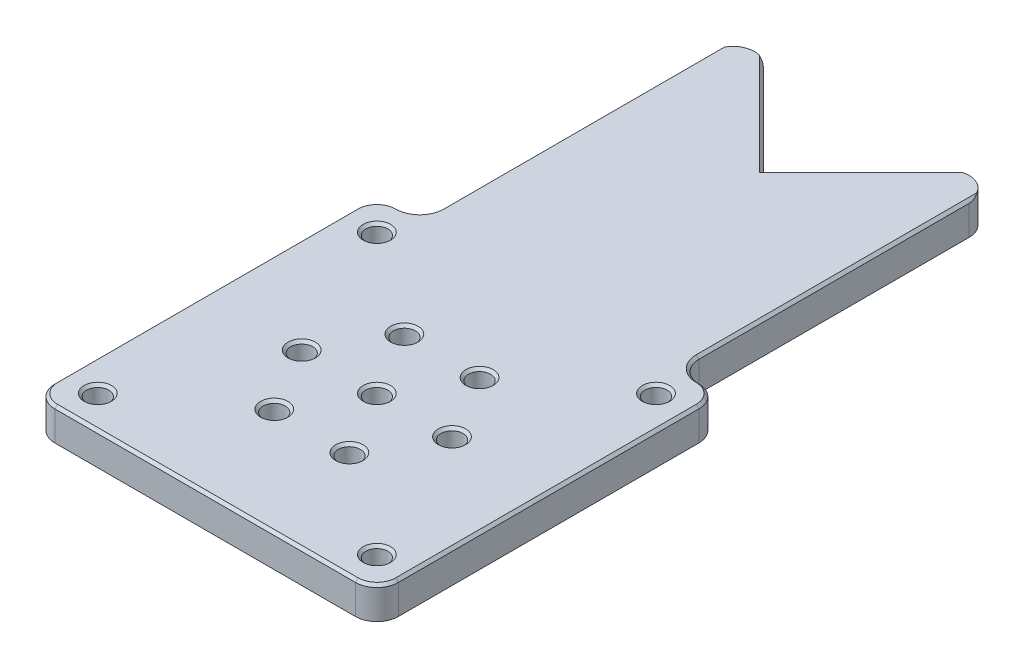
ISO-10303-21;
HEADER;
FILE_DESCRIPTION(('STEP AP214'),'2;1');
FILE_NAME('part.step','',(''),(''),'','','');
FILE_SCHEMA(('AUTOMOTIVE_DESIGN { 1 0 10303 214 1 1 1 1 }'));
ENDSEC;
DATA;
#1=APPLICATION_CONTEXT('core data for automotive mechanical design processes');
#2=APPLICATION_PROTOCOL_DEFINITION('international standard','automotive_design',2000,#1);
#3=PRODUCT_CONTEXT('',#1,'mechanical');
#4=PRODUCT('Part','Part','',(#3));
#5=PRODUCT_RELATED_PRODUCT_CATEGORY('part','',(#4));
#6=PRODUCT_DEFINITION_FORMATION('','',#4);
#7=PRODUCT_DEFINITION_CONTEXT('part definition',#1,'design');
#8=PRODUCT_DEFINITION('design','',#6,#7);
#9=PRODUCT_DEFINITION_SHAPE('','',#8);
#10=(LENGTH_UNIT() NAMED_UNIT(*) SI_UNIT(.MILLI.,.METRE.));
#11=(NAMED_UNIT(*) PLANE_ANGLE_UNIT() SI_UNIT($,.RADIAN.));
#12=(NAMED_UNIT(*) SI_UNIT($,.STERADIAN.) SOLID_ANGLE_UNIT());
#13=UNCERTAINTY_MEASURE_WITH_UNIT(LENGTH_MEASURE(1.E-05),#10,'distance_accuracy_value','');
#14=(GEOMETRIC_REPRESENTATION_CONTEXT(3) GLOBAL_UNCERTAINTY_ASSIGNED_CONTEXT((#13)) GLOBAL_UNIT_ASSIGNED_CONTEXT((#10,
#11,#12)) REPRESENTATION_CONTEXT('',''));
#15=CARTESIAN_POINT('',(0.,0.,0.));
#16=DIRECTION('',(0.,0.,1.));
#17=DIRECTION('',(1.,0.,0.));
#18=AXIS2_PLACEMENT_3D('',#15,#16,#17);
#19=CARTESIAN_POINT('',(0.,19.05,-406.4));
#20=DIRECTION('',(0.,1.,0.));
#21=DIRECTION('',(0.,0.,1.));
#22=AXIS2_PLACEMENT_3D('',#19,#20,#21);
#23=PLANE('',#22);
#24=DIRECTION('',(-0.707106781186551,0.,-0.707106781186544));
#25=VECTOR('',#24,1.);
#26=CARTESIAN_POINT('',(11.5864482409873,19.05,-417.986448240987));
#27=LINE('',#26,#25);
#28=CARTESIAN_POINT('',(101.6,19.05,-327.972896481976));
#29=VERTEX_POINT('',#28);
#30=CARTESIAN_POINT('',(41.6354271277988,19.05,-387.937469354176));
#31=VERTEX_POINT('',#30);
#32=EDGE_CURVE('E333',#29,#31,#27,.T.);
#33=ORIENTED_EDGE('',*,*,#32,.T.);
#34=CARTESIAN_POINT('',(38.1,19.05,-375.739487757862));
#35=DIRECTION('',(0.,1.,0.));
#36=DIRECTION('',(0.,0.,1.));
#37=AXIS2_PLACEMENT_3D('',#34,#35,#36);
#38=CIRCLE('',#37,12.7);
#39=CARTESIAN_POINT('',(26.9748,19.05,-381.864838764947));
#40=VERTEX_POINT('',#39);
#41=EDGE_CURVE('E462',#31,#40,#38,.T.);
#42=ORIENTED_EDGE('',*,*,#41,.T.);
#43=DIRECTION('',(0.,0.,1.));
#44=VECTOR('',#43,1.);
#45=CARTESIAN_POINT('',(26.9748,19.05,-215.9));
#46=LINE('',#45,#44);
#47=CARTESIAN_POINT('',(26.9748,19.05,-215.9));
#48=VERTEX_POINT('',#47);
#49=EDGE_CURVE('E336',#40,#48,#46,.T.);
#50=ORIENTED_EDGE('',*,*,#49,.T.);
#51=CARTESIAN_POINT('',(12.7,19.05,-215.9));
#52=DIRECTION('',(0.,1.,0.));
#53=DIRECTION('',(0.,0.,1.));
#54=AXIS2_PLACEMENT_3D('',#51,#52,#53);
#55=CIRCLE('',#54,14.2748);
#56=CARTESIAN_POINT('',(12.7,19.05,-201.6252));
#57=VERTEX_POINT('',#56);
#58=EDGE_CURVE('E338',#48,#57,#55,.F.);
#59=ORIENTED_EDGE('',*,*,#58,.T.);
#60=CARTESIAN_POINT('',(12.7,19.05,-190.5));
#61=DIRECTION('',(0.,1.,0.));
#62=DIRECTION('',(0.,0.,1.));
#63=AXIS2_PLACEMENT_3D('',#60,#61,#62);
#64=CIRCLE('',#63,11.1252);
#65=CARTESIAN_POINT('',(1.57479999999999,19.05,-190.5));
#66=VERTEX_POINT('',#65);
#67=EDGE_CURVE('E340',#57,#66,#64,.T.);
#68=ORIENTED_EDGE('',*,*,#67,.T.);
#69=DIRECTION('',(0.,0.,1.));
#70=VECTOR('',#69,1.);
#71=CARTESIAN_POINT('',(1.57479999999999,19.05,-406.4));
#72=LINE('',#71,#70);
#73=CARTESIAN_POINT('',(1.57479999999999,19.05,-12.7));
#74=VERTEX_POINT('',#73);
#75=EDGE_CURVE('E342',#66,#74,#72,.T.);
#76=ORIENTED_EDGE('',*,*,#75,.T.);
#77=CARTESIAN_POINT('',(12.7,19.05,-12.7));
#78=DIRECTION('',(0.,1.,0.));
#79=DIRECTION('',(0.,0.,1.));
#80=AXIS2_PLACEMENT_3D('',#77,#78,#79);
#81=CIRCLE('',#80,11.1252);
#82=CARTESIAN_POINT('',(12.7,19.05,-1.57479999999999));
#83=VERTEX_POINT('',#82);
#84=EDGE_CURVE('E344',#74,#83,#81,.T.);
#85=ORIENTED_EDGE('',*,*,#84,.T.);
#86=DIRECTION('',(1.,0.,0.));
#87=VECTOR('',#86,1.);
#88=CARTESIAN_POINT('',(190.5,19.05,-1.57479999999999));
#89=LINE('',#88,#87);
#90=CARTESIAN_POINT('',(190.5,19.05,-1.57479999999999));
#91=VERTEX_POINT('',#90);
#92=EDGE_CURVE('E346',#83,#91,#89,.T.);
#93=ORIENTED_EDGE('',*,*,#92,.T.);
#94=CARTESIAN_POINT('',(190.5,19.05,-12.7));
#95=DIRECTION('',(0.,1.,0.));
#96=DIRECTION('',(0.,0.,1.));
#97=AXIS2_PLACEMENT_3D('',#94,#95,#96);
#98=CIRCLE('',#97,11.1252);
#99=CARTESIAN_POINT('',(201.6252,19.05,-12.7));
#100=VERTEX_POINT('',#99);
#101=EDGE_CURVE('E348',#91,#100,#98,.T.);
#102=ORIENTED_EDGE('',*,*,#101,.T.);
#103=DIRECTION('',(0.,0.,-1.));
#104=VECTOR('',#103,1.);
#105=CARTESIAN_POINT('',(201.6252,19.05,-406.4));
#106=LINE('',#105,#104);
#107=CARTESIAN_POINT('',(201.6252,19.05,-190.5));
#108=VERTEX_POINT('',#107);
#109=EDGE_CURVE('E350',#100,#108,#106,.T.);
#110=ORIENTED_EDGE('',*,*,#109,.T.);
#111=CARTESIAN_POINT('',(190.5,19.05,-190.5));
#112=DIRECTION('',(0.,1.,0.));
#113=DIRECTION('',(0.,0.,1.));
#114=AXIS2_PLACEMENT_3D('',#111,#112,#113);
#115=CIRCLE('',#114,11.1252);
#116=CARTESIAN_POINT('',(190.5,19.05,-201.6252));
#117=VERTEX_POINT('',#116);
#118=EDGE_CURVE('E352',#108,#117,#115,.T.);
#119=ORIENTED_EDGE('',*,*,#118,.T.);
#120=CARTESIAN_POINT('',(190.5,19.05,-215.9));
#121=DIRECTION('',(0.,1.,0.));
#122=DIRECTION('',(0.,0.,1.));
#123=AXIS2_PLACEMENT_3D('',#120,#121,#122);
#124=CIRCLE('',#123,14.2748);
#125=CARTESIAN_POINT('',(176.2252,19.05,-215.9));
#126=VERTEX_POINT('',#125);
#127=EDGE_CURVE('E354',#117,#126,#124,.F.);
#128=ORIENTED_EDGE('',*,*,#127,.T.);
#129=DIRECTION('',(0.,0.,-1.));
#130=VECTOR('',#129,1.);
#131=CARTESIAN_POINT('',(176.2252,19.05,-406.4));
#132=LINE('',#131,#130);
#133=CARTESIAN_POINT('',(176.2252,19.05,-381.864838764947));
#134=VERTEX_POINT('',#133);
#135=EDGE_CURVE('E356',#126,#134,#132,.T.);
#136=ORIENTED_EDGE('',*,*,#135,.T.);
#137=CARTESIAN_POINT('',(165.1,19.05,-375.739487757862));
#138=DIRECTION('',(0.,1.,0.));
#139=DIRECTION('',(0.,0.,1.));
#140=AXIS2_PLACEMENT_3D('',#137,#138,#139);
#141=CIRCLE('',#140,12.7);
#142=CARTESIAN_POINT('',(161.564572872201,19.05,-387.937469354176));
#143=VERTEX_POINT('',#142);
#144=EDGE_CURVE('E460',#134,#143,#141,.T.);
#145=ORIENTED_EDGE('',*,*,#144,.T.);
#146=DIRECTION('',(-0.707106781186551,0.,0.707106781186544));
#147=VECTOR('',#146,1.);
#148=CARTESIAN_POINT('',(90.0135517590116,19.05,-316.386448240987));
#149=LINE('',#148,#147);
#150=EDGE_CURVE('E331',#143,#29,#149,.T.);
#151=ORIENTED_EDGE('',*,*,#150,.T.);
#152=EDGE_LOOP('',(#33,#42,#50,#59,#68,#76,#85,#93,#102,#110,#119,#128,#136,#145,#151));
#153=FACE_BOUND('',#152,.T.);
#154=CARTESIAN_POINT('',(123.825,19.05,-63.105170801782));
#155=DIRECTION('',(0.,1.,0.));
#156=DIRECTION('',(0.,0.,1.));
#157=AXIS2_PLACEMENT_3D('',#154,#155,#156);
#158=CIRCLE('',#157,8.11530000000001);
#159=CARTESIAN_POINT('',(123.825,19.05,-54.989870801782));
#160=VERTEX_POINT('',#159);
#161=EDGE_CURVE('E328',#160,#160,#158,.F.);
#162=ORIENTED_EDGE('',*,*,#161,.T.);
#163=EDGE_LOOP('',(#162));
#164=FACE_BOUND('',#163,.T.);
#165=CARTESIAN_POINT('',(79.3750000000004,19.05,-63.1051708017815));
#166=DIRECTION('',(0.,1.,0.));
#167=DIRECTION('',(0.,0.,1.));
#168=AXIS2_PLACEMENT_3D('',#165,#166,#167);
#169=CIRCLE('',#168,8.11530000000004);
#170=CARTESIAN_POINT('',(79.3750000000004,19.05,-54.9898708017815));
#171=VERTEX_POINT('',#170);
#172=EDGE_CURVE('E325',#171,#171,#169,.F.);
#173=ORIENTED_EDGE('',*,*,#172,.T.);
#174=EDGE_LOOP('',(#173));
#175=FACE_BOUND('',#174,.T.);
#176=CARTESIAN_POINT('',(57.15,19.05,-101.6));
#177=DIRECTION('',(0.,1.,0.));
#178=DIRECTION('',(0.,0.,1.));
#179=AXIS2_PLACEMENT_3D('',#176,#177,#178);
#180=CIRCLE('',#179,8.11530000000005);
#181=CARTESIAN_POINT('',(57.15,19.05,-93.4846999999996));
#182=VERTEX_POINT('',#181);
#183=EDGE_CURVE('E322',#182,#182,#180,.F.);
#184=ORIENTED_EDGE('',*,*,#183,.T.);
#185=EDGE_LOOP('',(#184));
#186=FACE_BOUND('',#185,.T.);
#187=CARTESIAN_POINT('',(79.3749999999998,19.05,-140.094829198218));
#188=DIRECTION('',(0.,1.,0.));
#189=DIRECTION('',(0.,0.,1.));
#190=AXIS2_PLACEMENT_3D('',#187,#188,#189);
#191=CIRCLE('',#190,8.11530000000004);
#192=CARTESIAN_POINT('',(79.3749999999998,19.05,-131.979529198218));
#193=VERTEX_POINT('',#192);
#194=EDGE_CURVE('E319',#193,#193,#191,.F.);
#195=ORIENTED_EDGE('',*,*,#194,.T.);
#196=EDGE_LOOP('',(#195));
#197=FACE_BOUND('',#196,.T.);
#198=CARTESIAN_POINT('',(123.825,19.05,-140.094829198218));
#199=DIRECTION('',(0.,1.,0.));
#200=DIRECTION('',(0.,0.,1.));
#201=AXIS2_PLACEMENT_3D('',#198,#199,#200);
#202=CIRCLE('',#201,8.11530000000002);
#203=CARTESIAN_POINT('',(123.825,19.05,-131.979529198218));
#204=VERTEX_POINT('',#203);
#205=EDGE_CURVE('E316',#204,#204,#202,.F.);
#206=ORIENTED_EDGE('',*,*,#205,.T.);
#207=EDGE_LOOP('',(#206));
#208=FACE_BOUND('',#207,.T.);
#209=CARTESIAN_POINT('',(146.05,19.05,-101.6));
#210=DIRECTION('',(0.,1.,0.));
#211=DIRECTION('',(0.,0.,1.));
#212=AXIS2_PLACEMENT_3D('',#209,#210,#211);
#213=CIRCLE('',#212,8.11530000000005);
#214=CARTESIAN_POINT('',(146.05,19.05,-93.4847));
#215=VERTEX_POINT('',#214);
#216=EDGE_CURVE('E313',#215,#215,#213,.F.);
#217=ORIENTED_EDGE('',*,*,#216,.T.);
#218=EDGE_LOOP('',(#217));
#219=FACE_BOUND('',#218,.T.);
#220=CARTESIAN_POINT('',(101.6,19.05,-101.6));
#221=DIRECTION('',(0.,1.,0.));
#222=DIRECTION('',(0.,0.,1.));
#223=AXIS2_PLACEMENT_3D('',#220,#221,#222);
#224=CIRCLE('',#223,8.11530000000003);
#225=CARTESIAN_POINT('',(101.6,19.05,-93.4847));
#226=VERTEX_POINT('',#225);
#227=EDGE_CURVE('E310',#226,#226,#224,.F.);
#228=ORIENTED_EDGE('',*,*,#227,.T.);
#229=EDGE_LOOP('',(#228));
#230=FACE_BOUND('',#229,.T.);
#231=CARTESIAN_POINT('',(19.05,19.05,-19.05));
#232=DIRECTION('',(0.,1.,0.));
#233=DIRECTION('',(0.,0.,1.));
#234=AXIS2_PLACEMENT_3D('',#231,#232,#233);
#235=CIRCLE('',#234,8.11530000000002);
#236=CARTESIAN_POINT('',(19.05,19.05,-10.9347));
#237=VERTEX_POINT('',#236);
#238=EDGE_CURVE('E307',#237,#237,#235,.F.);
#239=ORIENTED_EDGE('',*,*,#238,.T.);
#240=EDGE_LOOP('',(#239));
#241=FACE_BOUND('',#240,.T.);
#242=CARTESIAN_POINT('',(184.15,19.05,-19.05));
#243=DIRECTION('',(0.,1.,0.));
#244=DIRECTION('',(0.,0.,1.));
#245=AXIS2_PLACEMENT_3D('',#242,#243,#244);
#246=CIRCLE('',#245,8.11530000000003);
#247=CARTESIAN_POINT('',(184.15,19.05,-10.9347));
#248=VERTEX_POINT('',#247);
#249=EDGE_CURVE('E304',#248,#248,#246,.F.);
#250=ORIENTED_EDGE('',*,*,#249,.T.);
#251=EDGE_LOOP('',(#250));
#252=FACE_BOUND('',#251,.T.);
#253=CARTESIAN_POINT('',(184.15,19.05,-184.15));
#254=DIRECTION('',(0.,1.,0.));
#255=DIRECTION('',(0.,0.,1.));
#256=AXIS2_PLACEMENT_3D('',#253,#254,#255);
#257=CIRCLE('',#256,8.11529999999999);
#258=CARTESIAN_POINT('',(184.15,19.05,-176.0347));
#259=VERTEX_POINT('',#258);
#260=EDGE_CURVE('E301',#259,#259,#257,.F.);
#261=ORIENTED_EDGE('',*,*,#260,.T.);
#262=EDGE_LOOP('',(#261));
#263=FACE_BOUND('',#262,.T.);
#264=CARTESIAN_POINT('',(19.05,19.05,-184.15));
#265=DIRECTION('',(0.,1.,0.));
#266=DIRECTION('',(0.,0.,1.));
#267=AXIS2_PLACEMENT_3D('',#264,#265,#266);
#268=CIRCLE('',#267,8.11529999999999);
#269=CARTESIAN_POINT('',(19.05,19.05,-176.0347));
#270=VERTEX_POINT('',#269);
#271=EDGE_CURVE('E296',#270,#270,#268,.F.);
#272=ORIENTED_EDGE('',*,*,#271,.T.);
#273=EDGE_LOOP('',(#272));
#274=FACE_BOUND('',#273,.T.);
#275=ADVANCED_FACE('F34',(#153,#164,#175,#186,#197,#208,#219,#230,#241,#252,#263,#274),#23,.T.);
#276=CARTESIAN_POINT('',(0.,0.,-406.4));
#277=DIRECTION('',(0.,-1.,0.));
#278=DIRECTION('',(0.,0.,-1.));
#279=AXIS2_PLACEMENT_3D('',#276,#277,#278);
#280=PLANE('',#279);
#281=CARTESIAN_POINT('',(19.05,0.,-184.15));
#282=DIRECTION('',(0.,1.,0.));
#283=DIRECTION('',(0.,0.,1.));
#284=AXIS2_PLACEMENT_3D('',#281,#282,#283);
#285=CIRCLE('',#284,6.5405);
#286=CARTESIAN_POINT('',(19.05,0.,-177.6095));
#287=VERTEX_POINT('',#286);
#288=EDGE_CURVE('E245',#287,#287,#285,.T.);
#289=ORIENTED_EDGE('',*,*,#288,.T.);
#290=EDGE_LOOP('',(#289));
#291=FACE_BOUND('',#290,.T.);
#292=CARTESIAN_POINT('',(184.15,0.,-184.15));
#293=DIRECTION('',(0.,1.,0.));
#294=DIRECTION('',(0.,0.,1.));
#295=AXIS2_PLACEMENT_3D('',#292,#293,#294);
#296=CIRCLE('',#295,6.54050000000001);
#297=CARTESIAN_POINT('',(184.15,0.,-177.6095));
#298=VERTEX_POINT('',#297);
#299=EDGE_CURVE('E242',#298,#298,#296,.T.);
#300=ORIENTED_EDGE('',*,*,#299,.T.);
#301=EDGE_LOOP('',(#300));
#302=FACE_BOUND('',#301,.T.);
#303=CARTESIAN_POINT('',(184.15,0.,-19.05));
#304=DIRECTION('',(0.,1.,0.));
#305=DIRECTION('',(0.,0.,1.));
#306=AXIS2_PLACEMENT_3D('',#303,#304,#305);
#307=CIRCLE('',#306,6.54050000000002);
#308=CARTESIAN_POINT('',(184.15,0.,-12.5095));
#309=VERTEX_POINT('',#308);
#310=EDGE_CURVE('E239',#309,#309,#307,.T.);
#311=ORIENTED_EDGE('',*,*,#310,.T.);
#312=EDGE_LOOP('',(#311));
#313=FACE_BOUND('',#312,.T.);
#314=CARTESIAN_POINT('',(19.05,0.,-19.05));
#315=DIRECTION('',(0.,1.,0.));
#316=DIRECTION('',(0.,0.,1.));
#317=AXIS2_PLACEMENT_3D('',#314,#315,#316);
#318=CIRCLE('',#317,6.5405);
#319=CARTESIAN_POINT('',(19.05,0.,-12.5095));
#320=VERTEX_POINT('',#319);
#321=EDGE_CURVE('E236',#320,#320,#318,.T.);
#322=ORIENTED_EDGE('',*,*,#321,.T.);
#323=EDGE_LOOP('',(#322));
#324=FACE_BOUND('',#323,.T.);
#325=CARTESIAN_POINT('',(101.6,0.,-101.6));
#326=DIRECTION('',(0.,1.,0.));
#327=DIRECTION('',(0.,0.,1.));
#328=AXIS2_PLACEMENT_3D('',#325,#326,#327);
#329=CIRCLE('',#328,6.54050000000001);
#330=CARTESIAN_POINT('',(101.6,0.,-95.0595));
#331=VERTEX_POINT('',#330);
#332=EDGE_CURVE('E233',#331,#331,#329,.T.);
#333=ORIENTED_EDGE('',*,*,#332,.T.);
#334=EDGE_LOOP('',(#333));
#335=FACE_BOUND('',#334,.T.);
#336=CARTESIAN_POINT('',(146.05,0.,-101.6));
#337=DIRECTION('',(0.,1.,0.));
#338=DIRECTION('',(0.,0.,1.));
#339=AXIS2_PLACEMENT_3D('',#336,#337,#338);
#340=CIRCLE('',#339,6.54050000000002);
#341=CARTESIAN_POINT('',(146.05,0.,-95.0595));
#342=VERTEX_POINT('',#341);
#343=EDGE_CURVE('E230',#342,#342,#340,.T.);
#344=ORIENTED_EDGE('',*,*,#343,.T.);
#345=EDGE_LOOP('',(#344));
#346=FACE_BOUND('',#345,.T.);
#347=CARTESIAN_POINT('',(123.825,0.,-140.094829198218));
#348=DIRECTION('',(0.,1.,0.));
#349=DIRECTION('',(0.86602540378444,0.,0.499999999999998));
#350=AXIS2_PLACEMENT_3D('',#347,#348,#349);
#351=CIRCLE('',#350,6.54050000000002);
#352=CARTESIAN_POINT('',(123.825,0.,-133.554329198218));
#353=VERTEX_POINT('',#352);
#354=EDGE_CURVE('E227',#353,#353,#351,.T.);
#355=ORIENTED_EDGE('',*,*,#354,.T.);
#356=EDGE_LOOP('',(#355));
#357=FACE_BOUND('',#356,.T.);
#358=CARTESIAN_POINT('',(79.3749999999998,0.,-140.094829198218));
#359=DIRECTION('',(0.,1.,0.));
#360=DIRECTION('',(0.866025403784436,0.,-0.500000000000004));
#361=AXIS2_PLACEMENT_3D('',#358,#359,#360);
#362=CIRCLE('',#361,6.54050000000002);
#363=CARTESIAN_POINT('',(79.3749999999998,0.,-133.554329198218));
#364=VERTEX_POINT('',#363);
#365=EDGE_CURVE('E224',#364,#364,#362,.T.);
#366=ORIENTED_EDGE('',*,*,#365,.T.);
#367=EDGE_LOOP('',(#366));
#368=FACE_BOUND('',#367,.T.);
#369=CARTESIAN_POINT('',(57.15,0.,-101.6));
#370=DIRECTION('',(0.,1.,0.));
#371=DIRECTION('',(0.,0.,-1.));
#372=AXIS2_PLACEMENT_3D('',#369,#370,#371);
#373=CIRCLE('',#372,6.54050000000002);
#374=CARTESIAN_POINT('',(57.15,0.,-95.0594999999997));
#375=VERTEX_POINT('',#374);
#376=EDGE_CURVE('E221',#375,#375,#373,.T.);
#377=ORIENTED_EDGE('',*,*,#376,.T.);
#378=EDGE_LOOP('',(#377));
#379=FACE_BOUND('',#378,.T.);
#380=CARTESIAN_POINT('',(79.3750000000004,0.,-63.1051708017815));
#381=DIRECTION('',(0.,1.,0.));
#382=DIRECTION('',(-0.866025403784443,0.,-0.499999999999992));
#383=AXIS2_PLACEMENT_3D('',#380,#381,#382);
#384=CIRCLE('',#383,6.54050000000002);
#385=CARTESIAN_POINT('',(79.3750000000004,0.,-56.5646708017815));
#386=VERTEX_POINT('',#385);
#387=EDGE_CURVE('E218',#386,#386,#384,.T.);
#388=ORIENTED_EDGE('',*,*,#387,.T.);
#389=EDGE_LOOP('',(#388));
#390=FACE_BOUND('',#389,.T.);
#391=CARTESIAN_POINT('',(123.825,0.,-63.105170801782));
#392=DIRECTION('',(0.,1.,0.));
#393=DIRECTION('',(-0.866025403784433,0.,0.50000000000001));
#394=AXIS2_PLACEMENT_3D('',#391,#392,#393);
#395=CIRCLE('',#394,6.54050000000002);
#396=CARTESIAN_POINT('',(123.825,0.,-56.564670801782));
#397=VERTEX_POINT('',#396);
#398=EDGE_CURVE('E215',#397,#397,#395,.T.);
#399=ORIENTED_EDGE('',*,*,#398,.T.);
#400=EDGE_LOOP('',(#399));
#401=FACE_BOUND('',#400,.T.);
#402=DIRECTION('',(0.,0.,1.));
#403=VECTOR('',#402,1.);
#404=CARTESIAN_POINT('',(25.4,0.,-406.4));
#405=LINE('',#404,#403);
#406=CARTESIAN_POINT('',(25.4,0.,-375.739487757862));
#407=VERTEX_POINT('',#406);
#408=CARTESIAN_POINT('',(25.4,0.,-215.9));
#409=VERTEX_POINT('',#408);
#410=EDGE_CURVE('E248',#407,#409,#405,.T.);
#411=ORIENTED_EDGE('',*,*,#410,.F.);
#412=CARTESIAN_POINT('',(38.1,0.,-375.739487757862));
#413=DIRECTION('',(0.,-1.,0.));
#414=DIRECTION('',(0.,0.,-1.));
#415=AXIS2_PLACEMENT_3D('',#412,#413,#414);
#416=CIRCLE('',#415,12.7);
#417=CARTESIAN_POINT('',(47.0802561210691,0.,-384.719743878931));
#418=VERTEX_POINT('',#417);
#419=EDGE_CURVE('E193',#407,#418,#416,.T.);
#420=ORIENTED_EDGE('',*,*,#419,.T.);
#421=DIRECTION('',(0.707106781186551,0.,0.707106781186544));
#422=VECTOR('',#421,1.);
#423=CARTESIAN_POINT('',(12.6999999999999,0.,-419.1));
#424=LINE('',#423,#422);
#425=CARTESIAN_POINT('',(101.6,2.22044604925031E-13,-330.200000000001));
#426=VERTEX_POINT('',#425);
#427=EDGE_CURVE('E187',#418,#426,#424,.T.);
#428=ORIENTED_EDGE('',*,*,#427,.T.);
#429=DIRECTION('',(0.707106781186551,0.,-0.707106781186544));
#430=VECTOR('',#429,1.);
#431=CARTESIAN_POINT('',(88.8999999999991,0.,-317.5));
#432=LINE('',#431,#430);
#433=CARTESIAN_POINT('',(156.119743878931,0.,-384.719743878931));
#434=VERTEX_POINT('',#433);
#435=EDGE_CURVE('E192',#426,#434,#432,.T.);
#436=ORIENTED_EDGE('',*,*,#435,.T.);
#437=CARTESIAN_POINT('',(165.1,0.,-375.739487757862));
#438=DIRECTION('',(0.,-1.,0.));
#439=DIRECTION('',(0.,0.,-1.));
#440=AXIS2_PLACEMENT_3D('',#437,#438,#439);
#441=CIRCLE('',#440,12.7);
#442=CARTESIAN_POINT('',(177.8,0.,-375.739487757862));
#443=VERTEX_POINT('',#442);
#444=EDGE_CURVE('E453',#434,#443,#441,.T.);
#445=ORIENTED_EDGE('',*,*,#444,.T.);
#446=DIRECTION('',(0.,0.,1.));
#447=VECTOR('',#446,1.);
#448=CARTESIAN_POINT('',(177.8,0.,-406.4));
#449=LINE('',#448,#447);
#450=CARTESIAN_POINT('',(177.8,0.,-215.9));
#451=VERTEX_POINT('',#450);
#452=EDGE_CURVE('E250',#443,#451,#449,.T.);
#453=ORIENTED_EDGE('',*,*,#452,.T.);
#454=CARTESIAN_POINT('',(190.5,0.,-215.9));
#455=DIRECTION('',(0.,-1.,0.));
#456=DIRECTION('',(0.,0.,-1.));
#457=AXIS2_PLACEMENT_3D('',#454,#455,#456);
#458=CIRCLE('',#457,12.7);
#459=CARTESIAN_POINT('',(190.5,0.,-203.2));
#460=VERTEX_POINT('',#459);
#461=EDGE_CURVE('E294',#451,#460,#458,.F.);
#462=ORIENTED_EDGE('',*,*,#461,.T.);
#463=CARTESIAN_POINT('',(190.5,0.,-190.5));
#464=DIRECTION('',(0.,-1.,0.));
#465=DIRECTION('',(0.,0.,-1.));
#466=AXIS2_PLACEMENT_3D('',#463,#464,#465);
#467=CIRCLE('',#466,12.7);
#468=CARTESIAN_POINT('',(203.2,0.,-190.5));
#469=VERTEX_POINT('',#468);
#470=EDGE_CURVE('E274',#460,#469,#467,.T.);
#471=ORIENTED_EDGE('',*,*,#470,.T.);
#472=DIRECTION('',(0.,0.,1.));
#473=VECTOR('',#472,1.);
#474=CARTESIAN_POINT('',(203.2,0.,-406.4));
#475=LINE('',#474,#473);
#476=CARTESIAN_POINT('',(203.2,0.,-12.7));
#477=VERTEX_POINT('',#476);
#478=EDGE_CURVE('E256',#469,#477,#475,.T.);
#479=ORIENTED_EDGE('',*,*,#478,.T.);
#480=CARTESIAN_POINT('',(190.5,0.,-12.7));
#481=DIRECTION('',(0.,-1.,0.));
#482=DIRECTION('',(0.,0.,-1.));
#483=AXIS2_PLACEMENT_3D('',#480,#481,#482);
#484=CIRCLE('',#483,12.7);
#485=CARTESIAN_POINT('',(190.5,0.,0.));
#486=VERTEX_POINT('',#485);
#487=EDGE_CURVE('E278',#477,#486,#484,.T.);
#488=ORIENTED_EDGE('',*,*,#487,.T.);
#489=DIRECTION('',(1.,0.,0.));
#490=VECTOR('',#489,1.);
#491=CARTESIAN_POINT('',(0.,0.,0.));
#492=LINE('',#491,#490);
#493=CARTESIAN_POINT('',(12.7,0.,0.));
#494=VERTEX_POINT('',#493);
#495=EDGE_CURVE('E252',#494,#486,#492,.T.);
#496=ORIENTED_EDGE('',*,*,#495,.F.);
#497=CARTESIAN_POINT('',(12.7,0.,-12.7));
#498=DIRECTION('',(0.,-1.,0.));
#499=DIRECTION('',(0.,0.,-1.));
#500=AXIS2_PLACEMENT_3D('',#497,#498,#499);
#501=CIRCLE('',#500,12.7);
#502=CARTESIAN_POINT('',(0.,0.,-12.7));
#503=VERTEX_POINT('',#502);
#504=EDGE_CURVE('E276',#494,#503,#501,.T.);
#505=ORIENTED_EDGE('',*,*,#504,.T.);
#506=DIRECTION('',(0.,0.,1.));
#507=VECTOR('',#506,1.);
#508=CARTESIAN_POINT('',(0.,0.,-406.4));
#509=LINE('',#508,#507);
#510=CARTESIAN_POINT('',(0.,0.,-190.5));
#511=VERTEX_POINT('',#510);
#512=EDGE_CURVE('E255',#511,#503,#509,.T.);
#513=ORIENTED_EDGE('',*,*,#512,.F.);
#514=CARTESIAN_POINT('',(12.7,0.,-190.5));
#515=DIRECTION('',(0.,-1.,0.));
#516=DIRECTION('',(0.,0.,-1.));
#517=AXIS2_PLACEMENT_3D('',#514,#515,#516);
#518=CIRCLE('',#517,12.7);
#519=CARTESIAN_POINT('',(12.7,0.,-203.2));
#520=VERTEX_POINT('',#519);
#521=EDGE_CURVE('E271',#511,#520,#518,.T.);
#522=ORIENTED_EDGE('',*,*,#521,.T.);
#523=CARTESIAN_POINT('',(12.7,0.,-215.9));
#524=DIRECTION('',(0.,-1.,0.));
#525=DIRECTION('',(0.,0.,-1.));
#526=AXIS2_PLACEMENT_3D('',#523,#524,#525);
#527=CIRCLE('',#526,12.7);
#528=EDGE_CURVE('E291',#520,#409,#527,.F.);
#529=ORIENTED_EDGE('',*,*,#528,.T.);
#530=EDGE_LOOP('',(#411,#420,#428,#436,#445,#453,#462,#471,#479,#488,#496,#505,#513,#522,#529));
#531=FACE_BOUND('',#530,.T.);
#532=ADVANCED_FACE('F190',(#291,#302,#313,#324,#335,#346,#357,#368,#379,#390,#401,#531),#280,.T.);
#533=CARTESIAN_POINT('',(203.2,0.,-406.4));
#534=DIRECTION('',(1.,0.,0.));
#535=DIRECTION('',(0.,0.,-1.));
#536=AXIS2_PLACEMENT_3D('',#533,#534,#535);
#537=PLANE('',#536);
#538=DIRECTION('',(0.,1.,0.));
#539=VECTOR('',#538,1.);
#540=CARTESIAN_POINT('',(203.2,0.,-190.5));
#541=LINE('',#540,#539);
#542=CARTESIAN_POINT('',(203.2,17.4752,-190.5));
#543=VERTEX_POINT('',#542);
#544=EDGE_CURVE('E266',#469,#543,#541,.T.);
#545=ORIENTED_EDGE('',*,*,#544,.T.);
#546=DIRECTION('',(0.,0.,1.));
#547=VECTOR('',#546,1.);
#548=CARTESIAN_POINT('',(203.2,17.4752,-406.4));
#549=LINE('',#548,#547);
#550=CARTESIAN_POINT('',(203.2,17.4752,-12.7));
#551=VERTEX_POINT('',#550);
#552=EDGE_CURVE('E365',#543,#551,#549,.T.);
#553=ORIENTED_EDGE('',*,*,#552,.T.);
#554=DIRECTION('',(0.,1.,0.));
#555=VECTOR('',#554,1.);
#556=CARTESIAN_POINT('',(203.2,0.,-12.7));
#557=LINE('',#556,#555);
#558=EDGE_CURVE('E269',#551,#477,#557,.F.);
#559=ORIENTED_EDGE('',*,*,#558,.T.);
#560=ORIENTED_EDGE('',*,*,#478,.F.);
#561=EDGE_LOOP('',(#545,#553,#559,#560));
#562=FACE_BOUND('',#561,.T.);
#563=ADVANCED_FACE('F489',(#562),#537,.T.);
#564=CARTESIAN_POINT('',(0.,0.,-406.4));
#565=DIRECTION('',(-1.,0.,0.));
#566=DIRECTION('',(0.,0.,1.));
#567=AXIS2_PLACEMENT_3D('',#564,#565,#566);
#568=PLANE('',#567);
#569=DIRECTION('',(0.,-1.,0.));
#570=VECTOR('',#569,1.);
#571=CARTESIAN_POINT('',(0.,19.05,-12.7));
#572=LINE('',#571,#570);
#573=CARTESIAN_POINT('',(0.,17.4752,-12.7));
#574=VERTEX_POINT('',#573);
#575=EDGE_CURVE('E282',#503,#574,#572,.F.);
#576=ORIENTED_EDGE('',*,*,#575,.T.);
#577=DIRECTION('',(0.,0.,-1.));
#578=VECTOR('',#577,1.);
#579=CARTESIAN_POINT('',(0.,17.4752,-406.4));
#580=LINE('',#579,#578);
#581=CARTESIAN_POINT('',(0.,17.4752,-190.5));
#582=VERTEX_POINT('',#581);
#583=EDGE_CURVE('E373',#574,#582,#580,.T.);
#584=ORIENTED_EDGE('',*,*,#583,.T.);
#585=DIRECTION('',(0.,1.,0.));
#586=VECTOR('',#585,1.);
#587=CARTESIAN_POINT('',(0.,0.,-190.5));
#588=LINE('',#587,#586);
#589=EDGE_CURVE('E280',#582,#511,#588,.F.);
#590=ORIENTED_EDGE('',*,*,#589,.T.);
#591=ORIENTED_EDGE('',*,*,#512,.T.);
#592=EDGE_LOOP('',(#576,#584,#590,#591));
#593=FACE_BOUND('',#592,.T.);
#594=ADVANCED_FACE('F525',(#593),#568,.T.);
#595=CARTESIAN_POINT('',(0.,19.05,0.));
#596=DIRECTION('',(0.,0.,-1.));
#597=DIRECTION('',(-1.,0.,0.));
#598=AXIS2_PLACEMENT_3D('',#595,#596,#597);
#599=PLANE('',#598);
#600=DIRECTION('',(0.,1.,0.));
#601=VECTOR('',#600,1.);
#602=CARTESIAN_POINT('',(190.5,19.05,0.));
#603=LINE('',#602,#601);
#604=CARTESIAN_POINT('',(190.5,17.4752,0.));
#605=VERTEX_POINT('',#604);
#606=EDGE_CURVE('E263',#486,#605,#603,.T.);
#607=ORIENTED_EDGE('',*,*,#606,.T.);
#608=DIRECTION('',(-1.,0.,0.));
#609=VECTOR('',#608,1.);
#610=CARTESIAN_POINT('',(12.7,17.4752,0.));
#611=LINE('',#610,#609);
#612=CARTESIAN_POINT('',(12.7,17.4752,0.));
#613=VERTEX_POINT('',#612);
#614=EDGE_CURVE('E369',#605,#613,#611,.T.);
#615=ORIENTED_EDGE('',*,*,#614,.T.);
#616=DIRECTION('',(0.,-1.,0.));
#617=VECTOR('',#616,1.);
#618=CARTESIAN_POINT('',(12.7,0.,0.));
#619=LINE('',#618,#617);
#620=EDGE_CURVE('E259',#613,#494,#619,.T.);
#621=ORIENTED_EDGE('',*,*,#620,.T.);
#622=ORIENTED_EDGE('',*,*,#495,.T.);
#623=EDGE_LOOP('',(#607,#615,#621,#622));
#624=FACE_BOUND('',#623,.T.);
#625=ADVANCED_FACE('F522',(#624),#599,.F.);
#626=CARTESIAN_POINT('',(177.8,587.510231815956,-406.4));
#627=DIRECTION('',(1.,0.,0.));
#628=DIRECTION('',(0.,0.,-1.));
#629=AXIS2_PLACEMENT_3D('',#626,#627,#628);
#630=PLANE('',#629);
#631=ORIENTED_EDGE('',*,*,#452,.F.);
#632=DIRECTION('',(0.,-1.,0.));
#633=VECTOR('',#632,1.);
#634=CARTESIAN_POINT('',(177.8,587.510231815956,-375.739487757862));
#635=LINE('',#634,#633);
#636=CARTESIAN_POINT('',(177.8,17.4752,-375.739487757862));
#637=VERTEX_POINT('',#636);
#638=EDGE_CURVE('E49',#443,#637,#635,.F.);
#639=ORIENTED_EDGE('',*,*,#638,.T.);
#640=DIRECTION('',(0.,0.,1.));
#641=VECTOR('',#640,1.);
#642=CARTESIAN_POINT('',(177.8,17.4752,-406.4));
#643=LINE('',#642,#641);
#644=CARTESIAN_POINT('',(177.8,17.4752,-215.9));
#645=VERTEX_POINT('',#644);
#646=EDGE_CURVE('E359',#637,#645,#643,.T.);
#647=ORIENTED_EDGE('',*,*,#646,.T.);
#648=DIRECTION('',(0.,-1.,0.));
#649=VECTOR('',#648,1.);
#650=CARTESIAN_POINT('',(177.8,2.22044604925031E-13,-215.9));
#651=LINE('',#650,#649);
#652=EDGE_CURVE('E288',#645,#451,#651,.T.);
#653=ORIENTED_EDGE('',*,*,#652,.T.);
#654=EDGE_LOOP('',(#631,#639,#647,#653));
#655=FACE_BOUND('',#654,.T.);
#656=ADVANCED_FACE('F477',(#655),#630,.T.);
#657=CARTESIAN_POINT('',(25.4,587.510231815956,-406.4));
#658=DIRECTION('',(1.,0.,0.));
#659=DIRECTION('',(0.,0.,-1.));
#660=AXIS2_PLACEMENT_3D('',#657,#658,#659);
#661=PLANE('',#660);
#662=DIRECTION('',(0.,0.,-1.));
#663=VECTOR('',#662,1.);
#664=CARTESIAN_POINT('',(25.4,17.4752,-406.4));
#665=LINE('',#664,#663);
#666=CARTESIAN_POINT('',(25.4,17.4752,-215.9));
#667=VERTEX_POINT('',#666);
#668=CARTESIAN_POINT('',(25.4,17.4752,-375.739487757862));
#669=VERTEX_POINT('',#668);
#670=EDGE_CURVE('E379',#667,#669,#665,.T.);
#671=ORIENTED_EDGE('',*,*,#670,.T.);
#672=DIRECTION('',(0.,-1.,0.));
#673=VECTOR('',#672,1.);
#674=CARTESIAN_POINT('',(25.4,0.,-375.739487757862));
#675=LINE('',#674,#673);
#676=EDGE_CURVE('E418',#669,#407,#675,.T.);
#677=ORIENTED_EDGE('',*,*,#676,.T.);
#678=ORIENTED_EDGE('',*,*,#410,.T.);
#679=DIRECTION('',(0.,-1.,0.));
#680=VECTOR('',#679,1.);
#681=CARTESIAN_POINT('',(25.4,19.05,-215.9));
#682=LINE('',#681,#680);
#683=EDGE_CURVE('E285',#409,#667,#682,.F.);
#684=ORIENTED_EDGE('',*,*,#683,.T.);
#685=EDGE_LOOP('',(#671,#677,#678,#684));
#686=FACE_BOUND('',#685,.T.);
#687=ADVANCED_FACE('F623',(#686),#661,.F.);
#688=CARTESIAN_POINT('',(19.05,0.,-184.15));
#689=DIRECTION('',(0.,1.,0.));
#690=DIRECTION('',(0.,0.,1.));
#691=AXIS2_PLACEMENT_3D('',#688,#689,#690);
#692=CYLINDRICAL_SURFACE('',#691,6.5405);
#693=CARTESIAN_POINT('',(19.05,17.4752,-184.15));
#694=DIRECTION('',(0.,1.,0.));
#695=DIRECTION('',(0.,0.,1.));
#696=AXIS2_PLACEMENT_3D('',#693,#694,#695);
#697=CIRCLE('',#696,6.5405);
#698=CARTESIAN_POINT('',(19.05,17.4752,-177.6095));
#699=VERTEX_POINT('',#698);
#700=EDGE_CURVE('E415',#699,#699,#697,.T.);
#701=CARTESIAN_POINT('',(19.05,17.4752,-177.6095));
#702=CARTESIAN_POINT('',(19.05,17.2931666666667,-177.6095));
#703=CARTESIAN_POINT('',(19.05,17.1111333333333,-177.6095));
#704=CARTESIAN_POINT('',(19.05,16.7470666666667,-177.6095));
#705=CARTESIAN_POINT('',(19.05,16.5650333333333,-177.6095));
#706=CARTESIAN_POINT('',(19.05,16.2009666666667,-177.6095));
#707=CARTESIAN_POINT('',(19.05,16.0189333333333,-177.6095));
#708=CARTESIAN_POINT('',(19.05,15.6548666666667,-177.6095));
#709=CARTESIAN_POINT('',(19.05,15.4728333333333,-177.6095));
#710=CARTESIAN_POINT('',(19.05,15.1087666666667,-177.6095));
#711=CARTESIAN_POINT('',(19.05,14.9267333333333,-177.6095));
#712=CARTESIAN_POINT('',(19.05,14.5626666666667,-177.6095));
#713=CARTESIAN_POINT('',(19.05,14.3806333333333,-177.6095));
#714=CARTESIAN_POINT('',(19.05,14.0165666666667,-177.6095));
#715=CARTESIAN_POINT('',(19.05,13.8345333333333,-177.6095));
#716=CARTESIAN_POINT('',(19.05,13.4704666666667,-177.6095));
#717=CARTESIAN_POINT('',(19.05,13.2884333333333,-177.6095));
#718=CARTESIAN_POINT('',(19.05,12.9243666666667,-177.6095));
#719=CARTESIAN_POINT('',(19.05,12.7423333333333,-177.6095));
#720=CARTESIAN_POINT('',(19.05,12.3782666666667,-177.6095));
#721=CARTESIAN_POINT('',(19.05,12.1962333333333,-177.6095));
#722=CARTESIAN_POINT('',(19.05,11.8321666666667,-177.6095));
#723=CARTESIAN_POINT('',(19.05,11.6501333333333,-177.6095));
#724=CARTESIAN_POINT('',(19.05,11.2860666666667,-177.6095));
#725=CARTESIAN_POINT('',(19.05,11.1040333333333,-177.6095));
#726=CARTESIAN_POINT('',(19.05,10.7399666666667,-177.6095));
#727=CARTESIAN_POINT('',(19.05,10.5579333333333,-177.6095));
#728=CARTESIAN_POINT('',(19.05,10.1938666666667,-177.6095));
#729=CARTESIAN_POINT('',(19.05,10.0118333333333,-177.6095));
#730=CARTESIAN_POINT('',(19.05,9.64776666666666,-177.6095));
#731=CARTESIAN_POINT('',(19.05,9.46573333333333,-177.6095));
#732=CARTESIAN_POINT('',(19.05,9.10166666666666,-177.6095));
#733=CARTESIAN_POINT('',(19.05,8.91963333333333,-177.6095));
#734=CARTESIAN_POINT('',(19.05,8.55556666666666,-177.6095));
#735=CARTESIAN_POINT('',(19.05,8.37353333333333,-177.6095));
#736=CARTESIAN_POINT('',(19.05,8.00946666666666,-177.6095));
#737=CARTESIAN_POINT('',(19.05,7.82743333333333,-177.6095));
#738=CARTESIAN_POINT('',(19.05,7.46336666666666,-177.6095));
#739=CARTESIAN_POINT('',(19.05,7.28133333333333,-177.6095));
#740=CARTESIAN_POINT('',(19.05,6.91726666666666,-177.6095));
#741=CARTESIAN_POINT('',(19.05,6.73523333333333,-177.6095));
#742=CARTESIAN_POINT('',(19.05,6.37116666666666,-177.6095));
#743=CARTESIAN_POINT('',(19.05,6.18913333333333,-177.6095));
#744=CARTESIAN_POINT('',(19.05,5.82506666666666,-177.6095));
#745=CARTESIAN_POINT('',(19.05,5.64303333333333,-177.6095));
#746=CARTESIAN_POINT('',(19.05,5.27896666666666,-177.6095));
#747=CARTESIAN_POINT('',(19.05,5.09693333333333,-177.6095));
#748=CARTESIAN_POINT('',(19.05,4.73286666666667,-177.6095));
#749=CARTESIAN_POINT('',(19.05,4.55083333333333,-177.6095));
#750=CARTESIAN_POINT('',(19.05,4.18676666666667,-177.6095));
#751=CARTESIAN_POINT('',(19.05,4.00473333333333,-177.6095));
#752=CARTESIAN_POINT('',(19.05,3.64066666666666,-177.6095));
#753=CARTESIAN_POINT('',(19.05,3.45863333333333,-177.6095));
#754=CARTESIAN_POINT('',(19.05,3.09456666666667,-177.6095));
#755=CARTESIAN_POINT('',(19.05,2.91253333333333,-177.6095));
#756=CARTESIAN_POINT('',(19.05,2.54846666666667,-177.6095));
#757=CARTESIAN_POINT('',(19.05,2.36643333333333,-177.6095));
#758=CARTESIAN_POINT('',(19.05,2.00236666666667,-177.6095));
#759=CARTESIAN_POINT('',(19.05,1.82033333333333,-177.6095));
#760=CARTESIAN_POINT('',(19.05,1.45626666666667,-177.6095));
#761=CARTESIAN_POINT('',(19.05,1.27423333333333,-177.6095));
#762=CARTESIAN_POINT('',(19.05,0.910166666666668,-177.6095));
#763=CARTESIAN_POINT('',(19.05,0.728133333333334,-177.6095));
#764=CARTESIAN_POINT('',(19.05,0.364066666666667,-177.6095));
#765=CARTESIAN_POINT('',(19.05,0.182033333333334,-177.6095));
#766=CARTESIAN_POINT('',(19.05,0.,-177.6095));
#767=B_SPLINE_CURVE_WITH_KNOTS('',3,(#701,#702,#703,#704,#705,#706,#707,#708,#709,#710,#711,
#712,#713,#714,#715,#716,#717,#718,#719,#720,#721,#722,#723,#724,#725,#726,#727,#728,#729,#730,
#731,#732,#733,#734,#735,#736,#737,#738,#739,#740,#741,#742,#743,#744,#745,#746,#747,#748,#749,
#750,#751,#752,#753,#754,#755,#756,#757,#758,#759,#760,#761,#762,#763,#764,#765,#766),
.UNSPECIFIED.,.F.,.F.,(4,2,2,2,2,2,2,2,2,2,2,2,2,2,2,2,2,2,2,2,2,2,2,2,2,2,2,2,2,2,2,2,4),(0.,
0.546100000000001,1.0922,1.6383,2.1844,2.7305,3.2766,3.8227,4.3688,4.9149,5.461,6.0071,6.5532,
7.0993,7.6454,8.1915,8.7376,9.2837,9.8298,10.3759,10.922,11.4681,12.0142,12.5603,13.1064,
13.6525,14.1986,14.7447,15.2908,15.8369,16.383,16.9291,17.4752),.UNSPECIFIED.);
#768=EDGE_CURVE('BSEAM674',#699,#287,#767,.T.);
#769=ORIENTED_EDGE('',*,*,#700,.T.);
#770=ORIENTED_EDGE('',*,*,#288,.F.);
#771=ORIENTED_EDGE('',*,*,#768,.T.);
#772=ORIENTED_EDGE('',*,*,#768,.F.);
#773=EDGE_LOOP('',(#769,#771,#770,#772));
#774=FACE_BOUND('',#773,.T.);
#775=ADVANCED_FACE('F674',(#774),#692,.F.);
#776=CARTESIAN_POINT('',(184.15,0.,-184.15));
#777=DIRECTION('',(0.,1.,0.));
#778=DIRECTION('',(0.,0.,1.));
#779=AXIS2_PLACEMENT_3D('',#776,#777,#778);
#780=CYLINDRICAL_SURFACE('',#779,6.54050000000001);
#781=CARTESIAN_POINT('',(184.15,17.4752,-184.15));
#782=DIRECTION('',(0.,1.,0.));
#783=DIRECTION('',(0.,0.,1.));
#784=AXIS2_PLACEMENT_3D('',#781,#782,#783);
#785=CIRCLE('',#784,6.54050000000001);
#786=CARTESIAN_POINT('',(184.15,17.4752,-177.6095));
#787=VERTEX_POINT('',#786);
#788=EDGE_CURVE('E412',#787,#787,#785,.T.);
#789=CARTESIAN_POINT('',(184.15,17.4752,-177.6095));
#790=CARTESIAN_POINT('',(184.15,17.2931666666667,-177.6095));
#791=CARTESIAN_POINT('',(184.15,17.1111333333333,-177.6095));
#792=CARTESIAN_POINT('',(184.15,16.7470666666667,-177.6095));
#793=CARTESIAN_POINT('',(184.15,16.5650333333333,-177.6095));
#794=CARTESIAN_POINT('',(184.15,16.2009666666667,-177.6095));
#795=CARTESIAN_POINT('',(184.15,16.0189333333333,-177.6095));
#796=CARTESIAN_POINT('',(184.15,15.6548666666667,-177.6095));
#797=CARTESIAN_POINT('',(184.15,15.4728333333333,-177.6095));
#798=CARTESIAN_POINT('',(184.15,15.1087666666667,-177.6095));
#799=CARTESIAN_POINT('',(184.15,14.9267333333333,-177.6095));
#800=CARTESIAN_POINT('',(184.15,14.5626666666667,-177.6095));
#801=CARTESIAN_POINT('',(184.15,14.3806333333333,-177.6095));
#802=CARTESIAN_POINT('',(184.15,14.0165666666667,-177.6095));
#803=CARTESIAN_POINT('',(184.15,13.8345333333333,-177.6095));
#804=CARTESIAN_POINT('',(184.15,13.4704666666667,-177.6095));
#805=CARTESIAN_POINT('',(184.15,13.2884333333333,-177.6095));
#806=CARTESIAN_POINT('',(184.15,12.9243666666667,-177.6095));
#807=CARTESIAN_POINT('',(184.15,12.7423333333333,-177.6095));
#808=CARTESIAN_POINT('',(184.15,12.3782666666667,-177.6095));
#809=CARTESIAN_POINT('',(184.15,12.1962333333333,-177.6095));
#810=CARTESIAN_POINT('',(184.15,11.8321666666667,-177.6095));
#811=CARTESIAN_POINT('',(184.15,11.6501333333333,-177.6095));
#812=CARTESIAN_POINT('',(184.15,11.2860666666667,-177.6095));
#813=CARTESIAN_POINT('',(184.15,11.1040333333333,-177.6095));
#814=CARTESIAN_POINT('',(184.15,10.7399666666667,-177.6095));
#815=CARTESIAN_POINT('',(184.15,10.5579333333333,-177.6095));
#816=CARTESIAN_POINT('',(184.15,10.1938666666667,-177.6095));
#817=CARTESIAN_POINT('',(184.15,10.0118333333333,-177.6095));
#818=CARTESIAN_POINT('',(184.15,9.64776666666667,-177.6095));
#819=CARTESIAN_POINT('',(184.15,9.46573333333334,-177.6095));
#820=CARTESIAN_POINT('',(184.15,9.10166666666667,-177.6095));
#821=CARTESIAN_POINT('',(184.15,8.91963333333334,-177.6095));
#822=CARTESIAN_POINT('',(184.15,8.55556666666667,-177.6095));
#823=CARTESIAN_POINT('',(184.15,8.37353333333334,-177.6095));
#824=CARTESIAN_POINT('',(184.15,8.00946666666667,-177.6095));
#825=CARTESIAN_POINT('',(184.15,7.82743333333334,-177.6095));
#826=CARTESIAN_POINT('',(184.15,7.46336666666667,-177.6095));
#827=CARTESIAN_POINT('',(184.15,7.28133333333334,-177.6095));
#828=CARTESIAN_POINT('',(184.15,6.91726666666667,-177.6095));
#829=CARTESIAN_POINT('',(184.15,6.73523333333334,-177.6095));
#830=CARTESIAN_POINT('',(184.15,6.37116666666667,-177.6095));
#831=CARTESIAN_POINT('',(184.15,6.18913333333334,-177.6095));
#832=CARTESIAN_POINT('',(184.15,5.82506666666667,-177.6095));
#833=CARTESIAN_POINT('',(184.15,5.64303333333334,-177.6095));
#834=CARTESIAN_POINT('',(184.15,5.27896666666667,-177.6095));
#835=CARTESIAN_POINT('',(184.15,5.09693333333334,-177.6095));
#836=CARTESIAN_POINT('',(184.15,4.73286666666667,-177.6095));
#837=CARTESIAN_POINT('',(184.15,4.55083333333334,-177.6095));
#838=CARTESIAN_POINT('',(184.15,4.18676666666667,-177.6095));
#839=CARTESIAN_POINT('',(184.15,4.00473333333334,-177.6095));
#840=CARTESIAN_POINT('',(184.15,3.64066666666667,-177.6095));
#841=CARTESIAN_POINT('',(184.15,3.45863333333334,-177.6095));
#842=CARTESIAN_POINT('',(184.15,3.09456666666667,-177.6095));
#843=CARTESIAN_POINT('',(184.15,2.91253333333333,-177.6095));
#844=CARTESIAN_POINT('',(184.15,2.54846666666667,-177.6095));
#845=CARTESIAN_POINT('',(184.15,2.36643333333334,-177.6095));
#846=CARTESIAN_POINT('',(184.15,2.00236666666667,-177.6095));
#847=CARTESIAN_POINT('',(184.15,1.82033333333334,-177.6095));
#848=CARTESIAN_POINT('',(184.15,1.45626666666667,-177.6095));
#849=CARTESIAN_POINT('',(184.15,1.27423333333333,-177.6095));
#850=CARTESIAN_POINT('',(184.15,0.910166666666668,-177.6095));
#851=CARTESIAN_POINT('',(184.15,0.728133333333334,-177.6095));
#852=CARTESIAN_POINT('',(184.15,0.364066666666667,-177.6095));
#853=CARTESIAN_POINT('',(184.15,0.182033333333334,-177.6095));
#854=CARTESIAN_POINT('',(184.15,0.,-177.6095));
#855=B_SPLINE_CURVE_WITH_KNOTS('',3,(#789,#790,#791,#792,#793,#794,#795,#796,#797,#798,#799,
#800,#801,#802,#803,#804,#805,#806,#807,#808,#809,#810,#811,#812,#813,#814,#815,#816,#817,#818,
#819,#820,#821,#822,#823,#824,#825,#826,#827,#828,#829,#830,#831,#832,#833,#834,#835,#836,#837,
#838,#839,#840,#841,#842,#843,#844,#845,#846,#847,#848,#849,#850,#851,#852,#853,#854),
.UNSPECIFIED.,.F.,.F.,(4,2,2,2,2,2,2,2,2,2,2,2,2,2,2,2,2,2,2,2,2,2,2,2,2,2,2,2,2,2,2,2,4),(0.,
0.546100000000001,1.0922,1.6383,2.1844,2.7305,3.2766,3.8227,4.3688,4.9149,5.461,6.0071,6.5532,
7.0993,7.64540000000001,8.19150000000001,8.73760000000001,9.28370000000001,9.82980000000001,
10.3759,10.922,11.4681,12.0142,12.5603,13.1064,13.6525,14.1986,14.7447,15.2908,15.8369,16.383,
16.9291,17.4752),.UNSPECIFIED.);
#856=EDGE_CURVE('BSEAM679',#787,#298,#855,.T.);
#857=ORIENTED_EDGE('',*,*,#788,.T.);
#858=ORIENTED_EDGE('',*,*,#299,.F.);
#859=ORIENTED_EDGE('',*,*,#856,.T.);
#860=ORIENTED_EDGE('',*,*,#856,.F.);
#861=EDGE_LOOP('',(#857,#859,#858,#860));
#862=FACE_BOUND('',#861,.T.);
#863=ADVANCED_FACE('F679',(#862),#780,.F.);
#864=CARTESIAN_POINT('',(184.15,0.,-19.05));
#865=DIRECTION('',(0.,1.,0.));
#866=DIRECTION('',(0.,0.,1.));
#867=AXIS2_PLACEMENT_3D('',#864,#865,#866);
#868=CYLINDRICAL_SURFACE('',#867,6.54050000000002);
#869=CARTESIAN_POINT('',(184.15,17.4752,-19.05));
#870=DIRECTION('',(0.,1.,0.));
#871=DIRECTION('',(0.,0.,1.));
#872=AXIS2_PLACEMENT_3D('',#869,#870,#871);
#873=CIRCLE('',#872,6.54050000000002);
#874=CARTESIAN_POINT('',(184.15,17.4752,-12.5095));
#875=VERTEX_POINT('',#874);
#876=EDGE_CURVE('E409',#875,#875,#873,.T.);
#877=CARTESIAN_POINT('',(184.15,17.4752,-12.5095));
#878=CARTESIAN_POINT('',(184.15,17.2931666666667,-12.5095));
#879=CARTESIAN_POINT('',(184.15,17.1111333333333,-12.5095));
#880=CARTESIAN_POINT('',(184.15,16.7470666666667,-12.5095));
#881=CARTESIAN_POINT('',(184.15,16.5650333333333,-12.5095));
#882=CARTESIAN_POINT('',(184.15,16.2009666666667,-12.5095));
#883=CARTESIAN_POINT('',(184.15,16.0189333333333,-12.5095));
#884=CARTESIAN_POINT('',(184.15,15.6548666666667,-12.5095));
#885=CARTESIAN_POINT('',(184.15,15.4728333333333,-12.5095));
#886=CARTESIAN_POINT('',(184.15,15.1087666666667,-12.5095));
#887=CARTESIAN_POINT('',(184.15,14.9267333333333,-12.5095));
#888=CARTESIAN_POINT('',(184.15,14.5626666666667,-12.5095));
#889=CARTESIAN_POINT('',(184.15,14.3806333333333,-12.5095));
#890=CARTESIAN_POINT('',(184.15,14.0165666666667,-12.5095));
#891=CARTESIAN_POINT('',(184.15,13.8345333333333,-12.5095));
#892=CARTESIAN_POINT('',(184.15,13.4704666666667,-12.5095));
#893=CARTESIAN_POINT('',(184.15,13.2884333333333,-12.5095));
#894=CARTESIAN_POINT('',(184.15,12.9243666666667,-12.5095));
#895=CARTESIAN_POINT('',(184.15,12.7423333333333,-12.5095));
#896=CARTESIAN_POINT('',(184.15,12.3782666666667,-12.5095));
#897=CARTESIAN_POINT('',(184.15,12.1962333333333,-12.5095));
#898=CARTESIAN_POINT('',(184.15,11.8321666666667,-12.5095));
#899=CARTESIAN_POINT('',(184.15,11.6501333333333,-12.5095));
#900=CARTESIAN_POINT('',(184.15,11.2860666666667,-12.5095));
#901=CARTESIAN_POINT('',(184.15,11.1040333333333,-12.5095));
#902=CARTESIAN_POINT('',(184.15,10.7399666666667,-12.5095));
#903=CARTESIAN_POINT('',(184.15,10.5579333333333,-12.5095));
#904=CARTESIAN_POINT('',(184.15,10.1938666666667,-12.5095));
#905=CARTESIAN_POINT('',(184.15,10.0118333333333,-12.5095));
#906=CARTESIAN_POINT('',(184.15,9.64776666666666,-12.5095));
#907=CARTESIAN_POINT('',(184.15,9.46573333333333,-12.5095));
#908=CARTESIAN_POINT('',(184.15,9.10166666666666,-12.5095));
#909=CARTESIAN_POINT('',(184.15,8.91963333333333,-12.5095));
#910=CARTESIAN_POINT('',(184.15,8.55556666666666,-12.5095));
#911=CARTESIAN_POINT('',(184.15,8.37353333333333,-12.5095));
#912=CARTESIAN_POINT('',(184.15,8.00946666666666,-12.5095));
#913=CARTESIAN_POINT('',(184.15,7.82743333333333,-12.5095));
#914=CARTESIAN_POINT('',(184.15,7.46336666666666,-12.5095));
#915=CARTESIAN_POINT('',(184.15,7.28133333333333,-12.5095));
#916=CARTESIAN_POINT('',(184.15,6.91726666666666,-12.5095));
#917=CARTESIAN_POINT('',(184.15,6.73523333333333,-12.5095));
#918=CARTESIAN_POINT('',(184.15,6.37116666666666,-12.5095));
#919=CARTESIAN_POINT('',(184.15,6.18913333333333,-12.5095));
#920=CARTESIAN_POINT('',(184.15,5.82506666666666,-12.5095));
#921=CARTESIAN_POINT('',(184.15,5.64303333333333,-12.5095));
#922=CARTESIAN_POINT('',(184.15,5.27896666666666,-12.5095));
#923=CARTESIAN_POINT('',(184.15,5.09693333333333,-12.5095));
#924=CARTESIAN_POINT('',(184.15,4.73286666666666,-12.5095));
#925=CARTESIAN_POINT('',(184.15,4.55083333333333,-12.5095));
#926=CARTESIAN_POINT('',(184.15,4.18676666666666,-12.5095));
#927=CARTESIAN_POINT('',(184.15,4.00473333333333,-12.5095));
#928=CARTESIAN_POINT('',(184.15,3.64066666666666,-12.5095));
#929=CARTESIAN_POINT('',(184.15,3.45863333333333,-12.5095));
#930=CARTESIAN_POINT('',(184.15,3.09456666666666,-12.5095));
#931=CARTESIAN_POINT('',(184.15,2.91253333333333,-12.5095));
#932=CARTESIAN_POINT('',(184.15,2.54846666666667,-12.5095));
#933=CARTESIAN_POINT('',(184.15,2.36643333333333,-12.5095));
#934=CARTESIAN_POINT('',(184.15,2.00236666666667,-12.5095));
#935=CARTESIAN_POINT('',(184.15,1.82033333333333,-12.5095));
#936=CARTESIAN_POINT('',(184.15,1.45626666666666,-12.5095));
#937=CARTESIAN_POINT('',(184.15,1.27423333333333,-12.5095));
#938=CARTESIAN_POINT('',(184.15,0.910166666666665,-12.5095));
#939=CARTESIAN_POINT('',(184.15,0.728133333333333,-12.5095));
#940=CARTESIAN_POINT('',(184.15,0.364066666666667,-12.5095));
#941=CARTESIAN_POINT('',(184.15,0.182033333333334,-12.5095));
#942=CARTESIAN_POINT('',(184.15,0.,-12.5095));
#943=B_SPLINE_CURVE_WITH_KNOTS('',3,(#877,#878,#879,#880,#881,#882,#883,#884,#885,#886,#887,
#888,#889,#890,#891,#892,#893,#894,#895,#896,#897,#898,#899,#900,#901,#902,#903,#904,#905,#906,
#907,#908,#909,#910,#911,#912,#913,#914,#915,#916,#917,#918,#919,#920,#921,#922,#923,#924,#925,
#926,#927,#928,#929,#930,#931,#932,#933,#934,#935,#936,#937,#938,#939,#940,#941,#942),
.UNSPECIFIED.,.F.,.F.,(4,2,2,2,2,2,2,2,2,2,2,2,2,2,2,2,2,2,2,2,2,2,2,2,2,2,2,2,2,2,2,2,4),(0.,
0.546100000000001,1.0922,1.6383,2.1844,2.7305,3.2766,3.8227,4.3688,4.91489999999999,
5.46099999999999,6.00709999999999,6.55319999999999,7.09929999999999,7.64539999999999,
8.19149999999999,8.73759999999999,9.28369999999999,9.82979999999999,10.3759,10.922,11.4681,
12.0142,12.5603,13.1064,13.6525,14.1986,14.7447,15.2908,15.8369,16.383,16.9291,17.4752),.UNSPECIFIED.);
#944=EDGE_CURVE('BSEAM683',#875,#309,#943,.T.);
#945=ORIENTED_EDGE('',*,*,#876,.T.);
#946=ORIENTED_EDGE('',*,*,#310,.F.);
#947=ORIENTED_EDGE('',*,*,#944,.T.);
#948=ORIENTED_EDGE('',*,*,#944,.F.);
#949=EDGE_LOOP('',(#945,#947,#946,#948));
#950=FACE_BOUND('',#949,.T.);
#951=ADVANCED_FACE('F683',(#950),#868,.F.);
#952=CARTESIAN_POINT('',(19.05,0.,-19.05));
#953=DIRECTION('',(0.,1.,0.));
#954=DIRECTION('',(0.,0.,1.));
#955=AXIS2_PLACEMENT_3D('',#952,#953,#954);
#956=CYLINDRICAL_SURFACE('',#955,6.5405);
#957=CARTESIAN_POINT('',(19.05,17.4752,-19.05));
#958=DIRECTION('',(0.,1.,0.));
#959=DIRECTION('',(0.,0.,1.));
#960=AXIS2_PLACEMENT_3D('',#957,#958,#959);
#961=CIRCLE('',#960,6.5405);
#962=CARTESIAN_POINT('',(19.05,17.4752,-12.5095));
#963=VERTEX_POINT('',#962);
#964=EDGE_CURVE('E406',#963,#963,#961,.T.);
#965=CARTESIAN_POINT('',(19.05,17.4752,-12.5095));
#966=CARTESIAN_POINT('',(19.05,17.2931666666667,-12.5095));
#967=CARTESIAN_POINT('',(19.05,17.1111333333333,-12.5095));
#968=CARTESIAN_POINT('',(19.05,16.7470666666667,-12.5095));
#969=CARTESIAN_POINT('',(19.05,16.5650333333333,-12.5095));
#970=CARTESIAN_POINT('',(19.05,16.2009666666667,-12.5095));
#971=CARTESIAN_POINT('',(19.05,16.0189333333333,-12.5095));
#972=CARTESIAN_POINT('',(19.05,15.6548666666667,-12.5095));
#973=CARTESIAN_POINT('',(19.05,15.4728333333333,-12.5095));
#974=CARTESIAN_POINT('',(19.05,15.1087666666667,-12.5095));
#975=CARTESIAN_POINT('',(19.05,14.9267333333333,-12.5095));
#976=CARTESIAN_POINT('',(19.05,14.5626666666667,-12.5095));
#977=CARTESIAN_POINT('',(19.05,14.3806333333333,-12.5095));
#978=CARTESIAN_POINT('',(19.05,14.0165666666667,-12.5095));
#979=CARTESIAN_POINT('',(19.05,13.8345333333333,-12.5095));
#980=CARTESIAN_POINT('',(19.05,13.4704666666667,-12.5095));
#981=CARTESIAN_POINT('',(19.05,13.2884333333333,-12.5095));
#982=CARTESIAN_POINT('',(19.05,12.9243666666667,-12.5095));
#983=CARTESIAN_POINT('',(19.05,12.7423333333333,-12.5095));
#984=CARTESIAN_POINT('',(19.05,12.3782666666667,-12.5095));
#985=CARTESIAN_POINT('',(19.05,12.1962333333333,-12.5095));
#986=CARTESIAN_POINT('',(19.05,11.8321666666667,-12.5095));
#987=CARTESIAN_POINT('',(19.05,11.6501333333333,-12.5095));
#988=CARTESIAN_POINT('',(19.05,11.2860666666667,-12.5095));
#989=CARTESIAN_POINT('',(19.05,11.1040333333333,-12.5095));
#990=CARTESIAN_POINT('',(19.05,10.7399666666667,-12.5095));
#991=CARTESIAN_POINT('',(19.05,10.5579333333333,-12.5095));
#992=CARTESIAN_POINT('',(19.05,10.1938666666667,-12.5095));
#993=CARTESIAN_POINT('',(19.05,10.0118333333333,-12.5095));
#994=CARTESIAN_POINT('',(19.05,9.64776666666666,-12.5095));
#995=CARTESIAN_POINT('',(19.05,9.46573333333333,-12.5095));
#996=CARTESIAN_POINT('',(19.05,9.10166666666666,-12.5095));
#997=CARTESIAN_POINT('',(19.05,8.91963333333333,-12.5095));
#998=CARTESIAN_POINT('',(19.05,8.55556666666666,-12.5095));
#999=CARTESIAN_POINT('',(19.05,8.37353333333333,-12.5095));
#1000=CARTESIAN_POINT('',(19.05,8.00946666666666,-12.5095));
#1001=CARTESIAN_POINT('',(19.05,7.82743333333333,-12.5095));
#1002=CARTESIAN_POINT('',(19.05,7.46336666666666,-12.5095));
#1003=CARTESIAN_POINT('',(19.05,7.28133333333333,-12.5095));
#1004=CARTESIAN_POINT('',(19.05,6.91726666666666,-12.5095));
#1005=CARTESIAN_POINT('',(19.05,6.73523333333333,-12.5095));
#1006=CARTESIAN_POINT('',(19.05,6.37116666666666,-12.5095));
#1007=CARTESIAN_POINT('',(19.05,6.18913333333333,-12.5095));
#1008=CARTESIAN_POINT('',(19.05,5.82506666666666,-12.5095));
#1009=CARTESIAN_POINT('',(19.05,5.64303333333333,-12.5095));
#1010=CARTESIAN_POINT('',(19.05,5.27896666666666,-12.5095));
#1011=CARTESIAN_POINT('',(19.05,5.09693333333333,-12.5095));
#1012=CARTESIAN_POINT('',(19.05,4.73286666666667,-12.5095));
#1013=CARTESIAN_POINT('',(19.05,4.55083333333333,-12.5095));
#1014=CARTESIAN_POINT('',(19.05,4.18676666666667,-12.5095));
#1015=CARTESIAN_POINT('',(19.05,4.00473333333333,-12.5095));
#1016=CARTESIAN_POINT('',(19.05,3.64066666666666,-12.5095));
#1017=CARTESIAN_POINT('',(19.05,3.45863333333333,-12.5095));
#1018=CARTESIAN_POINT('',(19.05,3.09456666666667,-12.5095));
#1019=CARTESIAN_POINT('',(19.05,2.91253333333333,-12.5095));
#1020=CARTESIAN_POINT('',(19.05,2.54846666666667,-12.5095));
#1021=CARTESIAN_POINT('',(19.05,2.36643333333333,-12.5095));
#1022=CARTESIAN_POINT('',(19.05,2.00236666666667,-12.5095));
#1023=CARTESIAN_POINT('',(19.05,1.82033333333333,-12.5095));
#1024=CARTESIAN_POINT('',(19.05,1.45626666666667,-12.5095));
#1025=CARTESIAN_POINT('',(19.05,1.27423333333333,-12.5095));
#1026=CARTESIAN_POINT('',(19.05,0.910166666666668,-12.5095));
#1027=CARTESIAN_POINT('',(19.05,0.728133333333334,-12.5095));
#1028=CARTESIAN_POINT('',(19.05,0.364066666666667,-12.5095));
#1029=CARTESIAN_POINT('',(19.05,0.182033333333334,-12.5095));
#1030=CARTESIAN_POINT('',(19.05,0.,-12.5095));
#1031=B_SPLINE_CURVE_WITH_KNOTS('',3,(#965,#966,#967,#968,#969,#970,#971,#972,#973,#974,#975,
#976,#977,#978,#979,#980,#981,#982,#983,#984,#985,#986,#987,#988,#989,#990,#991,#992,#993,#994,
#995,#996,#997,#998,#999,#1000,#1001,#1002,#1003,#1004,#1005,#1006,#1007,#1008,#1009,#1010,
#1011,#1012,#1013,#1014,#1015,#1016,#1017,#1018,#1019,#1020,#1021,#1022,#1023,#1024,#1025,#1026,
#1027,#1028,#1029,#1030),.UNSPECIFIED.,.F.,.F.,(4,2,2,2,2,2,2,2,2,2,2,2,2,2,2,2,2,2,2,2,2,2,2,2,
2,2,2,2,2,2,2,2,4),(0.,0.546100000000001,1.0922,1.6383,2.1844,2.7305,3.2766,3.8227,4.3688,
4.9149,5.461,6.0071,6.5532,7.0993,7.6454,8.1915,8.7376,9.2837,9.8298,10.3759,10.922,11.4681,
12.0142,12.5603,13.1064,13.6525,14.1986,14.7447,15.2908,15.8369,16.383,16.9291,17.4752),.UNSPECIFIED.);
#1032=EDGE_CURVE('BSEAM687',#963,#320,#1031,.T.);
#1033=ORIENTED_EDGE('',*,*,#964,.T.);
#1034=ORIENTED_EDGE('',*,*,#321,.F.);
#1035=ORIENTED_EDGE('',*,*,#1032,.T.);
#1036=ORIENTED_EDGE('',*,*,#1032,.F.);
#1037=EDGE_LOOP('',(#1033,#1035,#1034,#1036));
#1038=FACE_BOUND('',#1037,.T.);
#1039=ADVANCED_FACE('F687',(#1038),#956,.F.);
#1040=CARTESIAN_POINT('',(101.6,0.,-101.6));
#1041=DIRECTION('',(0.,1.,0.));
#1042=DIRECTION('',(0.,0.,1.));
#1043=AXIS2_PLACEMENT_3D('',#1040,#1041,#1042);
#1044=CYLINDRICAL_SURFACE('',#1043,6.54050000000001);
#1045=CARTESIAN_POINT('',(101.6,17.4752,-101.6));
#1046=DIRECTION('',(0.,1.,0.));
#1047=DIRECTION('',(0.,0.,1.));
#1048=AXIS2_PLACEMENT_3D('',#1045,#1046,#1047);
#1049=CIRCLE('',#1048,6.54050000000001);
#1050=CARTESIAN_POINT('',(101.6,17.4752,-95.0595));
#1051=VERTEX_POINT('',#1050);
#1052=EDGE_CURVE('E403',#1051,#1051,#1049,.T.);
#1053=CARTESIAN_POINT('',(101.6,17.4752,-95.0595));
#1054=CARTESIAN_POINT('',(101.6,17.2931666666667,-95.0595));
#1055=CARTESIAN_POINT('',(101.6,17.1111333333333,-95.0595));
#1056=CARTESIAN_POINT('',(101.6,16.7470666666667,-95.0595));
#1057=CARTESIAN_POINT('',(101.6,16.5650333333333,-95.0595));
#1058=CARTESIAN_POINT('',(101.6,16.2009666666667,-95.0595));
#1059=CARTESIAN_POINT('',(101.6,16.0189333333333,-95.0595));
#1060=CARTESIAN_POINT('',(101.6,15.6548666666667,-95.0595));
#1061=CARTESIAN_POINT('',(101.6,15.4728333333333,-95.0595));
#1062=CARTESIAN_POINT('',(101.6,15.1087666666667,-95.0595));
#1063=CARTESIAN_POINT('',(101.6,14.9267333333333,-95.0595));
#1064=CARTESIAN_POINT('',(101.6,14.5626666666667,-95.0595));
#1065=CARTESIAN_POINT('',(101.6,14.3806333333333,-95.0595));
#1066=CARTESIAN_POINT('',(101.6,14.0165666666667,-95.0595));
#1067=CARTESIAN_POINT('',(101.6,13.8345333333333,-95.0595));
#1068=CARTESIAN_POINT('',(101.6,13.4704666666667,-95.0595));
#1069=CARTESIAN_POINT('',(101.6,13.2884333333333,-95.0595));
#1070=CARTESIAN_POINT('',(101.6,12.9243666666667,-95.0595));
#1071=CARTESIAN_POINT('',(101.6,12.7423333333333,-95.0595));
#1072=CARTESIAN_POINT('',(101.6,12.3782666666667,-95.0595));
#1073=CARTESIAN_POINT('',(101.6,12.1962333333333,-95.0595));
#1074=CARTESIAN_POINT('',(101.6,11.8321666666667,-95.0595));
#1075=CARTESIAN_POINT('',(101.6,11.6501333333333,-95.0595));
#1076=CARTESIAN_POINT('',(101.6,11.2860666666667,-95.0595));
#1077=CARTESIAN_POINT('',(101.6,11.1040333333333,-95.0595));
#1078=CARTESIAN_POINT('',(101.6,10.7399666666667,-95.0595));
#1079=CARTESIAN_POINT('',(101.6,10.5579333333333,-95.0595));
#1080=CARTESIAN_POINT('',(101.6,10.1938666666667,-95.0595));
#1081=CARTESIAN_POINT('',(101.6,10.0118333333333,-95.0595));
#1082=CARTESIAN_POINT('',(101.6,9.64776666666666,-95.0595));
#1083=CARTESIAN_POINT('',(101.6,9.46573333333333,-95.0595));
#1084=CARTESIAN_POINT('',(101.6,9.10166666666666,-95.0595));
#1085=CARTESIAN_POINT('',(101.6,8.91963333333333,-95.0595));
#1086=CARTESIAN_POINT('',(101.6,8.55556666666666,-95.0595));
#1087=CARTESIAN_POINT('',(101.6,8.37353333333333,-95.0595));
#1088=CARTESIAN_POINT('',(101.6,8.00946666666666,-95.0595));
#1089=CARTESIAN_POINT('',(101.6,7.82743333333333,-95.0595));
#1090=CARTESIAN_POINT('',(101.6,7.46336666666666,-95.0595));
#1091=CARTESIAN_POINT('',(101.6,7.28133333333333,-95.0595));
#1092=CARTESIAN_POINT('',(101.6,6.91726666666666,-95.0595));
#1093=CARTESIAN_POINT('',(101.6,6.73523333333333,-95.0595));
#1094=CARTESIAN_POINT('',(101.6,6.37116666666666,-95.0595));
#1095=CARTESIAN_POINT('',(101.6,6.18913333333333,-95.0595));
#1096=CARTESIAN_POINT('',(101.6,5.82506666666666,-95.0595));
#1097=CARTESIAN_POINT('',(101.6,5.64303333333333,-95.0595));
#1098=CARTESIAN_POINT('',(101.6,5.27896666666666,-95.0595));
#1099=CARTESIAN_POINT('',(101.6,5.09693333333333,-95.0595));
#1100=CARTESIAN_POINT('',(101.6,4.73286666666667,-95.0595));
#1101=CARTESIAN_POINT('',(101.6,4.55083333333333,-95.0595));
#1102=CARTESIAN_POINT('',(101.6,4.18676666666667,-95.0595));
#1103=CARTESIAN_POINT('',(101.6,4.00473333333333,-95.0595));
#1104=CARTESIAN_POINT('',(101.6,3.64066666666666,-95.0595));
#1105=CARTESIAN_POINT('',(101.6,3.45863333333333,-95.0595));
#1106=CARTESIAN_POINT('',(101.6,3.09456666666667,-95.0595));
#1107=CARTESIAN_POINT('',(101.6,2.91253333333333,-95.0595));
#1108=CARTESIAN_POINT('',(101.6,2.54846666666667,-95.0595));
#1109=CARTESIAN_POINT('',(101.6,2.36643333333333,-95.0595));
#1110=CARTESIAN_POINT('',(101.6,2.00236666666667,-95.0595));
#1111=CARTESIAN_POINT('',(101.6,1.82033333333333,-95.0595));
#1112=CARTESIAN_POINT('',(101.6,1.45626666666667,-95.0595));
#1113=CARTESIAN_POINT('',(101.6,1.27423333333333,-95.0595));
#1114=CARTESIAN_POINT('',(101.6,0.910166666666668,-95.0595));
#1115=CARTESIAN_POINT('',(101.6,0.728133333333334,-95.0595));
#1116=CARTESIAN_POINT('',(101.6,0.364066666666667,-95.0595));
#1117=CARTESIAN_POINT('',(101.6,0.182033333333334,-95.0595));
#1118=CARTESIAN_POINT('',(101.6,0.,-95.0595));
#1119=B_SPLINE_CURVE_WITH_KNOTS('',3,(#1053,#1054,#1055,#1056,#1057,#1058,#1059,#1060,#1061,
#1062,#1063,#1064,#1065,#1066,#1067,#1068,#1069,#1070,#1071,#1072,#1073,#1074,#1075,#1076,#1077,
#1078,#1079,#1080,#1081,#1082,#1083,#1084,#1085,#1086,#1087,#1088,#1089,#1090,#1091,#1092,#1093,
#1094,#1095,#1096,#1097,#1098,#1099,#1100,#1101,#1102,#1103,#1104,#1105,#1106,#1107,#1108,#1109,
#1110,#1111,#1112,#1113,#1114,#1115,#1116,#1117,#1118),.UNSPECIFIED.,.F.,.F.,(4,2,2,2,2,2,2,2,2,
2,2,2,2,2,2,2,2,2,2,2,2,2,2,2,2,2,2,2,2,2,2,2,4),(0.,0.546100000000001,1.0922,1.6383,2.1844,
2.7305,3.2766,3.8227,4.3688,4.9149,5.461,6.0071,6.5532,7.0993,7.6454,8.1915,8.7376,9.2837,
9.8298,10.3759,10.922,11.4681,12.0142,12.5603,13.1064,13.6525,14.1986,14.7447,15.2908,15.8369,
16.383,16.9291,17.4752),.UNSPECIFIED.);
#1120=EDGE_CURVE('BSEAM691',#1051,#331,#1119,.T.);
#1121=ORIENTED_EDGE('',*,*,#1052,.T.);
#1122=ORIENTED_EDGE('',*,*,#332,.F.);
#1123=ORIENTED_EDGE('',*,*,#1120,.T.);
#1124=ORIENTED_EDGE('',*,*,#1120,.F.);
#1125=EDGE_LOOP('',(#1121,#1123,#1122,#1124));
#1126=FACE_BOUND('',#1125,.T.);
#1127=ADVANCED_FACE('F691',(#1126),#1044,.F.);
#1128=CARTESIAN_POINT('',(146.05,0.,-101.6));
#1129=DIRECTION('',(0.,1.,0.));
#1130=DIRECTION('',(0.,0.,1.));
#1131=AXIS2_PLACEMENT_3D('',#1128,#1129,#1130);
#1132=CYLINDRICAL_SURFACE('',#1131,6.54050000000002);
#1133=CARTESIAN_POINT('',(146.05,17.4752,-101.6));
#1134=DIRECTION('',(0.,1.,0.));
#1135=DIRECTION('',(0.,0.,1.));
#1136=AXIS2_PLACEMENT_3D('',#1133,#1134,#1135);
#1137=CIRCLE('',#1136,6.54050000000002);
#1138=CARTESIAN_POINT('',(146.05,17.4752,-95.0595));
#1139=VERTEX_POINT('',#1138);
#1140=EDGE_CURVE('E400',#1139,#1139,#1137,.T.);
#1141=CARTESIAN_POINT('',(146.05,17.4752,-95.0595));
#1142=CARTESIAN_POINT('',(146.05,17.2931666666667,-95.0595));
#1143=CARTESIAN_POINT('',(146.05,17.1111333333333,-95.0595));
#1144=CARTESIAN_POINT('',(146.05,16.7470666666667,-95.0595));
#1145=CARTESIAN_POINT('',(146.05,16.5650333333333,-95.0595));
#1146=CARTESIAN_POINT('',(146.05,16.2009666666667,-95.0595));
#1147=CARTESIAN_POINT('',(146.05,16.0189333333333,-95.0595));
#1148=CARTESIAN_POINT('',(146.05,15.6548666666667,-95.0595));
#1149=CARTESIAN_POINT('',(146.05,15.4728333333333,-95.0595));
#1150=CARTESIAN_POINT('',(146.05,15.1087666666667,-95.0595));
#1151=CARTESIAN_POINT('',(146.05,14.9267333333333,-95.0595));
#1152=CARTESIAN_POINT('',(146.05,14.5626666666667,-95.0595));
#1153=CARTESIAN_POINT('',(146.05,14.3806333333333,-95.0595));
#1154=CARTESIAN_POINT('',(146.05,14.0165666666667,-95.0595));
#1155=CARTESIAN_POINT('',(146.05,13.8345333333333,-95.0595));
#1156=CARTESIAN_POINT('',(146.05,13.4704666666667,-95.0595));
#1157=CARTESIAN_POINT('',(146.05,13.2884333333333,-95.0595));
#1158=CARTESIAN_POINT('',(146.05,12.9243666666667,-95.0595));
#1159=CARTESIAN_POINT('',(146.05,12.7423333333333,-95.0595));
#1160=CARTESIAN_POINT('',(146.05,12.3782666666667,-95.0595));
#1161=CARTESIAN_POINT('',(146.05,12.1962333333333,-95.0595));
#1162=CARTESIAN_POINT('',(146.05,11.8321666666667,-95.0595));
#1163=CARTESIAN_POINT('',(146.05,11.6501333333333,-95.0595));
#1164=CARTESIAN_POINT('',(146.05,11.2860666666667,-95.0595));
#1165=CARTESIAN_POINT('',(146.05,11.1040333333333,-95.0595));
#1166=CARTESIAN_POINT('',(146.05,10.7399666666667,-95.0595));
#1167=CARTESIAN_POINT('',(146.05,10.5579333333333,-95.0595));
#1168=CARTESIAN_POINT('',(146.05,10.1938666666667,-95.0595));
#1169=CARTESIAN_POINT('',(146.05,10.0118333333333,-95.0595));
#1170=CARTESIAN_POINT('',(146.05,9.64776666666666,-95.0595));
#1171=CARTESIAN_POINT('',(146.05,9.46573333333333,-95.0595));
#1172=CARTESIAN_POINT('',(146.05,9.10166666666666,-95.0595));
#1173=CARTESIAN_POINT('',(146.05,8.91963333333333,-95.0595));
#1174=CARTESIAN_POINT('',(146.05,8.55556666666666,-95.0595));
#1175=CARTESIAN_POINT('',(146.05,8.37353333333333,-95.0595));
#1176=CARTESIAN_POINT('',(146.05,8.00946666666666,-95.0595));
#1177=CARTESIAN_POINT('',(146.05,7.82743333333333,-95.0595));
#1178=CARTESIAN_POINT('',(146.05,7.46336666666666,-95.0595));
#1179=CARTESIAN_POINT('',(146.05,7.28133333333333,-95.0595));
#1180=CARTESIAN_POINT('',(146.05,6.91726666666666,-95.0595));
#1181=CARTESIAN_POINT('',(146.05,6.73523333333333,-95.0595));
#1182=CARTESIAN_POINT('',(146.05,6.37116666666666,-95.0595));
#1183=CARTESIAN_POINT('',(146.05,6.18913333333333,-95.0595));
#1184=CARTESIAN_POINT('',(146.05,5.82506666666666,-95.0595));
#1185=CARTESIAN_POINT('',(146.05,5.64303333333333,-95.0595));
#1186=CARTESIAN_POINT('',(146.05,5.27896666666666,-95.0595));
#1187=CARTESIAN_POINT('',(146.05,5.09693333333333,-95.0595));
#1188=CARTESIAN_POINT('',(146.05,4.73286666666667,-95.0595));
#1189=CARTESIAN_POINT('',(146.05,4.55083333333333,-95.0595));
#1190=CARTESIAN_POINT('',(146.05,4.18676666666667,-95.0595));
#1191=CARTESIAN_POINT('',(146.05,4.00473333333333,-95.0595));
#1192=CARTESIAN_POINT('',(146.05,3.64066666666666,-95.0595));
#1193=CARTESIAN_POINT('',(146.05,3.45863333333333,-95.0595));
#1194=CARTESIAN_POINT('',(146.05,3.09456666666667,-95.0595));
#1195=CARTESIAN_POINT('',(146.05,2.91253333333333,-95.0595));
#1196=CARTESIAN_POINT('',(146.05,2.54846666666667,-95.0595));
#1197=CARTESIAN_POINT('',(146.05,2.36643333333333,-95.0595));
#1198=CARTESIAN_POINT('',(146.05,2.00236666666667,-95.0595));
#1199=CARTESIAN_POINT('',(146.05,1.82033333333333,-95.0595));
#1200=CARTESIAN_POINT('',(146.05,1.45626666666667,-95.0595));
#1201=CARTESIAN_POINT('',(146.05,1.27423333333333,-95.0595));
#1202=CARTESIAN_POINT('',(146.05,0.910166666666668,-95.0595));
#1203=CARTESIAN_POINT('',(146.05,0.728133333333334,-95.0595));
#1204=CARTESIAN_POINT('',(146.05,0.364066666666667,-95.0595));
#1205=CARTESIAN_POINT('',(146.05,0.182033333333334,-95.0595));
#1206=CARTESIAN_POINT('',(146.05,0.,-95.0595));
#1207=B_SPLINE_CURVE_WITH_KNOTS('',3,(#1141,#1142,#1143,#1144,#1145,#1146,#1147,#1148,#1149,
#1150,#1151,#1152,#1153,#1154,#1155,#1156,#1157,#1158,#1159,#1160,#1161,#1162,#1163,#1164,#1165,
#1166,#1167,#1168,#1169,#1170,#1171,#1172,#1173,#1174,#1175,#1176,#1177,#1178,#1179,#1180,#1181,
#1182,#1183,#1184,#1185,#1186,#1187,#1188,#1189,#1190,#1191,#1192,#1193,#1194,#1195,#1196,#1197,
#1198,#1199,#1200,#1201,#1202,#1203,#1204,#1205,#1206),.UNSPECIFIED.,.F.,.F.,(4,2,2,2,2,2,2,2,2,
2,2,2,2,2,2,2,2,2,2,2,2,2,2,2,2,2,2,2,2,2,2,2,4),(0.,0.546100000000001,1.0922,1.6383,2.1844,
2.7305,3.2766,3.8227,4.3688,4.9149,5.461,6.0071,6.5532,7.0993,7.6454,8.1915,8.7376,9.2837,
9.8298,10.3759,10.922,11.4681,12.0142,12.5603,13.1064,13.6525,14.1986,14.7447,15.2908,15.8369,
16.383,16.9291,17.4752),.UNSPECIFIED.);
#1208=EDGE_CURVE('BSEAM695',#1139,#342,#1207,.T.);
#1209=ORIENTED_EDGE('',*,*,#1140,.T.);
#1210=ORIENTED_EDGE('',*,*,#343,.F.);
#1211=ORIENTED_EDGE('',*,*,#1208,.T.);
#1212=ORIENTED_EDGE('',*,*,#1208,.F.);
#1213=EDGE_LOOP('',(#1209,#1211,#1210,#1212));
#1214=FACE_BOUND('',#1213,.T.);
#1215=ADVANCED_FACE('F695',(#1214),#1132,.F.);
#1216=CARTESIAN_POINT('',(123.825,0.,-140.094829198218));
#1217=DIRECTION('',(0.,1.,0.));
#1218=DIRECTION('',(0.,0.,1.));
#1219=AXIS2_PLACEMENT_3D('',#1216,#1217,#1218);
#1220=CYLINDRICAL_SURFACE('',#1219,6.54050000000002);
#1221=CARTESIAN_POINT('',(123.825,17.4752,-140.094829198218));
#1222=DIRECTION('',(0.,1.,0.));
#1223=DIRECTION('',(0.,0.,1.));
#1224=AXIS2_PLACEMENT_3D('',#1221,#1222,#1223);
#1225=CIRCLE('',#1224,6.54050000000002);
#1226=CARTESIAN_POINT('',(123.825,17.4752,-133.554329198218));
#1227=VERTEX_POINT('',#1226);
#1228=EDGE_CURVE('E397',#1227,#1227,#1225,.T.);
#1229=CARTESIAN_POINT('',(123.825,17.4752,-133.554329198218));
#1230=CARTESIAN_POINT('',(123.825,17.2931666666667,-133.554329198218));
#1231=CARTESIAN_POINT('',(123.825,17.1111333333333,-133.554329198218));
#1232=CARTESIAN_POINT('',(123.825,16.7470666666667,-133.554329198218));
#1233=CARTESIAN_POINT('',(123.825,16.5650333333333,-133.554329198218));
#1234=CARTESIAN_POINT('',(123.825,16.2009666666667,-133.554329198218));
#1235=CARTESIAN_POINT('',(123.825,16.0189333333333,-133.554329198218));
#1236=CARTESIAN_POINT('',(123.825,15.6548666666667,-133.554329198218));
#1237=CARTESIAN_POINT('',(123.825,15.4728333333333,-133.554329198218));
#1238=CARTESIAN_POINT('',(123.825,15.1087666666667,-133.554329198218));
#1239=CARTESIAN_POINT('',(123.825,14.9267333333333,-133.554329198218));
#1240=CARTESIAN_POINT('',(123.825,14.5626666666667,-133.554329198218));
#1241=CARTESIAN_POINT('',(123.825,14.3806333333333,-133.554329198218));
#1242=CARTESIAN_POINT('',(123.825,14.0165666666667,-133.554329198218));
#1243=CARTESIAN_POINT('',(123.825,13.8345333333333,-133.554329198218));
#1244=CARTESIAN_POINT('',(123.825,13.4704666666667,-133.554329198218));
#1245=CARTESIAN_POINT('',(123.825,13.2884333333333,-133.554329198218));
#1246=CARTESIAN_POINT('',(123.825,12.9243666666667,-133.554329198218));
#1247=CARTESIAN_POINT('',(123.825,12.7423333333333,-133.554329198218));
#1248=CARTESIAN_POINT('',(123.825,12.3782666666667,-133.554329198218));
#1249=CARTESIAN_POINT('',(123.825,12.1962333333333,-133.554329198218));
#1250=CARTESIAN_POINT('',(123.825,11.8321666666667,-133.554329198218));
#1251=CARTESIAN_POINT('',(123.825,11.6501333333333,-133.554329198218));
#1252=CARTESIAN_POINT('',(123.825,11.2860666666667,-133.554329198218));
#1253=CARTESIAN_POINT('',(123.825,11.1040333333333,-133.554329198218));
#1254=CARTESIAN_POINT('',(123.825,10.7399666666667,-133.554329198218));
#1255=CARTESIAN_POINT('',(123.825,10.5579333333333,-133.554329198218));
#1256=CARTESIAN_POINT('',(123.825,10.1938666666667,-133.554329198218));
#1257=CARTESIAN_POINT('',(123.825,10.0118333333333,-133.554329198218));
#1258=CARTESIAN_POINT('',(123.825,9.64776666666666,-133.554329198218));
#1259=CARTESIAN_POINT('',(123.825,9.46573333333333,-133.554329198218));
#1260=CARTESIAN_POINT('',(123.825,9.10166666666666,-133.554329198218));
#1261=CARTESIAN_POINT('',(123.825,8.91963333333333,-133.554329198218));
#1262=CARTESIAN_POINT('',(123.825,8.55556666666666,-133.554329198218));
#1263=CARTESIAN_POINT('',(123.825,8.37353333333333,-133.554329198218));
#1264=CARTESIAN_POINT('',(123.825,8.00946666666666,-133.554329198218));
#1265=CARTESIAN_POINT('',(123.825,7.82743333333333,-133.554329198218));
#1266=CARTESIAN_POINT('',(123.825,7.46336666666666,-133.554329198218));
#1267=CARTESIAN_POINT('',(123.825,7.28133333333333,-133.554329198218));
#1268=CARTESIAN_POINT('',(123.825,6.91726666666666,-133.554329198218));
#1269=CARTESIAN_POINT('',(123.825,6.73523333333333,-133.554329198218));
#1270=CARTESIAN_POINT('',(123.825,6.37116666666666,-133.554329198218));
#1271=CARTESIAN_POINT('',(123.825,6.18913333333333,-133.554329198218));
#1272=CARTESIAN_POINT('',(123.825,5.82506666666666,-133.554329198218));
#1273=CARTESIAN_POINT('',(123.825,5.64303333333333,-133.554329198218));
#1274=CARTESIAN_POINT('',(123.825,5.27896666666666,-133.554329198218));
#1275=CARTESIAN_POINT('',(123.825,5.09693333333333,-133.554329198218));
#1276=CARTESIAN_POINT('',(123.825,4.73286666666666,-133.554329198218));
#1277=CARTESIAN_POINT('',(123.825,4.55083333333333,-133.554329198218));
#1278=CARTESIAN_POINT('',(123.825,4.18676666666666,-133.554329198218));
#1279=CARTESIAN_POINT('',(123.825,4.00473333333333,-133.554329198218));
#1280=CARTESIAN_POINT('',(123.825,3.64066666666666,-133.554329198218));
#1281=CARTESIAN_POINT('',(123.825,3.45863333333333,-133.554329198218));
#1282=CARTESIAN_POINT('',(123.825,3.09456666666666,-133.554329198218));
#1283=CARTESIAN_POINT('',(123.825,2.91253333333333,-133.554329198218));
#1284=CARTESIAN_POINT('',(123.825,2.54846666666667,-133.554329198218));
#1285=CARTESIAN_POINT('',(123.825,2.36643333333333,-133.554329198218));
#1286=CARTESIAN_POINT('',(123.825,2.00236666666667,-133.554329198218));
#1287=CARTESIAN_POINT('',(123.825,1.82033333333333,-133.554329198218));
#1288=CARTESIAN_POINT('',(123.825,1.45626666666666,-133.554329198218));
#1289=CARTESIAN_POINT('',(123.825,1.27423333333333,-133.554329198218));
#1290=CARTESIAN_POINT('',(123.825,0.910166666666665,-133.554329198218));
#1291=CARTESIAN_POINT('',(123.825,0.728133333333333,-133.554329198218));
#1292=CARTESIAN_POINT('',(123.825,0.364066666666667,-133.554329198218));
#1293=CARTESIAN_POINT('',(123.825,0.182033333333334,-133.554329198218));
#1294=CARTESIAN_POINT('',(123.825,0.,-133.554329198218));
#1295=B_SPLINE_CURVE_WITH_KNOTS('',3,(#1229,#1230,#1231,#1232,#1233,#1234,#1235,#1236,#1237,
#1238,#1239,#1240,#1241,#1242,#1243,#1244,#1245,#1246,#1247,#1248,#1249,#1250,#1251,#1252,#1253,
#1254,#1255,#1256,#1257,#1258,#1259,#1260,#1261,#1262,#1263,#1264,#1265,#1266,#1267,#1268,#1269,
#1270,#1271,#1272,#1273,#1274,#1275,#1276,#1277,#1278,#1279,#1280,#1281,#1282,#1283,#1284,#1285,
#1286,#1287,#1288,#1289,#1290,#1291,#1292,#1293,#1294),.UNSPECIFIED.,.F.,.F.,(4,2,2,2,2,2,2,2,2,
2,2,2,2,2,2,2,2,2,2,2,2,2,2,2,2,2,2,2,2,2,2,2,4),(0.,0.546100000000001,1.0922,1.6383,2.1844,
2.7305,3.2766,3.8227,4.3688,4.91489999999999,5.46099999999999,6.00709999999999,6.55319999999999,
7.09929999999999,7.64539999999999,8.19149999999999,8.73759999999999,9.28369999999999,
9.82979999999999,10.3759,10.922,11.4681,12.0142,12.5603,13.1064,13.6525,14.1986,14.7447,15.2908,
15.8369,16.383,16.9291,17.4752),.UNSPECIFIED.);
#1296=EDGE_CURVE('BSEAM699',#1227,#353,#1295,.T.);
#1297=ORIENTED_EDGE('',*,*,#1228,.T.);
#1298=ORIENTED_EDGE('',*,*,#354,.F.);
#1299=ORIENTED_EDGE('',*,*,#1296,.T.);
#1300=ORIENTED_EDGE('',*,*,#1296,.F.);
#1301=EDGE_LOOP('',(#1297,#1299,#1298,#1300));
#1302=FACE_BOUND('',#1301,.T.);
#1303=ADVANCED_FACE('F699',(#1302),#1220,.F.);
#1304=CARTESIAN_POINT('',(79.3749999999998,0.,-140.094829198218));
#1305=DIRECTION('',(0.,1.,0.));
#1306=DIRECTION('',(0.,0.,1.));
#1307=AXIS2_PLACEMENT_3D('',#1304,#1305,#1306);
#1308=CYLINDRICAL_SURFACE('',#1307,6.54050000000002);
#1309=CARTESIAN_POINT('',(79.3749999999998,17.4752,-140.094829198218));
#1310=DIRECTION('',(0.,1.,0.));
#1311=DIRECTION('',(0.,0.,1.));
#1312=AXIS2_PLACEMENT_3D('',#1309,#1310,#1311);
#1313=CIRCLE('',#1312,6.54050000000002);
#1314=CARTESIAN_POINT('',(79.3749999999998,17.4752,-133.554329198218));
#1315=VERTEX_POINT('',#1314);
#1316=EDGE_CURVE('E394',#1315,#1315,#1313,.T.);
#1317=CARTESIAN_POINT('',(79.3749999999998,17.4752,-133.554329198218));
#1318=CARTESIAN_POINT('',(79.3749999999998,17.2931666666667,-133.554329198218));
#1319=CARTESIAN_POINT('',(79.3749999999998,17.1111333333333,-133.554329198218));
#1320=CARTESIAN_POINT('',(79.3749999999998,16.7470666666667,-133.554329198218));
#1321=CARTESIAN_POINT('',(79.3749999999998,16.5650333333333,-133.554329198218));
#1322=CARTESIAN_POINT('',(79.3749999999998,16.2009666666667,-133.554329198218));
#1323=CARTESIAN_POINT('',(79.3749999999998,16.0189333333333,-133.554329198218));
#1324=CARTESIAN_POINT('',(79.3749999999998,15.6548666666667,-133.554329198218));
#1325=CARTESIAN_POINT('',(79.3749999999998,15.4728333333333,-133.554329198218));
#1326=CARTESIAN_POINT('',(79.3749999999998,15.1087666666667,-133.554329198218));
#1327=CARTESIAN_POINT('',(79.3749999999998,14.9267333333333,-133.554329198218));
#1328=CARTESIAN_POINT('',(79.3749999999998,14.5626666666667,-133.554329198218));
#1329=CARTESIAN_POINT('',(79.3749999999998,14.3806333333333,-133.554329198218));
#1330=CARTESIAN_POINT('',(79.3749999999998,14.0165666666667,-133.554329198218));
#1331=CARTESIAN_POINT('',(79.3749999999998,13.8345333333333,-133.554329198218));
#1332=CARTESIAN_POINT('',(79.3749999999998,13.4704666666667,-133.554329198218));
#1333=CARTESIAN_POINT('',(79.3749999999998,13.2884333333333,-133.554329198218));
#1334=CARTESIAN_POINT('',(79.3749999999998,12.9243666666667,-133.554329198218));
#1335=CARTESIAN_POINT('',(79.3749999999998,12.7423333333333,-133.554329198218));
#1336=CARTESIAN_POINT('',(79.3749999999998,12.3782666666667,-133.554329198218));
#1337=CARTESIAN_POINT('',(79.3749999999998,12.1962333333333,-133.554329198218));
#1338=CARTESIAN_POINT('',(79.3749999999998,11.8321666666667,-133.554329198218));
#1339=CARTESIAN_POINT('',(79.3749999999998,11.6501333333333,-133.554329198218));
#1340=CARTESIAN_POINT('',(79.3749999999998,11.2860666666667,-133.554329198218));
#1341=CARTESIAN_POINT('',(79.3749999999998,11.1040333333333,-133.554329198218));
#1342=CARTESIAN_POINT('',(79.3749999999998,10.7399666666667,-133.554329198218));
#1343=CARTESIAN_POINT('',(79.3749999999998,10.5579333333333,-133.554329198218));
#1344=CARTESIAN_POINT('',(79.3749999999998,10.1938666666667,-133.554329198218));
#1345=CARTESIAN_POINT('',(79.3749999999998,10.0118333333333,-133.554329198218));
#1346=CARTESIAN_POINT('',(79.3749999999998,9.64776666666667,-133.554329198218));
#1347=CARTESIAN_POINT('',(79.3749999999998,9.46573333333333,-133.554329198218));
#1348=CARTESIAN_POINT('',(79.3749999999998,9.10166666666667,-133.554329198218));
#1349=CARTESIAN_POINT('',(79.3749999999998,8.91963333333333,-133.554329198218));
#1350=CARTESIAN_POINT('',(79.3749999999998,8.55556666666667,-133.554329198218));
#1351=CARTESIAN_POINT('',(79.3749999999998,8.37353333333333,-133.554329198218));
#1352=CARTESIAN_POINT('',(79.3749999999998,8.00946666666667,-133.554329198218));
#1353=CARTESIAN_POINT('',(79.3749999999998,7.82743333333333,-133.554329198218));
#1354=CARTESIAN_POINT('',(79.3749999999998,7.46336666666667,-133.554329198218));
#1355=CARTESIAN_POINT('',(79.3749999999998,7.28133333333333,-133.554329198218));
#1356=CARTESIAN_POINT('',(79.3749999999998,6.91726666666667,-133.554329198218));
#1357=CARTESIAN_POINT('',(79.3749999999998,6.73523333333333,-133.554329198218));
#1358=CARTESIAN_POINT('',(79.3749999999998,6.37116666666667,-133.554329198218));
#1359=CARTESIAN_POINT('',(79.3749999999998,6.18913333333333,-133.554329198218));
#1360=CARTESIAN_POINT('',(79.3749999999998,5.82506666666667,-133.554329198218));
#1361=CARTESIAN_POINT('',(79.3749999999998,5.64303333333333,-133.554329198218));
#1362=CARTESIAN_POINT('',(79.3749999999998,5.27896666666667,-133.554329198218));
#1363=CARTESIAN_POINT('',(79.3749999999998,5.09693333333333,-133.554329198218));
#1364=CARTESIAN_POINT('',(79.3749999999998,4.73286666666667,-133.554329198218));
#1365=CARTESIAN_POINT('',(79.3749999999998,4.55083333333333,-133.554329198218));
#1366=CARTESIAN_POINT('',(79.3749999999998,4.18676666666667,-133.554329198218));
#1367=CARTESIAN_POINT('',(79.3749999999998,4.00473333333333,-133.554329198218));
#1368=CARTESIAN_POINT('',(79.3749999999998,3.64066666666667,-133.554329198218));
#1369=CARTESIAN_POINT('',(79.3749999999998,3.45863333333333,-133.554329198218));
#1370=CARTESIAN_POINT('',(79.3749999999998,3.09456666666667,-133.554329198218));
#1371=CARTESIAN_POINT('',(79.3749999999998,2.91253333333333,-133.554329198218));
#1372=CARTESIAN_POINT('',(79.3749999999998,2.54846666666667,-133.554329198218));
#1373=CARTESIAN_POINT('',(79.3749999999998,2.36643333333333,-133.554329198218));
#1374=CARTESIAN_POINT('',(79.3749999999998,2.00236666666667,-133.554329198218));
#1375=CARTESIAN_POINT('',(79.3749999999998,1.82033333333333,-133.554329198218));
#1376=CARTESIAN_POINT('',(79.3749999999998,1.45626666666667,-133.554329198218));
#1377=CARTESIAN_POINT('',(79.3749999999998,1.27423333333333,-133.554329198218));
#1378=CARTESIAN_POINT('',(79.3749999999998,0.910166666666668,-133.554329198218));
#1379=CARTESIAN_POINT('',(79.3749999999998,0.728133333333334,-133.554329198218));
#1380=CARTESIAN_POINT('',(79.3749999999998,0.364066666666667,-133.554329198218));
#1381=CARTESIAN_POINT('',(79.3749999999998,0.182033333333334,-133.554329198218));
#1382=CARTESIAN_POINT('',(79.3749999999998,0.,-133.554329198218));
#1383=B_SPLINE_CURVE_WITH_KNOTS('',3,(#1317,#1318,#1319,#1320,#1321,#1322,#1323,#1324,#1325,
#1326,#1327,#1328,#1329,#1330,#1331,#1332,#1333,#1334,#1335,#1336,#1337,#1338,#1339,#1340,#1341,
#1342,#1343,#1344,#1345,#1346,#1347,#1348,#1349,#1350,#1351,#1352,#1353,#1354,#1355,#1356,#1357,
#1358,#1359,#1360,#1361,#1362,#1363,#1364,#1365,#1366,#1367,#1368,#1369,#1370,#1371,#1372,#1373,
#1374,#1375,#1376,#1377,#1378,#1379,#1380,#1381,#1382),.UNSPECIFIED.,.F.,.F.,(4,2,2,2,2,2,2,2,2,
2,2,2,2,2,2,2,2,2,2,2,2,2,2,2,2,2,2,2,2,2,2,2,4),(0.,0.546100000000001,1.0922,1.6383,2.1844,
2.7305,3.2766,3.8227,4.3688,4.9149,5.461,6.0071,6.5532,7.0993,7.6454,8.1915,8.7376,9.2837,
9.8298,10.3759,10.922,11.4681,12.0142,12.5603,13.1064,13.6525,14.1986,14.7447,15.2908,15.8369,
16.383,16.9291,17.4752),.UNSPECIFIED.);
#1384=EDGE_CURVE('BSEAM703',#1315,#364,#1383,.T.);
#1385=ORIENTED_EDGE('',*,*,#1316,.T.);
#1386=ORIENTED_EDGE('',*,*,#365,.F.);
#1387=ORIENTED_EDGE('',*,*,#1384,.T.);
#1388=ORIENTED_EDGE('',*,*,#1384,.F.);
#1389=EDGE_LOOP('',(#1385,#1387,#1386,#1388));
#1390=FACE_BOUND('',#1389,.T.);
#1391=ADVANCED_FACE('F703',(#1390),#1308,.F.);
#1392=CARTESIAN_POINT('',(57.15,0.,-101.6));
#1393=DIRECTION('',(0.,1.,0.));
#1394=DIRECTION('',(0.,0.,1.));
#1395=AXIS2_PLACEMENT_3D('',#1392,#1393,#1394);
#1396=CYLINDRICAL_SURFACE('',#1395,6.54050000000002);
#1397=CARTESIAN_POINT('',(57.15,17.4752,-101.6));
#1398=DIRECTION('',(0.,1.,0.));
#1399=DIRECTION('',(0.,0.,1.));
#1400=AXIS2_PLACEMENT_3D('',#1397,#1398,#1399);
#1401=CIRCLE('',#1400,6.54050000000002);
#1402=CARTESIAN_POINT('',(57.15,17.4752,-95.0594999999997));
#1403=VERTEX_POINT('',#1402);
#1404=EDGE_CURVE('E391',#1403,#1403,#1401,.T.);
#1405=CARTESIAN_POINT('',(57.15,17.4752,-95.0594999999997));
#1406=CARTESIAN_POINT('',(57.15,17.2931666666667,-95.0594999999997));
#1407=CARTESIAN_POINT('',(57.15,17.1111333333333,-95.0594999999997));
#1408=CARTESIAN_POINT('',(57.15,16.7470666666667,-95.0594999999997));
#1409=CARTESIAN_POINT('',(57.15,16.5650333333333,-95.0594999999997));
#1410=CARTESIAN_POINT('',(57.15,16.2009666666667,-95.0594999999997));
#1411=CARTESIAN_POINT('',(57.15,16.0189333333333,-95.0594999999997));
#1412=CARTESIAN_POINT('',(57.15,15.6548666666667,-95.0594999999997));
#1413=CARTESIAN_POINT('',(57.15,15.4728333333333,-95.0594999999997));
#1414=CARTESIAN_POINT('',(57.15,15.1087666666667,-95.0594999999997));
#1415=CARTESIAN_POINT('',(57.15,14.9267333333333,-95.0594999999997));
#1416=CARTESIAN_POINT('',(57.15,14.5626666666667,-95.0594999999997));
#1417=CARTESIAN_POINT('',(57.15,14.3806333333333,-95.0594999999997));
#1418=CARTESIAN_POINT('',(57.15,14.0165666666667,-95.0594999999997));
#1419=CARTESIAN_POINT('',(57.15,13.8345333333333,-95.0594999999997));
#1420=CARTESIAN_POINT('',(57.15,13.4704666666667,-95.0594999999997));
#1421=CARTESIAN_POINT('',(57.15,13.2884333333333,-95.0594999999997));
#1422=CARTESIAN_POINT('',(57.15,12.9243666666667,-95.0594999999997));
#1423=CARTESIAN_POINT('',(57.15,12.7423333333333,-95.0594999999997));
#1424=CARTESIAN_POINT('',(57.15,12.3782666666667,-95.0594999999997));
#1425=CARTESIAN_POINT('',(57.15,12.1962333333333,-95.0594999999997));
#1426=CARTESIAN_POINT('',(57.15,11.8321666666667,-95.0594999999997));
#1427=CARTESIAN_POINT('',(57.15,11.6501333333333,-95.0594999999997));
#1428=CARTESIAN_POINT('',(57.15,11.2860666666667,-95.0594999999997));
#1429=CARTESIAN_POINT('',(57.15,11.1040333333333,-95.0594999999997));
#1430=CARTESIAN_POINT('',(57.15,10.7399666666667,-95.0594999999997));
#1431=CARTESIAN_POINT('',(57.15,10.5579333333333,-95.0594999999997));
#1432=CARTESIAN_POINT('',(57.15,10.1938666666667,-95.0594999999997));
#1433=CARTESIAN_POINT('',(57.15,10.0118333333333,-95.0594999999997));
#1434=CARTESIAN_POINT('',(57.15,9.64776666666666,-95.0594999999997));
#1435=CARTESIAN_POINT('',(57.15,9.46573333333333,-95.0594999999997));
#1436=CARTESIAN_POINT('',(57.15,9.10166666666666,-95.0594999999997));
#1437=CARTESIAN_POINT('',(57.15,8.91963333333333,-95.0594999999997));
#1438=CARTESIAN_POINT('',(57.15,8.55556666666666,-95.0594999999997));
#1439=CARTESIAN_POINT('',(57.15,8.37353333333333,-95.0594999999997));
#1440=CARTESIAN_POINT('',(57.15,8.00946666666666,-95.0594999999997));
#1441=CARTESIAN_POINT('',(57.15,7.82743333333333,-95.0594999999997));
#1442=CARTESIAN_POINT('',(57.15,7.46336666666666,-95.0594999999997));
#1443=CARTESIAN_POINT('',(57.15,7.28133333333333,-95.0594999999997));
#1444=CARTESIAN_POINT('',(57.15,6.91726666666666,-95.0594999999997));
#1445=CARTESIAN_POINT('',(57.15,6.73523333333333,-95.0594999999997));
#1446=CARTESIAN_POINT('',(57.15,6.37116666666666,-95.0594999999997));
#1447=CARTESIAN_POINT('',(57.15,6.18913333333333,-95.0594999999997));
#1448=CARTESIAN_POINT('',(57.15,5.82506666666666,-95.0594999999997));
#1449=CARTESIAN_POINT('',(57.15,5.64303333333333,-95.0594999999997));
#1450=CARTESIAN_POINT('',(57.15,5.27896666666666,-95.0594999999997));
#1451=CARTESIAN_POINT('',(57.15,5.09693333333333,-95.0594999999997));
#1452=CARTESIAN_POINT('',(57.15,4.73286666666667,-95.0594999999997));
#1453=CARTESIAN_POINT('',(57.15,4.55083333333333,-95.0594999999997));
#1454=CARTESIAN_POINT('',(57.15,4.18676666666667,-95.0594999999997));
#1455=CARTESIAN_POINT('',(57.15,4.00473333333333,-95.0594999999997));
#1456=CARTESIAN_POINT('',(57.15,3.64066666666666,-95.0594999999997));
#1457=CARTESIAN_POINT('',(57.15,3.45863333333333,-95.0594999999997));
#1458=CARTESIAN_POINT('',(57.15,3.09456666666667,-95.0594999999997));
#1459=CARTESIAN_POINT('',(57.15,2.91253333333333,-95.0594999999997));
#1460=CARTESIAN_POINT('',(57.15,2.54846666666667,-95.0594999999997));
#1461=CARTESIAN_POINT('',(57.15,2.36643333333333,-95.0594999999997));
#1462=CARTESIAN_POINT('',(57.15,2.00236666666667,-95.0594999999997));
#1463=CARTESIAN_POINT('',(57.15,1.82033333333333,-95.0594999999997));
#1464=CARTESIAN_POINT('',(57.15,1.45626666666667,-95.0594999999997));
#1465=CARTESIAN_POINT('',(57.15,1.27423333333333,-95.0594999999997));
#1466=CARTESIAN_POINT('',(57.15,0.910166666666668,-95.0594999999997));
#1467=CARTESIAN_POINT('',(57.15,0.728133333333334,-95.0594999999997));
#1468=CARTESIAN_POINT('',(57.15,0.364066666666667,-95.0594999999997));
#1469=CARTESIAN_POINT('',(57.15,0.182033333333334,-95.0594999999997));
#1470=CARTESIAN_POINT('',(57.15,0.,-95.0594999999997));
#1471=B_SPLINE_CURVE_WITH_KNOTS('',3,(#1405,#1406,#1407,#1408,#1409,#1410,#1411,#1412,#1413,
#1414,#1415,#1416,#1417,#1418,#1419,#1420,#1421,#1422,#1423,#1424,#1425,#1426,#1427,#1428,#1429,
#1430,#1431,#1432,#1433,#1434,#1435,#1436,#1437,#1438,#1439,#1440,#1441,#1442,#1443,#1444,#1445,
#1446,#1447,#1448,#1449,#1450,#1451,#1452,#1453,#1454,#1455,#1456,#1457,#1458,#1459,#1460,#1461,
#1462,#1463,#1464,#1465,#1466,#1467,#1468,#1469,#1470),.UNSPECIFIED.,.F.,.F.,(4,2,2,2,2,2,2,2,2,
2,2,2,2,2,2,2,2,2,2,2,2,2,2,2,2,2,2,2,2,2,2,2,4),(0.,0.546100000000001,1.0922,1.6383,2.1844,
2.7305,3.2766,3.8227,4.3688,4.9149,5.461,6.0071,6.5532,7.0993,7.6454,8.1915,8.7376,9.2837,
9.8298,10.3759,10.922,11.4681,12.0142,12.5603,13.1064,13.6525,14.1986,14.7447,15.2908,15.8369,
16.383,16.9291,17.4752),.UNSPECIFIED.);
#1472=EDGE_CURVE('BSEAM707',#1403,#375,#1471,.T.);
#1473=ORIENTED_EDGE('',*,*,#1404,.T.);
#1474=ORIENTED_EDGE('',*,*,#376,.F.);
#1475=ORIENTED_EDGE('',*,*,#1472,.T.);
#1476=ORIENTED_EDGE('',*,*,#1472,.F.);
#1477=EDGE_LOOP('',(#1473,#1475,#1474,#1476));
#1478=FACE_BOUND('',#1477,.T.);
#1479=ADVANCED_FACE('F707',(#1478),#1396,.F.);
#1480=CARTESIAN_POINT('',(79.3750000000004,0.,-63.1051708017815));
#1481=DIRECTION('',(0.,1.,0.));
#1482=DIRECTION('',(0.,0.,1.));
#1483=AXIS2_PLACEMENT_3D('',#1480,#1481,#1482);
#1484=CYLINDRICAL_SURFACE('',#1483,6.54050000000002);
#1485=CARTESIAN_POINT('',(79.3750000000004,17.4752,-63.1051708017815));
#1486=DIRECTION('',(0.,1.,0.));
#1487=DIRECTION('',(0.,0.,1.));
#1488=AXIS2_PLACEMENT_3D('',#1485,#1486,#1487);
#1489=CIRCLE('',#1488,6.54050000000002);
#1490=CARTESIAN_POINT('',(79.3750000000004,17.4752,-56.5646708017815));
#1491=VERTEX_POINT('',#1490);
#1492=EDGE_CURVE('E388',#1491,#1491,#1489,.T.);
#1493=CARTESIAN_POINT('',(79.3750000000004,17.4752,-56.5646708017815));
#1494=CARTESIAN_POINT('',(79.3750000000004,17.2931666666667,-56.5646708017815));
#1495=CARTESIAN_POINT('',(79.3750000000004,17.1111333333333,-56.5646708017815));
#1496=CARTESIAN_POINT('',(79.3750000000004,16.7470666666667,-56.5646708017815));
#1497=CARTESIAN_POINT('',(79.3750000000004,16.5650333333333,-56.5646708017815));
#1498=CARTESIAN_POINT('',(79.3750000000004,16.2009666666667,-56.5646708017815));
#1499=CARTESIAN_POINT('',(79.3750000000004,16.0189333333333,-56.5646708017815));
#1500=CARTESIAN_POINT('',(79.3750000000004,15.6548666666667,-56.5646708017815));
#1501=CARTESIAN_POINT('',(79.3750000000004,15.4728333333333,-56.5646708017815));
#1502=CARTESIAN_POINT('',(79.3750000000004,15.1087666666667,-56.5646708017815));
#1503=CARTESIAN_POINT('',(79.3750000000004,14.9267333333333,-56.5646708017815));
#1504=CARTESIAN_POINT('',(79.3750000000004,14.5626666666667,-56.5646708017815));
#1505=CARTESIAN_POINT('',(79.3750000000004,14.3806333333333,-56.5646708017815));
#1506=CARTESIAN_POINT('',(79.3750000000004,14.0165666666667,-56.5646708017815));
#1507=CARTESIAN_POINT('',(79.3750000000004,13.8345333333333,-56.5646708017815));
#1508=CARTESIAN_POINT('',(79.3750000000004,13.4704666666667,-56.5646708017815));
#1509=CARTESIAN_POINT('',(79.3750000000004,13.2884333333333,-56.5646708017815));
#1510=CARTESIAN_POINT('',(79.3750000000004,12.9243666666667,-56.5646708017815));
#1511=CARTESIAN_POINT('',(79.3750000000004,12.7423333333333,-56.5646708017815));
#1512=CARTESIAN_POINT('',(79.3750000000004,12.3782666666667,-56.5646708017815));
#1513=CARTESIAN_POINT('',(79.3750000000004,12.1962333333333,-56.5646708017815));
#1514=CARTESIAN_POINT('',(79.3750000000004,11.8321666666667,-56.5646708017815));
#1515=CARTESIAN_POINT('',(79.3750000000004,11.6501333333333,-56.5646708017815));
#1516=CARTESIAN_POINT('',(79.3750000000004,11.2860666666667,-56.5646708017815));
#1517=CARTESIAN_POINT('',(79.3750000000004,11.1040333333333,-56.5646708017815));
#1518=CARTESIAN_POINT('',(79.3750000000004,10.7399666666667,-56.5646708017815));
#1519=CARTESIAN_POINT('',(79.3750000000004,10.5579333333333,-56.5646708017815));
#1520=CARTESIAN_POINT('',(79.3750000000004,10.1938666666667,-56.5646708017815));
#1521=CARTESIAN_POINT('',(79.3750000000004,10.0118333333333,-56.5646708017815));
#1522=CARTESIAN_POINT('',(79.3750000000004,9.64776666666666,-56.5646708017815));
#1523=CARTESIAN_POINT('',(79.3750000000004,9.46573333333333,-56.5646708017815));
#1524=CARTESIAN_POINT('',(79.3750000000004,9.10166666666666,-56.5646708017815));
#1525=CARTESIAN_POINT('',(79.3750000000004,8.91963333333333,-56.5646708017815));
#1526=CARTESIAN_POINT('',(79.3750000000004,8.55556666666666,-56.5646708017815));
#1527=CARTESIAN_POINT('',(79.3750000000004,8.37353333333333,-56.5646708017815));
#1528=CARTESIAN_POINT('',(79.3750000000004,8.00946666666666,-56.5646708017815));
#1529=CARTESIAN_POINT('',(79.3750000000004,7.82743333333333,-56.5646708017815));
#1530=CARTESIAN_POINT('',(79.3750000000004,7.46336666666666,-56.5646708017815));
#1531=CARTESIAN_POINT('',(79.3750000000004,7.28133333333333,-56.5646708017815));
#1532=CARTESIAN_POINT('',(79.3750000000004,6.91726666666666,-56.5646708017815));
#1533=CARTESIAN_POINT('',(79.3750000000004,6.73523333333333,-56.5646708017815));
#1534=CARTESIAN_POINT('',(79.3750000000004,6.37116666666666,-56.5646708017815));
#1535=CARTESIAN_POINT('',(79.3750000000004,6.18913333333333,-56.5646708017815));
#1536=CARTESIAN_POINT('',(79.3750000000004,5.82506666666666,-56.5646708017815));
#1537=CARTESIAN_POINT('',(79.3750000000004,5.64303333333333,-56.5646708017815));
#1538=CARTESIAN_POINT('',(79.3750000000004,5.27896666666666,-56.5646708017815));
#1539=CARTESIAN_POINT('',(79.3750000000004,5.09693333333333,-56.5646708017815));
#1540=CARTESIAN_POINT('',(79.3750000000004,4.73286666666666,-56.5646708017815));
#1541=CARTESIAN_POINT('',(79.3750000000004,4.55083333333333,-56.5646708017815));
#1542=CARTESIAN_POINT('',(79.3750000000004,4.18676666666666,-56.5646708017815));
#1543=CARTESIAN_POINT('',(79.3750000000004,4.00473333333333,-56.5646708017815));
#1544=CARTESIAN_POINT('',(79.3750000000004,3.64066666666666,-56.5646708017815));
#1545=CARTESIAN_POINT('',(79.3750000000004,3.45863333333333,-56.5646708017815));
#1546=CARTESIAN_POINT('',(79.3750000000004,3.09456666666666,-56.5646708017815));
#1547=CARTESIAN_POINT('',(79.3750000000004,2.91253333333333,-56.5646708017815));
#1548=CARTESIAN_POINT('',(79.3750000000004,2.54846666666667,-56.5646708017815));
#1549=CARTESIAN_POINT('',(79.3750000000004,2.36643333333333,-56.5646708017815));
#1550=CARTESIAN_POINT('',(79.3750000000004,2.00236666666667,-56.5646708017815));
#1551=CARTESIAN_POINT('',(79.3750000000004,1.82033333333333,-56.5646708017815));
#1552=CARTESIAN_POINT('',(79.3750000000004,1.45626666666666,-56.5646708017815));
#1553=CARTESIAN_POINT('',(79.3750000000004,1.27423333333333,-56.5646708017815));
#1554=CARTESIAN_POINT('',(79.3750000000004,0.910166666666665,-56.5646708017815));
#1555=CARTESIAN_POINT('',(79.3750000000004,0.728133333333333,-56.5646708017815));
#1556=CARTESIAN_POINT('',(79.3750000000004,0.364066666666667,-56.5646708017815));
#1557=CARTESIAN_POINT('',(79.3750000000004,0.182033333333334,-56.5646708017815));
#1558=CARTESIAN_POINT('',(79.3750000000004,0.,-56.5646708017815));
#1559=B_SPLINE_CURVE_WITH_KNOTS('',3,(#1493,#1494,#1495,#1496,#1497,#1498,#1499,#1500,#1501,
#1502,#1503,#1504,#1505,#1506,#1507,#1508,#1509,#1510,#1511,#1512,#1513,#1514,#1515,#1516,#1517,
#1518,#1519,#1520,#1521,#1522,#1523,#1524,#1525,#1526,#1527,#1528,#1529,#1530,#1531,#1532,#1533,
#1534,#1535,#1536,#1537,#1538,#1539,#1540,#1541,#1542,#1543,#1544,#1545,#1546,#1547,#1548,#1549,
#1550,#1551,#1552,#1553,#1554,#1555,#1556,#1557,#1558),.UNSPECIFIED.,.F.,.F.,(4,2,2,2,2,2,2,2,2,
2,2,2,2,2,2,2,2,2,2,2,2,2,2,2,2,2,2,2,2,2,2,2,4),(0.,0.546100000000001,1.0922,1.6383,2.1844,
2.7305,3.2766,3.8227,4.3688,4.91489999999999,5.46099999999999,6.00709999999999,6.55319999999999,
7.09929999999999,7.64539999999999,8.19149999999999,8.73759999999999,9.28369999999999,
9.82979999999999,10.3759,10.922,11.4681,12.0142,12.5603,13.1064,13.6525,14.1986,14.7447,15.2908,
15.8369,16.383,16.9291,17.4752),.UNSPECIFIED.);
#1560=EDGE_CURVE('BSEAM711',#1491,#386,#1559,.T.);
#1561=ORIENTED_EDGE('',*,*,#1492,.T.);
#1562=ORIENTED_EDGE('',*,*,#387,.F.);
#1563=ORIENTED_EDGE('',*,*,#1560,.T.);
#1564=ORIENTED_EDGE('',*,*,#1560,.F.);
#1565=EDGE_LOOP('',(#1561,#1563,#1562,#1564));
#1566=FACE_BOUND('',#1565,.T.);
#1567=ADVANCED_FACE('F711',(#1566),#1484,.F.);
#1568=CARTESIAN_POINT('',(123.825,0.,-63.105170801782));
#1569=DIRECTION('',(0.,1.,0.));
#1570=DIRECTION('',(0.,0.,1.));
#1571=AXIS2_PLACEMENT_3D('',#1568,#1569,#1570);
#1572=CYLINDRICAL_SURFACE('',#1571,6.54050000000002);
#1573=CARTESIAN_POINT('',(123.825,17.4752,-63.105170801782));
#1574=DIRECTION('',(0.,1.,0.));
#1575=DIRECTION('',(0.,0.,1.));
#1576=AXIS2_PLACEMENT_3D('',#1573,#1574,#1575);
#1577=CIRCLE('',#1576,6.54050000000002);
#1578=CARTESIAN_POINT('',(123.825,17.4752,-56.564670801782));
#1579=VERTEX_POINT('',#1578);
#1580=EDGE_CURVE('E385',#1579,#1579,#1577,.T.);
#1581=CARTESIAN_POINT('',(123.825,17.4752,-56.564670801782));
#1582=CARTESIAN_POINT('',(123.825,17.2931666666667,-56.564670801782));
#1583=CARTESIAN_POINT('',(123.825,17.1111333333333,-56.564670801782));
#1584=CARTESIAN_POINT('',(123.825,16.7470666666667,-56.564670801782));
#1585=CARTESIAN_POINT('',(123.825,16.5650333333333,-56.564670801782));
#1586=CARTESIAN_POINT('',(123.825,16.2009666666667,-56.564670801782));
#1587=CARTESIAN_POINT('',(123.825,16.0189333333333,-56.564670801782));
#1588=CARTESIAN_POINT('',(123.825,15.6548666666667,-56.564670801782));
#1589=CARTESIAN_POINT('',(123.825,15.4728333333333,-56.564670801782));
#1590=CARTESIAN_POINT('',(123.825,15.1087666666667,-56.564670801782));
#1591=CARTESIAN_POINT('',(123.825,14.9267333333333,-56.564670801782));
#1592=CARTESIAN_POINT('',(123.825,14.5626666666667,-56.564670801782));
#1593=CARTESIAN_POINT('',(123.825,14.3806333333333,-56.564670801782));
#1594=CARTESIAN_POINT('',(123.825,14.0165666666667,-56.564670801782));
#1595=CARTESIAN_POINT('',(123.825,13.8345333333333,-56.564670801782));
#1596=CARTESIAN_POINT('',(123.825,13.4704666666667,-56.564670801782));
#1597=CARTESIAN_POINT('',(123.825,13.2884333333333,-56.564670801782));
#1598=CARTESIAN_POINT('',(123.825,12.9243666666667,-56.564670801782));
#1599=CARTESIAN_POINT('',(123.825,12.7423333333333,-56.564670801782));
#1600=CARTESIAN_POINT('',(123.825,12.3782666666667,-56.564670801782));
#1601=CARTESIAN_POINT('',(123.825,12.1962333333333,-56.564670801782));
#1602=CARTESIAN_POINT('',(123.825,11.8321666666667,-56.564670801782));
#1603=CARTESIAN_POINT('',(123.825,11.6501333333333,-56.564670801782));
#1604=CARTESIAN_POINT('',(123.825,11.2860666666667,-56.564670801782));
#1605=CARTESIAN_POINT('',(123.825,11.1040333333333,-56.564670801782));
#1606=CARTESIAN_POINT('',(123.825,10.7399666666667,-56.564670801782));
#1607=CARTESIAN_POINT('',(123.825,10.5579333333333,-56.564670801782));
#1608=CARTESIAN_POINT('',(123.825,10.1938666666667,-56.564670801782));
#1609=CARTESIAN_POINT('',(123.825,10.0118333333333,-56.564670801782));
#1610=CARTESIAN_POINT('',(123.825,9.64776666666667,-56.564670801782));
#1611=CARTESIAN_POINT('',(123.825,9.46573333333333,-56.564670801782));
#1612=CARTESIAN_POINT('',(123.825,9.10166666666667,-56.564670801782));
#1613=CARTESIAN_POINT('',(123.825,8.91963333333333,-56.564670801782));
#1614=CARTESIAN_POINT('',(123.825,8.55556666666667,-56.564670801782));
#1615=CARTESIAN_POINT('',(123.825,8.37353333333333,-56.564670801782));
#1616=CARTESIAN_POINT('',(123.825,8.00946666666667,-56.564670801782));
#1617=CARTESIAN_POINT('',(123.825,7.82743333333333,-56.564670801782));
#1618=CARTESIAN_POINT('',(123.825,7.46336666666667,-56.564670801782));
#1619=CARTESIAN_POINT('',(123.825,7.28133333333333,-56.564670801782));
#1620=CARTESIAN_POINT('',(123.825,6.91726666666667,-56.564670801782));
#1621=CARTESIAN_POINT('',(123.825,6.73523333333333,-56.564670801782));
#1622=CARTESIAN_POINT('',(123.825,6.37116666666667,-56.564670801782));
#1623=CARTESIAN_POINT('',(123.825,6.18913333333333,-56.564670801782));
#1624=CARTESIAN_POINT('',(123.825,5.82506666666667,-56.564670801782));
#1625=CARTESIAN_POINT('',(123.825,5.64303333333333,-56.564670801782));
#1626=CARTESIAN_POINT('',(123.825,5.27896666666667,-56.564670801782));
#1627=CARTESIAN_POINT('',(123.825,5.09693333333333,-56.564670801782));
#1628=CARTESIAN_POINT('',(123.825,4.73286666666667,-56.564670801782));
#1629=CARTESIAN_POINT('',(123.825,4.55083333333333,-56.564670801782));
#1630=CARTESIAN_POINT('',(123.825,4.18676666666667,-56.564670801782));
#1631=CARTESIAN_POINT('',(123.825,4.00473333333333,-56.564670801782));
#1632=CARTESIAN_POINT('',(123.825,3.64066666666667,-56.564670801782));
#1633=CARTESIAN_POINT('',(123.825,3.45863333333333,-56.564670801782));
#1634=CARTESIAN_POINT('',(123.825,3.09456666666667,-56.564670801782));
#1635=CARTESIAN_POINT('',(123.825,2.91253333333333,-56.564670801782));
#1636=CARTESIAN_POINT('',(123.825,2.54846666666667,-56.564670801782));
#1637=CARTESIAN_POINT('',(123.825,2.36643333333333,-56.564670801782));
#1638=CARTESIAN_POINT('',(123.825,2.00236666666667,-56.564670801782));
#1639=CARTESIAN_POINT('',(123.825,1.82033333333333,-56.564670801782));
#1640=CARTESIAN_POINT('',(123.825,1.45626666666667,-56.564670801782));
#1641=CARTESIAN_POINT('',(123.825,1.27423333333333,-56.564670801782));
#1642=CARTESIAN_POINT('',(123.825,0.910166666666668,-56.564670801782));
#1643=CARTESIAN_POINT('',(123.825,0.728133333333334,-56.564670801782));
#1644=CARTESIAN_POINT('',(123.825,0.364066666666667,-56.564670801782));
#1645=CARTESIAN_POINT('',(123.825,0.182033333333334,-56.564670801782));
#1646=CARTESIAN_POINT('',(123.825,0.,-56.564670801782));
#1647=B_SPLINE_CURVE_WITH_KNOTS('',3,(#1581,#1582,#1583,#1584,#1585,#1586,#1587,#1588,#1589,
#1590,#1591,#1592,#1593,#1594,#1595,#1596,#1597,#1598,#1599,#1600,#1601,#1602,#1603,#1604,#1605,
#1606,#1607,#1608,#1609,#1610,#1611,#1612,#1613,#1614,#1615,#1616,#1617,#1618,#1619,#1620,#1621,
#1622,#1623,#1624,#1625,#1626,#1627,#1628,#1629,#1630,#1631,#1632,#1633,#1634,#1635,#1636,#1637,
#1638,#1639,#1640,#1641,#1642,#1643,#1644,#1645,#1646),.UNSPECIFIED.,.F.,.F.,(4,2,2,2,2,2,2,2,2,
2,2,2,2,2,2,2,2,2,2,2,2,2,2,2,2,2,2,2,2,2,2,2,4),(0.,0.546100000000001,1.0922,1.6383,2.1844,
2.7305,3.2766,3.8227,4.3688,4.9149,5.461,6.0071,6.5532,7.0993,7.6454,8.1915,8.7376,9.2837,
9.8298,10.3759,10.922,11.4681,12.0142,12.5603,13.1064,13.6525,14.1986,14.7447,15.2908,15.8369,
16.383,16.9291,17.4752),.UNSPECIFIED.);
#1648=EDGE_CURVE('BSEAM534',#1579,#397,#1647,.T.);
#1649=ORIENTED_EDGE('',*,*,#1580,.T.);
#1650=ORIENTED_EDGE('',*,*,#398,.F.);
#1651=ORIENTED_EDGE('',*,*,#1648,.T.);
#1652=ORIENTED_EDGE('',*,*,#1648,.F.);
#1653=EDGE_LOOP('',(#1649,#1651,#1650,#1652));
#1654=FACE_BOUND('',#1653,.T.);
#1655=ADVANCED_FACE('F534',(#1654),#1572,.F.);
#1656=CARTESIAN_POINT('',(190.5,19.05,-12.7));
#1657=DIRECTION('',(0.,-1.,0.));
#1658=DIRECTION('',(0.,0.,-1.));
#1659=AXIS2_PLACEMENT_3D('',#1656,#1657,#1658);
#1660=CYLINDRICAL_SURFACE('',#1659,12.7);
#1661=ORIENTED_EDGE('',*,*,#558,.F.);
#1662=CARTESIAN_POINT('',(190.5,17.4752,-12.7));
#1663=DIRECTION('',(0.,1.,0.));
#1664=DIRECTION('',(0.,0.,1.));
#1665=AXIS2_PLACEMENT_3D('',#1662,#1663,#1664);
#1666=CIRCLE('',#1665,12.7);
#1667=EDGE_CURVE('E367',#551,#605,#1666,.F.);
#1668=ORIENTED_EDGE('',*,*,#1667,.T.);
#1669=ORIENTED_EDGE('',*,*,#606,.F.);
#1670=ORIENTED_EDGE('',*,*,#487,.F.);
#1671=EDGE_LOOP('',(#1661,#1668,#1669,#1670));
#1672=FACE_BOUND('',#1671,.T.);
#1673=ADVANCED_FACE('F530',(#1672),#1660,.T.);
#1674=CARTESIAN_POINT('',(12.7,19.05,-12.7));
#1675=DIRECTION('',(0.,1.,0.));
#1676=DIRECTION('',(0.,0.,1.));
#1677=AXIS2_PLACEMENT_3D('',#1674,#1675,#1676);
#1678=CYLINDRICAL_SURFACE('',#1677,12.7);
#1679=ORIENTED_EDGE('',*,*,#620,.F.);
#1680=CARTESIAN_POINT('',(12.7,17.4752,-12.7));
#1681=DIRECTION('',(0.,1.,0.));
#1682=DIRECTION('',(0.,0.,1.));
#1683=AXIS2_PLACEMENT_3D('',#1680,#1681,#1682);
#1684=CIRCLE('',#1683,12.7);
#1685=EDGE_CURVE('E371',#613,#574,#1684,.F.);
#1686=ORIENTED_EDGE('',*,*,#1685,.T.);
#1687=ORIENTED_EDGE('',*,*,#575,.F.);
#1688=ORIENTED_EDGE('',*,*,#504,.F.);
#1689=EDGE_LOOP('',(#1679,#1686,#1687,#1688));
#1690=FACE_BOUND('',#1689,.T.);
#1691=ADVANCED_FACE('F533',(#1690),#1678,.T.);
#1692=CARTESIAN_POINT('',(190.5,587.510231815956,-215.9));
#1693=DIRECTION('',(0.,1.,0.));
#1694=DIRECTION('',(0.,0.,1.));
#1695=AXIS2_PLACEMENT_3D('',#1692,#1693,#1694);
#1696=CYLINDRICAL_SURFACE('',#1695,12.7);
#1697=ORIENTED_EDGE('',*,*,#652,.F.);
#1698=CARTESIAN_POINT('',(190.5,17.4752,-215.9));
#1699=DIRECTION('',(0.,1.,0.));
#1700=DIRECTION('',(0.,0.,1.));
#1701=AXIS2_PLACEMENT_3D('',#1698,#1699,#1700);
#1702=CIRCLE('',#1701,12.7);
#1703=CARTESIAN_POINT('',(190.5,17.4752,-203.2));
#1704=VERTEX_POINT('',#1703);
#1705=EDGE_CURVE('E361',#645,#1704,#1702,.T.);
#1706=ORIENTED_EDGE('',*,*,#1705,.T.);
#1707=DIRECTION('',(0.,-1.,0.));
#1708=VECTOR('',#1707,1.);
#1709=CARTESIAN_POINT('',(190.5,19.0500000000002,-203.2));
#1710=LINE('',#1709,#1708);
#1711=EDGE_CURVE('E212',#460,#1704,#1710,.F.);
#1712=ORIENTED_EDGE('',*,*,#1711,.F.);
#1713=ORIENTED_EDGE('',*,*,#461,.F.);
#1714=EDGE_LOOP('',(#1697,#1706,#1712,#1713));
#1715=FACE_BOUND('',#1714,.T.);
#1716=ADVANCED_FACE('F482',(#1715),#1696,.F.);
#1717=CARTESIAN_POINT('',(190.5,0.,-190.5));
#1718=DIRECTION('',(0.,1.,0.));
#1719=DIRECTION('',(0.,0.,1.));
#1720=AXIS2_PLACEMENT_3D('',#1717,#1718,#1719);
#1721=CYLINDRICAL_SURFACE('',#1720,12.7);
#1722=ORIENTED_EDGE('',*,*,#1711,.T.);
#1723=CARTESIAN_POINT('',(190.5,17.4752,-190.5));
#1724=DIRECTION('',(0.,1.,0.));
#1725=DIRECTION('',(0.,0.,1.));
#1726=AXIS2_PLACEMENT_3D('',#1723,#1724,#1725);
#1727=CIRCLE('',#1726,12.7);
#1728=EDGE_CURVE('E363',#1704,#543,#1727,.F.);
#1729=ORIENTED_EDGE('',*,*,#1728,.T.);
#1730=ORIENTED_EDGE('',*,*,#544,.F.);
#1731=ORIENTED_EDGE('',*,*,#470,.F.);
#1732=EDGE_LOOP('',(#1722,#1729,#1730,#1731));
#1733=FACE_BOUND('',#1732,.T.);
#1734=ADVANCED_FACE('F492',(#1733),#1721,.T.);
#1735=CARTESIAN_POINT('',(12.7,587.510231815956,-215.9));
#1736=DIRECTION('',(0.,1.,0.));
#1737=DIRECTION('',(0.,0.,1.));
#1738=AXIS2_PLACEMENT_3D('',#1735,#1736,#1737);
#1739=CYLINDRICAL_SURFACE('',#1738,12.7);
#1740=DIRECTION('',(0.,-1.,0.));
#1741=VECTOR('',#1740,1.);
#1742=CARTESIAN_POINT('',(12.7,0.,-203.2));
#1743=LINE('',#1742,#1741);
#1744=CARTESIAN_POINT('',(12.7,17.4752,-203.2));
#1745=VERTEX_POINT('',#1744);
#1746=EDGE_CURVE('E210',#1745,#520,#1743,.T.);
#1747=ORIENTED_EDGE('',*,*,#1746,.F.);
#1748=CARTESIAN_POINT('',(12.7,17.4752,-215.9));
#1749=DIRECTION('',(0.,1.,0.));
#1750=DIRECTION('',(0.,0.,1.));
#1751=AXIS2_PLACEMENT_3D('',#1748,#1749,#1750);
#1752=CIRCLE('',#1751,12.7);
#1753=EDGE_CURVE('E377',#1745,#667,#1752,.T.);
#1754=ORIENTED_EDGE('',*,*,#1753,.T.);
#1755=ORIENTED_EDGE('',*,*,#683,.F.);
#1756=ORIENTED_EDGE('',*,*,#528,.F.);
#1757=EDGE_LOOP('',(#1747,#1754,#1755,#1756));
#1758=FACE_BOUND('',#1757,.T.);
#1759=ADVANCED_FACE('F541',(#1758),#1739,.F.);
#1760=CARTESIAN_POINT('',(12.7,587.510231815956,-190.5));
#1761=DIRECTION('',(0.,-1.,0.));
#1762=DIRECTION('',(0.,0.,-1.));
#1763=AXIS2_PLACEMENT_3D('',#1760,#1761,#1762);
#1764=CYLINDRICAL_SURFACE('',#1763,12.7);
#1765=ORIENTED_EDGE('',*,*,#589,.F.);
#1766=CARTESIAN_POINT('',(12.7,17.4752,-190.5));
#1767=DIRECTION('',(0.,1.,0.));
#1768=DIRECTION('',(0.,0.,1.));
#1769=AXIS2_PLACEMENT_3D('',#1766,#1767,#1768);
#1770=CIRCLE('',#1769,12.7);
#1771=EDGE_CURVE('E375',#582,#1745,#1770,.F.);
#1772=ORIENTED_EDGE('',*,*,#1771,.T.);
#1773=ORIENTED_EDGE('',*,*,#1746,.T.);
#1774=ORIENTED_EDGE('',*,*,#521,.F.);
#1775=EDGE_LOOP('',(#1765,#1772,#1773,#1774));
#1776=FACE_BOUND('',#1775,.T.);
#1777=ADVANCED_FACE('F544',(#1776),#1764,.T.);
#1778=CARTESIAN_POINT('',(25.4,587.510231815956,-406.4));
#1779=DIRECTION('',(0.707106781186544,0.,-0.707106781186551));
#1780=DIRECTION('',(-0.707106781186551,0.,-0.707106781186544));
#1781=AXIS2_PLACEMENT_3D('',#1778,#1779,#1780);
#1782=PLANE('',#1781);
#1783=ORIENTED_EDGE('',*,*,#427,.F.);
#1784=DIRECTION('',(0.,-1.,0.));
#1785=VECTOR('',#1784,1.);
#1786=CARTESIAN_POINT('',(47.0802561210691,17.4752,-384.719743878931));
#1787=LINE('',#1786,#1785);
#1788=CARTESIAN_POINT('',(47.0802561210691,17.4752,-384.719743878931));
#1789=VERTEX_POINT('',#1788);
#1790=EDGE_CURVE('E456',#418,#1789,#1787,.F.);
#1791=ORIENTED_EDGE('',*,*,#1790,.T.);
#1792=DIRECTION('',(0.707106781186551,0.,0.707106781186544));
#1793=VECTOR('',#1792,1.);
#1794=CARTESIAN_POINT('',(25.4,17.4752,-406.4));
#1795=LINE('',#1794,#1793);
#1796=CARTESIAN_POINT('',(101.6,17.4752000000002,-330.200000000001));
#1797=VERTEX_POINT('',#1796);
#1798=EDGE_CURVE('E201',#1789,#1797,#1795,.T.);
#1799=ORIENTED_EDGE('',*,*,#1798,.T.);
#1800=DIRECTION('',(0.,-1.,0.));
#1801=VECTOR('',#1800,1.);
#1802=CARTESIAN_POINT('',(101.6,587.510231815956,-330.200000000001));
#1803=LINE('',#1802,#1801);
#1804=EDGE_CURVE('E196',#1797,#426,#1803,.T.);
#1805=ORIENTED_EDGE('',*,*,#1804,.T.);
#1806=EDGE_LOOP('',(#1783,#1791,#1799,#1805));
#1807=FACE_BOUND('',#1806,.T.);
#1808=ADVANCED_FACE('F199',(#1807),#1782,.T.);
#1809=CARTESIAN_POINT('',(101.6,587.510231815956,-330.200000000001));
#1810=DIRECTION('',(-0.707106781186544,0.,-0.707106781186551));
#1811=DIRECTION('',(-0.707106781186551,0.,0.707106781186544));
#1812=AXIS2_PLACEMENT_3D('',#1809,#1810,#1811);
#1813=PLANE('',#1812);
#1814=DIRECTION('',(0.707106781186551,0.,-0.707106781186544));
#1815=VECTOR('',#1814,1.);
#1816=CARTESIAN_POINT('',(101.6,17.4752,-330.200000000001));
#1817=LINE('',#1816,#1815);
#1818=CARTESIAN_POINT('',(156.119743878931,17.4752,-384.719743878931));
#1819=VERTEX_POINT('',#1818);
#1820=EDGE_CURVE('E383',#1797,#1819,#1817,.T.);
#1821=ORIENTED_EDGE('',*,*,#1820,.T.);
#1822=DIRECTION('',(0.,-1.,0.));
#1823=VECTOR('',#1822,1.);
#1824=CARTESIAN_POINT('',(156.119743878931,587.510231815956,-384.719743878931));
#1825=LINE('',#1824,#1823);
#1826=EDGE_CURVE('E209',#1819,#434,#1825,.T.);
#1827=ORIENTED_EDGE('',*,*,#1826,.T.);
#1828=ORIENTED_EDGE('',*,*,#435,.F.);
#1829=ORIENTED_EDGE('',*,*,#1804,.F.);
#1830=EDGE_LOOP('',(#1821,#1827,#1828,#1829));
#1831=FACE_BOUND('',#1830,.T.);
#1832=ADVANCED_FACE('F207',(#1831),#1813,.T.);
#1833=CARTESIAN_POINT('',(12.7,19.05,-12.7));
#1834=DIRECTION('',(0.,-1.,0.));
#1835=DIRECTION('',(0.,0.,-1.));
#1836=AXIS2_PLACEMENT_3D('',#1833,#1834,#1835);
#1837=CONICAL_SURFACE('',#1836,11.1252,0.785398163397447);
#1838=DIRECTION('',(0.,-0.707106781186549,0.707106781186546));
#1839=VECTOR('',#1838,1.);
#1840=CARTESIAN_POINT('',(12.7,19.05,-1.57479999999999));
#1841=LINE('',#1840,#1839);
#1842=EDGE_CURVE('E446',#83,#613,#1841,.T.);
#1843=ORIENTED_EDGE('',*,*,#1842,.F.);
#1844=ORIENTED_EDGE('',*,*,#84,.F.);
#1845=DIRECTION('',(0.707106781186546,0.707106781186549,0.));
#1846=VECTOR('',#1845,1.);
#1847=CARTESIAN_POINT('',(0.,17.4752,-12.7));
#1848=LINE('',#1847,#1846);
#1849=EDGE_CURVE('E204',#574,#74,#1848,.T.);
#1850=ORIENTED_EDGE('',*,*,#1849,.F.);
#1851=ORIENTED_EDGE('',*,*,#1685,.F.);
#1852=EDGE_LOOP('',(#1843,#1844,#1850,#1851));
#1853=FACE_BOUND('',#1852,.T.);
#1854=ADVANCED_FACE('F568',(#1853),#1837,.T.);
#1855=CARTESIAN_POINT('',(1.57479999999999,19.05,-406.4));
#1856=DIRECTION('',(0.707106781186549,-0.707106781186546,0.));
#1857=DIRECTION('',(0.707106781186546,0.707106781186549,0.));
#1858=AXIS2_PLACEMENT_3D('',#1855,#1856,#1857);
#1859=PLANE('',#1858);
#1860=ORIENTED_EDGE('',*,*,#1849,.T.);
#1861=ORIENTED_EDGE('',*,*,#75,.F.);
#1862=DIRECTION('',(0.707106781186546,0.707106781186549,0.));
#1863=VECTOR('',#1862,1.);
#1864=CARTESIAN_POINT('',(0.,17.4752,-190.5));
#1865=LINE('',#1864,#1863);
#1866=EDGE_CURVE('E443',#582,#66,#1865,.T.);
#1867=ORIENTED_EDGE('',*,*,#1866,.F.);
#1868=ORIENTED_EDGE('',*,*,#583,.F.);
#1869=EDGE_LOOP('',(#1860,#1861,#1867,#1868));
#1870=FACE_BOUND('',#1869,.T.);
#1871=ADVANCED_FACE('F641',(#1870),#1859,.F.);
#1872=CARTESIAN_POINT('',(0.,17.4752,0.));
#1873=DIRECTION('',(0.,0.707106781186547,0.707106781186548));
#1874=DIRECTION('',(0.,-0.707106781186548,0.707106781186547));
#1875=AXIS2_PLACEMENT_3D('',#1872,#1873,#1874);
#1876=PLANE('',#1875);
#1877=ORIENTED_EDGE('',*,*,#1842,.T.);
#1878=ORIENTED_EDGE('',*,*,#614,.F.);
#1879=DIRECTION('',(0.,-0.707106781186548,0.707106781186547));
#1880=VECTOR('',#1879,1.);
#1881=CARTESIAN_POINT('',(190.5,19.05,-1.57479999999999));
#1882=LINE('',#1881,#1880);
#1883=EDGE_CURVE('E440',#91,#605,#1882,.T.);
#1884=ORIENTED_EDGE('',*,*,#1883,.F.);
#1885=ORIENTED_EDGE('',*,*,#92,.F.);
#1886=EDGE_LOOP('',(#1877,#1878,#1884,#1885));
#1887=FACE_BOUND('',#1886,.T.);
#1888=ADVANCED_FACE('F651',(#1887),#1876,.T.);
#1889=CARTESIAN_POINT('',(12.7,19.05,-190.5));
#1890=DIRECTION('',(0.,-1.,0.));
#1891=DIRECTION('',(0.,0.,-1.));
#1892=AXIS2_PLACEMENT_3D('',#1889,#1890,#1891);
#1893=CONICAL_SURFACE('',#1892,11.1252,0.785398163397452);
#1894=ORIENTED_EDGE('',*,*,#1866,.T.);
#1895=ORIENTED_EDGE('',*,*,#67,.F.);
#1896=DIRECTION('',(0.,0.707106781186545,0.70710678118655));
#1897=VECTOR('',#1896,1.);
#1898=CARTESIAN_POINT('',(12.7,17.4752,-203.2));
#1899=LINE('',#1898,#1897);
#1900=EDGE_CURVE('E437',#1745,#57,#1899,.T.);
#1901=ORIENTED_EDGE('',*,*,#1900,.F.);
#1902=ORIENTED_EDGE('',*,*,#1771,.F.);
#1903=EDGE_LOOP('',(#1894,#1895,#1901,#1902));
#1904=FACE_BOUND('',#1903,.T.);
#1905=ADVANCED_FACE('F636',(#1904),#1893,.T.);
#1906=CARTESIAN_POINT('',(190.5,19.05,-12.7));
#1907=DIRECTION('',(0.,-1.,0.));
#1908=DIRECTION('',(0.,0.,-1.));
#1909=AXIS2_PLACEMENT_3D('',#1906,#1907,#1908);
#1910=CONICAL_SURFACE('',#1909,11.1252,0.785398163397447);
#1911=ORIENTED_EDGE('',*,*,#1883,.T.);
#1912=ORIENTED_EDGE('',*,*,#1667,.F.);
#1913=DIRECTION('',(0.707106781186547,-0.707106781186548,0.));
#1914=VECTOR('',#1913,1.);
#1915=CARTESIAN_POINT('',(201.6252,19.05,-12.7));
#1916=LINE('',#1915,#1914);
#1917=EDGE_CURVE('E434',#100,#551,#1916,.T.);
#1918=ORIENTED_EDGE('',*,*,#1917,.F.);
#1919=ORIENTED_EDGE('',*,*,#101,.F.);
#1920=EDGE_LOOP('',(#1911,#1912,#1918,#1919));
#1921=FACE_BOUND('',#1920,.T.);
#1922=ADVANCED_FACE('F657',(#1921),#1910,.T.);
#1923=CARTESIAN_POINT('',(12.7,19.05,-215.9));
#1924=DIRECTION('',(0.,1.,0.));
#1925=DIRECTION('',(0.,0.,1.));
#1926=AXIS2_PLACEMENT_3D('',#1923,#1924,#1925);
#1927=CONICAL_SURFACE('',#1926,14.2748,0.785398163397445);
#1928=ORIENTED_EDGE('',*,*,#1900,.T.);
#1929=ORIENTED_EDGE('',*,*,#58,.F.);
#1930=DIRECTION('',(0.707106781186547,0.707106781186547,0.));
#1931=VECTOR('',#1930,1.);
#1932=CARTESIAN_POINT('',(25.4,17.4752,-215.9));
#1933=LINE('',#1932,#1931);
#1934=EDGE_CURVE('E431',#667,#48,#1933,.T.);
#1935=ORIENTED_EDGE('',*,*,#1934,.F.);
#1936=ORIENTED_EDGE('',*,*,#1753,.F.);
#1937=EDGE_LOOP('',(#1928,#1929,#1935,#1936));
#1938=FACE_BOUND('',#1937,.T.);
#1939=ADVANCED_FACE('F631',(#1938),#1927,.F.);
#1940=CARTESIAN_POINT('',(203.2,17.4752,-406.4));
#1941=DIRECTION('',(-0.707106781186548,-0.707106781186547,0.));
#1942=DIRECTION('',(0.707106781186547,-0.707106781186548,0.));
#1943=AXIS2_PLACEMENT_3D('',#1940,#1941,#1942);
#1944=PLANE('',#1943);
#1945=ORIENTED_EDGE('',*,*,#1917,.T.);
#1946=ORIENTED_EDGE('',*,*,#552,.F.);
#1947=DIRECTION('',(0.707106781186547,-0.707106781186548,0.));
#1948=VECTOR('',#1947,1.);
#1949=CARTESIAN_POINT('',(201.6252,19.05,-190.5));
#1950=LINE('',#1949,#1948);
#1951=EDGE_CURVE('E428',#108,#543,#1950,.T.);
#1952=ORIENTED_EDGE('',*,*,#1951,.F.);
#1953=ORIENTED_EDGE('',*,*,#109,.F.);
#1954=EDGE_LOOP('',(#1945,#1946,#1952,#1953));
#1955=FACE_BOUND('',#1954,.T.);
#1956=ADVANCED_FACE('F659',(#1955),#1944,.F.);
#1957=CARTESIAN_POINT('',(25.4,17.4752,-406.4));
#1958=DIRECTION('',(-0.707106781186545,0.70710678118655,0.));
#1959=DIRECTION('',(-0.70710678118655,-0.707106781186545,0.));
#1960=AXIS2_PLACEMENT_3D('',#1957,#1958,#1959);
#1961=PLANE('',#1960);
#1962=ORIENTED_EDGE('',*,*,#49,.F.);
#1963=CARTESIAN_POINT('',(38.1,30.1752,-375.739487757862));
#1964=DIRECTION('',(-0.707106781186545,0.70710678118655,0.));
#1965=DIRECTION('',(0.70710678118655,0.707106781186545,0.));
#1966=AXIS2_PLACEMENT_3D('',#1963,#1964,#1965);
#1967=ELLIPSE('',#1966,17.9605122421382,12.7);
#1968=EDGE_CURVE('E464',#40,#669,#1967,.T.);
#1969=ORIENTED_EDGE('',*,*,#1968,.T.);
#1970=ORIENTED_EDGE('',*,*,#670,.F.);
#1971=ORIENTED_EDGE('',*,*,#1934,.T.);
#1972=EDGE_LOOP('',(#1962,#1969,#1970,#1971));
#1973=FACE_BOUND('',#1972,.T.);
#1974=ADVANCED_FACE('F618',(#1973),#1961,.T.);
#1975=CARTESIAN_POINT('',(190.5,19.05,-190.5));
#1976=DIRECTION('',(0.,-1.,0.));
#1977=DIRECTION('',(0.,0.,-1.));
#1978=AXIS2_PLACEMENT_3D('',#1975,#1976,#1977);
#1979=CONICAL_SURFACE('',#1978,11.1252,0.78539816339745);
#1980=ORIENTED_EDGE('',*,*,#1951,.T.);
#1981=ORIENTED_EDGE('',*,*,#1728,.F.);
#1982=DIRECTION('',(0.,-0.707106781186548,-0.707106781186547));
#1983=VECTOR('',#1982,1.);
#1984=CARTESIAN_POINT('',(190.5,19.05,-201.6252));
#1985=LINE('',#1984,#1983);
#1986=EDGE_CURVE('E425',#117,#1704,#1985,.T.);
#1987=ORIENTED_EDGE('',*,*,#1986,.F.);
#1988=ORIENTED_EDGE('',*,*,#118,.F.);
#1989=EDGE_LOOP('',(#1980,#1981,#1987,#1988));
#1990=FACE_BOUND('',#1989,.T.);
#1991=ADVANCED_FACE('F496',(#1990),#1979,.T.);
#1992=CARTESIAN_POINT('',(11.5864482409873,19.05,-417.986448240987));
#1993=DIRECTION('',(-0.499999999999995,-0.707106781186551,0.500000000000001));
#1994=DIRECTION('',(0.,-0.577350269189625,-0.816496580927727));
#1995=AXIS2_PLACEMENT_3D('',#1992,#1993,#1994);
#1996=PLANE('',#1995);
#1997=ORIENTED_EDGE('',*,*,#1798,.F.);
#1998=CARTESIAN_POINT('',(38.1,30.1752,-375.739487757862));
#1999=DIRECTION('',(-0.499999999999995,-0.707106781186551,0.500000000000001));
#2000=DIRECTION('',(-0.5,0.707106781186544,0.500000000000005));
#2001=AXIS2_PLACEMENT_3D('',#1998,#1999,#2000);
#2002=ELLIPSE('',#2001,17.9605122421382,12.7);
#2003=EDGE_CURVE('E458',#1789,#31,#2002,.F.);
#2004=ORIENTED_EDGE('',*,*,#2003,.T.);
#2005=ORIENTED_EDGE('',*,*,#32,.F.);
#2006=DIRECTION('',(0.,0.577350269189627,0.816496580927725));
#2007=VECTOR('',#2006,1.);
#2008=CARTESIAN_POINT('',(101.6,-23.3827952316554,-387.981930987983));
#2009=LINE('',#2008,#2007);
#2010=EDGE_CURVE('E422',#1797,#29,#2009,.T.);
#2011=ORIENTED_EDGE('',*,*,#2010,.F.);
#2012=EDGE_LOOP('',(#1997,#2004,#2005,#2011));
#2013=FACE_BOUND('',#2012,.T.);
#2014=ADVANCED_FACE('F504',(#2013),#1996,.F.);
#2015=CARTESIAN_POINT('',(190.5,19.05,-215.9));
#2016=DIRECTION('',(0.,1.,0.));
#2017=DIRECTION('',(0.,0.,1.));
#2018=AXIS2_PLACEMENT_3D('',#2015,#2016,#2017);
#2019=CONICAL_SURFACE('',#2018,14.2748,0.785398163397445);
#2020=ORIENTED_EDGE('',*,*,#1986,.T.);
#2021=ORIENTED_EDGE('',*,*,#1705,.F.);
#2022=DIRECTION('',(0.70710678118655,-0.707106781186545,0.));
#2023=VECTOR('',#2022,1.);
#2024=CARTESIAN_POINT('',(176.2252,19.05,-215.9));
#2025=LINE('',#2024,#2023);
#2026=EDGE_CURVE('E419',#126,#645,#2025,.T.);
#2027=ORIENTED_EDGE('',*,*,#2026,.F.);
#2028=ORIENTED_EDGE('',*,*,#127,.F.);
#2029=EDGE_LOOP('',(#2020,#2021,#2027,#2028));
#2030=FACE_BOUND('',#2029,.T.);
#2031=ADVANCED_FACE('F501',(#2030),#2019,.F.);
#2032=CARTESIAN_POINT('',(90.0135517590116,19.05,-316.386448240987));
#2033=DIRECTION('',(0.499999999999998,-0.707106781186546,0.500000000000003));
#2034=DIRECTION('',(0.,-0.577350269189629,-0.816496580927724));
#2035=AXIS2_PLACEMENT_3D('',#2032,#2033,#2034);
#2036=PLANE('',#2035);
#2037=ORIENTED_EDGE('',*,*,#150,.F.);
#2038=CARTESIAN_POINT('',(165.1,30.1752000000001,-375.739487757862));
#2039=DIRECTION('',(0.499999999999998,-0.707106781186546,0.500000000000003));
#2040=DIRECTION('',(-0.499999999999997,-0.707106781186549,-0.500000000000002));
#2041=AXIS2_PLACEMENT_3D('',#2038,#2039,#2040);
#2042=ELLIPSE('',#2041,17.9605122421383,12.7);
#2043=EDGE_CURVE('E11',#143,#1819,#2042,.F.);
#2044=ORIENTED_EDGE('',*,*,#2043,.T.);
#2045=ORIENTED_EDGE('',*,*,#1820,.F.);
#2046=ORIENTED_EDGE('',*,*,#2010,.T.);
#2047=EDGE_LOOP('',(#2037,#2044,#2045,#2046));
#2048=FACE_BOUND('',#2047,.T.);
#2049=ADVANCED_FACE('F503',(#2048),#2036,.F.);
#2050=CARTESIAN_POINT('',(176.2252,19.05,-406.4));
#2051=DIRECTION('',(-0.707106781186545,-0.70710678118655,0.));
#2052=DIRECTION('',(0.70710678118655,-0.707106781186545,0.));
#2053=AXIS2_PLACEMENT_3D('',#2050,#2051,#2052);
#2054=PLANE('',#2053);
#2055=ORIENTED_EDGE('',*,*,#646,.F.);
#2056=CARTESIAN_POINT('',(165.1,30.1752,-375.739487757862));
#2057=DIRECTION('',(-0.707106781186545,-0.70710678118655,0.));
#2058=DIRECTION('',(0.70710678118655,-0.707106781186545,0.));
#2059=AXIS2_PLACEMENT_3D('',#2056,#2057,#2058);
#2060=ELLIPSE('',#2059,17.9605122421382,12.7);
#2061=EDGE_CURVE('E42',#637,#134,#2060,.F.);
#2062=ORIENTED_EDGE('',*,*,#2061,.T.);
#2063=ORIENTED_EDGE('',*,*,#135,.F.);
#2064=ORIENTED_EDGE('',*,*,#2026,.T.);
#2065=EDGE_LOOP('',(#2055,#2062,#2063,#2064));
#2066=FACE_BOUND('',#2065,.T.);
#2067=ADVANCED_FACE('F470',(#2066),#2054,.F.);
#2068=CARTESIAN_POINT('',(123.825,17.4752,-63.105170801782));
#2069=DIRECTION('',(0.,1.,0.));
#2070=DIRECTION('',(0.,0.,1.));
#2071=AXIS2_PLACEMENT_3D('',#2068,#2069,#2070);
#2072=CONICAL_SURFACE('',#2071,6.54050000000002,0.785398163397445);
#2073=CARTESIAN_POINT('',(123.825,19.05,-54.989870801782));
#2074=CARTESIAN_POINT('',(123.825,19.0335958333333,-55.0062749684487));
#2075=CARTESIAN_POINT('',(123.825,19.0171916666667,-55.0226791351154));
#2076=CARTESIAN_POINT('',(123.825,18.9843833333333,-55.0554874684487));
#2077=CARTESIAN_POINT('',(123.825,18.9679791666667,-55.0718916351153));
#2078=CARTESIAN_POINT('',(123.825,18.9351708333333,-55.1046999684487));
#2079=CARTESIAN_POINT('',(123.825,18.9187666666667,-55.1211041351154));
#2080=CARTESIAN_POINT('',(123.825,18.8859583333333,-55.1539124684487));
#2081=CARTESIAN_POINT('',(123.825,18.8695541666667,-55.1703166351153));
#2082=CARTESIAN_POINT('',(123.825,18.8367458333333,-55.2031249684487));
#2083=CARTESIAN_POINT('',(123.825,18.8203416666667,-55.2195291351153));
#2084=CARTESIAN_POINT('',(123.825,18.7875333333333,-55.2523374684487));
#2085=CARTESIAN_POINT('',(123.825,18.7711291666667,-55.2687416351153));
#2086=CARTESIAN_POINT('',(123.825,18.7383208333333,-55.3015499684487));
#2087=CARTESIAN_POINT('',(123.825,18.7219166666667,-55.3179541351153));
#2088=CARTESIAN_POINT('',(123.825,18.6891083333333,-55.3507624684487));
#2089=CARTESIAN_POINT('',(123.825,18.6727041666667,-55.3671666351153));
#2090=CARTESIAN_POINT('',(123.825,18.6398958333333,-55.3999749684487));
#2091=CARTESIAN_POINT('',(123.825,18.6234916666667,-55.4163791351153));
#2092=CARTESIAN_POINT('',(123.825,18.5906833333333,-55.4491874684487));
#2093=CARTESIAN_POINT('',(123.825,18.5742791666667,-55.4655916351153));
#2094=CARTESIAN_POINT('',(123.825,18.5414708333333,-55.4983999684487));
#2095=CARTESIAN_POINT('',(123.825,18.5250666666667,-55.5148041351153));
#2096=CARTESIAN_POINT('',(123.825,18.4922583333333,-55.5476124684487));
#2097=CARTESIAN_POINT('',(123.825,18.4758541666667,-55.5640166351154));
#2098=CARTESIAN_POINT('',(123.825,18.4430458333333,-55.5968249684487));
#2099=CARTESIAN_POINT('',(123.825,18.4266416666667,-55.6132291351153));
#2100=CARTESIAN_POINT('',(123.825,18.3938333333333,-55.6460374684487));
#2101=CARTESIAN_POINT('',(123.825,18.3774291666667,-55.6624416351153));
#2102=CARTESIAN_POINT('',(123.825,18.3446208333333,-55.6952499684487));
#2103=CARTESIAN_POINT('',(123.825,18.3282166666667,-55.7116541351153));
#2104=CARTESIAN_POINT('',(123.825,18.2954083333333,-55.7444624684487));
#2105=CARTESIAN_POINT('',(123.825,18.2790041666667,-55.7608666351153));
#2106=CARTESIAN_POINT('',(123.825,18.2461958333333,-55.7936749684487));
#2107=CARTESIAN_POINT('',(123.825,18.2297916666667,-55.8100791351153));
#2108=CARTESIAN_POINT('',(123.825,18.1969833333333,-55.8428874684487));
#2109=CARTESIAN_POINT('',(123.825,18.1805791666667,-55.8592916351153));
#2110=CARTESIAN_POINT('',(123.825,18.1477708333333,-55.8920999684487));
#2111=CARTESIAN_POINT('',(123.825,18.1313666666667,-55.9085041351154));
#2112=CARTESIAN_POINT('',(123.825,18.0985583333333,-55.9413124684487));
#2113=CARTESIAN_POINT('',(123.825,18.0821541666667,-55.9577166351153));
#2114=CARTESIAN_POINT('',(123.825,18.0493458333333,-55.9905249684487));
#2115=CARTESIAN_POINT('',(123.825,18.0329416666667,-56.0069291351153));
#2116=CARTESIAN_POINT('',(123.825,18.0001333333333,-56.0397374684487));
#2117=CARTESIAN_POINT('',(123.825,17.9837291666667,-56.0561416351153));
#2118=CARTESIAN_POINT('',(123.825,17.9509208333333,-56.0889499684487));
#2119=CARTESIAN_POINT('',(123.825,17.9345166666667,-56.1053541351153));
#2120=CARTESIAN_POINT('',(123.825,17.9017083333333,-56.1381624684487));
#2121=CARTESIAN_POINT('',(123.825,17.8853041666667,-56.1545666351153));
#2122=CARTESIAN_POINT('',(123.825,17.8524958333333,-56.1873749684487));
#2123=CARTESIAN_POINT('',(123.825,17.8360916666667,-56.2037791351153));
#2124=CARTESIAN_POINT('',(123.825,17.8032833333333,-56.2365874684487));
#2125=CARTESIAN_POINT('',(123.825,17.7868791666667,-56.2529916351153));
#2126=CARTESIAN_POINT('',(123.825,17.7540708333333,-56.2857999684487));
#2127=CARTESIAN_POINT('',(123.825,17.7376666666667,-56.3022041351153));
#2128=CARTESIAN_POINT('',(123.825,17.7048583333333,-56.3350124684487));
#2129=CARTESIAN_POINT('',(123.825,17.6884541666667,-56.3514166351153));
#2130=CARTESIAN_POINT('',(123.825,17.6556458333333,-56.3842249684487));
#2131=CARTESIAN_POINT('',(123.825,17.6392416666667,-56.4006291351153));
#2132=CARTESIAN_POINT('',(123.825,17.6064333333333,-56.4334374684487));
#2133=CARTESIAN_POINT('',(123.825,17.5900291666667,-56.4498416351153));
#2134=CARTESIAN_POINT('',(123.825,17.5572208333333,-56.4826499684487));
#2135=CARTESIAN_POINT('',(123.825,17.5408166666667,-56.4990541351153));
#2136=CARTESIAN_POINT('',(123.825,17.5080083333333,-56.5318624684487));
#2137=CARTESIAN_POINT('',(123.825,17.4916041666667,-56.5482666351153));
#2138=CARTESIAN_POINT('',(123.825,17.4752,-56.564670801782));
#2139=B_SPLINE_CURVE_WITH_KNOTS('',3,(#2073,#2074,#2075,#2076,#2077,#2078,#2079,#2080,#2081,
#2082,#2083,#2084,#2085,#2086,#2087,#2088,#2089,#2090,#2091,#2092,#2093,#2094,#2095,#2096,#2097,
#2098,#2099,#2100,#2101,#2102,#2103,#2104,#2105,#2106,#2107,#2108,#2109,#2110,#2111,#2112,#2113,
#2114,#2115,#2116,#2117,#2118,#2119,#2120,#2121,#2122,#2123,#2124,#2125,#2126,#2127,#2128,#2129,
#2130,#2131,#2132,#2133,#2134,#2135,#2136,#2137,#2138),.UNSPECIFIED.,.F.,.F.,(4,2,2,2,2,2,2,2,2,
2,2,2,2,2,2,2,2,2,2,2,2,2,2,2,2,2,2,2,2,2,2,2,4),(0.,0.0695969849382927,0.139193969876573,
0.208790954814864,0.278387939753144,0.347984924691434,0.417581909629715,0.487178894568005,
0.556775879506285,0.626372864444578,0.695969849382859,0.765566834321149,0.835163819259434,
0.90476080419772,0.974357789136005,1.04395477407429,1.11355175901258,1.18314874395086,
1.25274572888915,1.32234271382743,1.39193969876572,1.461536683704,1.53113366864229,
1.60073065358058,1.67032763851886,1.73992462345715,1.80952160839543,1.87911859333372,
1.948715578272,2.01831256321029,2.08790954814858,2.15750653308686,2.22710351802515),.UNSPECIFIED.);
#2140=EDGE_CURVE('BSEAM552',#160,#1579,#2139,.T.);
#2141=ORIENTED_EDGE('',*,*,#161,.F.);
#2142=ORIENTED_EDGE('',*,*,#1580,.F.);
#2143=ORIENTED_EDGE('',*,*,#2140,.T.);
#2144=ORIENTED_EDGE('',*,*,#2140,.F.);
#2145=EDGE_LOOP('',(#2141,#2143,#2142,#2144));
#2146=FACE_BOUND('',#2145,.T.);
#2147=ADVANCED_FACE('F552',(#2146),#2072,.F.);
#2148=CARTESIAN_POINT('',(79.3750000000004,17.4752,-63.1051708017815));
#2149=DIRECTION('',(0.,1.,0.));
#2150=DIRECTION('',(0.,0.,1.));
#2151=AXIS2_PLACEMENT_3D('',#2148,#2149,#2150);
#2152=CONICAL_SURFACE('',#2151,6.54050000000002,0.785398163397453);
#2153=CARTESIAN_POINT('',(79.3750000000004,19.05,-54.9898708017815));
#2154=CARTESIAN_POINT('',(79.3750000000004,19.0335958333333,-55.0062749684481));
#2155=CARTESIAN_POINT('',(79.3750000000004,19.0171916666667,-55.0226791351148));
#2156=CARTESIAN_POINT('',(79.3750000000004,18.9843833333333,-55.0554874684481));
#2157=CARTESIAN_POINT('',(79.3750000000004,18.9679791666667,-55.0718916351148));
#2158=CARTESIAN_POINT('',(79.3750000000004,18.9351708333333,-55.1046999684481));
#2159=CARTESIAN_POINT('',(79.3750000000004,18.9187666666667,-55.1211041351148));
#2160=CARTESIAN_POINT('',(79.3750000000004,18.8859583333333,-55.1539124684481));
#2161=CARTESIAN_POINT('',(79.3750000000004,18.8695541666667,-55.1703166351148));
#2162=CARTESIAN_POINT('',(79.3750000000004,18.8367458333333,-55.2031249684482));
#2163=CARTESIAN_POINT('',(79.3750000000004,18.8203416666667,-55.2195291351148));
#2164=CARTESIAN_POINT('',(79.3750000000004,18.7875333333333,-55.2523374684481));
#2165=CARTESIAN_POINT('',(79.3750000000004,18.7711291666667,-55.2687416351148));
#2166=CARTESIAN_POINT('',(79.3750000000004,18.7383208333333,-55.3015499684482));
#2167=CARTESIAN_POINT('',(79.3750000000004,18.7219166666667,-55.3179541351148));
#2168=CARTESIAN_POINT('',(79.3750000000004,18.6891083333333,-55.3507624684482));
#2169=CARTESIAN_POINT('',(79.3750000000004,18.6727041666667,-55.3671666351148));
#2170=CARTESIAN_POINT('',(79.3750000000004,18.6398958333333,-55.3999749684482));
#2171=CARTESIAN_POINT('',(79.3750000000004,18.6234916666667,-55.4163791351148));
#2172=CARTESIAN_POINT('',(79.3750000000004,18.5906833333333,-55.4491874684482));
#2173=CARTESIAN_POINT('',(79.3750000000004,18.5742791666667,-55.4655916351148));
#2174=CARTESIAN_POINT('',(79.3750000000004,18.5414708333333,-55.4983999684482));
#2175=CARTESIAN_POINT('',(79.3750000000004,18.5250666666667,-55.5148041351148));
#2176=CARTESIAN_POINT('',(79.3750000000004,18.4922583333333,-55.5476124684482));
#2177=CARTESIAN_POINT('',(79.3750000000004,18.4758541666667,-55.5640166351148));
#2178=CARTESIAN_POINT('',(79.3750000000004,18.4430458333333,-55.5968249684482));
#2179=CARTESIAN_POINT('',(79.3750000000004,18.4266416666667,-55.6132291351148));
#2180=CARTESIAN_POINT('',(79.3750000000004,18.3938333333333,-55.6460374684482));
#2181=CARTESIAN_POINT('',(79.3750000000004,18.3774291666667,-55.6624416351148));
#2182=CARTESIAN_POINT('',(79.3750000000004,18.3446208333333,-55.6952499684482));
#2183=CARTESIAN_POINT('',(79.3750000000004,18.3282166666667,-55.7116541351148));
#2184=CARTESIAN_POINT('',(79.3750000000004,18.2954083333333,-55.7444624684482));
#2185=CARTESIAN_POINT('',(79.3750000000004,18.2790041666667,-55.7608666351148));
#2186=CARTESIAN_POINT('',(79.3750000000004,18.2461958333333,-55.7936749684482));
#2187=CARTESIAN_POINT('',(79.3750000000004,18.2297916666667,-55.8100791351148));
#2188=CARTESIAN_POINT('',(79.3750000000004,18.1969833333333,-55.8428874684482));
#2189=CARTESIAN_POINT('',(79.3750000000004,18.1805791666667,-55.8592916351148));
#2190=CARTESIAN_POINT('',(79.3750000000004,18.1477708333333,-55.8920999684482));
#2191=CARTESIAN_POINT('',(79.3750000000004,18.1313666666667,-55.9085041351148));
#2192=CARTESIAN_POINT('',(79.3750000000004,18.0985583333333,-55.9413124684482));
#2193=CARTESIAN_POINT('',(79.3750000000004,18.0821541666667,-55.9577166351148));
#2194=CARTESIAN_POINT('',(79.3750000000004,18.0493458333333,-55.9905249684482));
#2195=CARTESIAN_POINT('',(79.3750000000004,18.0329416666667,-56.0069291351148));
#2196=CARTESIAN_POINT('',(79.3750000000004,18.0001333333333,-56.0397374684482));
#2197=CARTESIAN_POINT('',(79.3750000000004,17.9837291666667,-56.0561416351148));
#2198=CARTESIAN_POINT('',(79.3750000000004,17.9509208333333,-56.0889499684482));
#2199=CARTESIAN_POINT('',(79.3750000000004,17.9345166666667,-56.1053541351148));
#2200=CARTESIAN_POINT('',(79.3750000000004,17.9017083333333,-56.1381624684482));
#2201=CARTESIAN_POINT('',(79.3750000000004,17.8853041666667,-56.1545666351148));
#2202=CARTESIAN_POINT('',(79.3750000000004,17.8524958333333,-56.1873749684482));
#2203=CARTESIAN_POINT('',(79.3750000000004,17.8360916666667,-56.2037791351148));
#2204=CARTESIAN_POINT('',(79.3750000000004,17.8032833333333,-56.2365874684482));
#2205=CARTESIAN_POINT('',(79.3750000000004,17.7868791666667,-56.2529916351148));
#2206=CARTESIAN_POINT('',(79.3750000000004,17.7540708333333,-56.2857999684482));
#2207=CARTESIAN_POINT('',(79.3750000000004,17.7376666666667,-56.3022041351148));
#2208=CARTESIAN_POINT('',(79.3750000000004,17.7048583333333,-56.3350124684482));
#2209=CARTESIAN_POINT('',(79.3750000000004,17.6884541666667,-56.3514166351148));
#2210=CARTESIAN_POINT('',(79.3750000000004,17.6556458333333,-56.3842249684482));
#2211=CARTESIAN_POINT('',(79.3750000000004,17.6392416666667,-56.4006291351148));
#2212=CARTESIAN_POINT('',(79.3750000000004,17.6064333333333,-56.4334374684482));
#2213=CARTESIAN_POINT('',(79.3750000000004,17.5900291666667,-56.4498416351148));
#2214=CARTESIAN_POINT('',(79.3750000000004,17.5572208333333,-56.4826499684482));
#2215=CARTESIAN_POINT('',(79.3750000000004,17.5408166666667,-56.4990541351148));
#2216=CARTESIAN_POINT('',(79.3750000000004,17.5080083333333,-56.5318624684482));
#2217=CARTESIAN_POINT('',(79.3750000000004,17.4916041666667,-56.5482666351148));
#2218=CARTESIAN_POINT('',(79.3750000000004,17.4752,-56.5646708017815));
#2219=B_SPLINE_CURVE_WITH_KNOTS('',3,(#2153,#2154,#2155,#2156,#2157,#2158,#2159,#2160,#2161,
#2162,#2163,#2164,#2165,#2166,#2167,#2168,#2169,#2170,#2171,#2172,#2173,#2174,#2175,#2176,#2177,
#2178,#2179,#2180,#2181,#2182,#2183,#2184,#2185,#2186,#2187,#2188,#2189,#2190,#2191,#2192,#2193,
#2194,#2195,#2196,#2197,#2198,#2199,#2200,#2201,#2202,#2203,#2204,#2205,#2206,#2207,#2208,#2209,
#2210,#2211,#2212,#2213,#2214,#2215,#2216,#2217,#2218),.UNSPECIFIED.,.F.,.F.,(4,2,2,2,2,2,2,2,2,
2,2,2,2,2,2,2,2,2,2,2,2,2,2,2,2,2,2,2,2,2,2,2,4),(0.,0.0695969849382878,0.139193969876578,
0.208790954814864,0.278387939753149,0.347984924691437,0.417581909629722,0.487178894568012,
0.556775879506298,0.626372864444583,0.695969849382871,0.765566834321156,0.835163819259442,
0.904760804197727,0.97435778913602,1.0439547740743,1.11355175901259,1.18314874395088,
1.25274572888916,1.32234271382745,1.39193969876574,1.46153668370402,1.53113366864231,
1.6007306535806,1.67032763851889,1.73992462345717,1.80952160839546,1.87911859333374,
1.94871557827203,2.01831256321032,2.0879095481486,2.15750653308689,2.22710351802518),.UNSPECIFIED.);
#2220=EDGE_CURVE('BSEAM556',#171,#1491,#2219,.T.);
#2221=ORIENTED_EDGE('',*,*,#172,.F.);
#2222=ORIENTED_EDGE('',*,*,#1492,.F.);
#2223=ORIENTED_EDGE('',*,*,#2220,.T.);
#2224=ORIENTED_EDGE('',*,*,#2220,.F.);
#2225=EDGE_LOOP('',(#2221,#2223,#2222,#2224));
#2226=FACE_BOUND('',#2225,.T.);
#2227=ADVANCED_FACE('F556',(#2226),#2152,.F.);
#2228=CARTESIAN_POINT('',(57.15,17.4752,-101.6));
#2229=DIRECTION('',(0.,1.,0.));
#2230=DIRECTION('',(0.,0.,1.));
#2231=AXIS2_PLACEMENT_3D('',#2228,#2229,#2230);
#2232=CONICAL_SURFACE('',#2231,6.54050000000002,0.785398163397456);
#2233=ORIENTED_EDGE('',*,*,#183,.F.);
#2234=EDGE_LOOP('',(#2233));
#2235=FACE_BOUND('',#2234,.T.);
#2236=ORIENTED_EDGE('',*,*,#1404,.F.);
#2237=EDGE_LOOP('',(#2236));
#2238=FACE_BOUND('',#2237,.T.);
#2239=ADVANCED_FACE('F562',(#2235,#2238),#2232,.F.);
#2240=CARTESIAN_POINT('',(79.3749999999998,17.4752,-140.094829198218));
#2241=DIRECTION('',(0.,1.,0.));
#2242=DIRECTION('',(0.,0.,1.));
#2243=AXIS2_PLACEMENT_3D('',#2240,#2241,#2242);
#2244=CONICAL_SURFACE('',#2243,6.54050000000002,0.785398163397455);
#2245=CARTESIAN_POINT('',(79.3749999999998,19.05,-131.979529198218));
#2246=CARTESIAN_POINT('',(79.3749999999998,19.0335958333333,-131.995933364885));
#2247=CARTESIAN_POINT('',(79.3749999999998,19.0171916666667,-132.012337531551));
#2248=CARTESIAN_POINT('',(79.3749999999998,18.9843833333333,-132.045145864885));
#2249=CARTESIAN_POINT('',(79.3749999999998,18.9679791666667,-132.061550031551));
#2250=CARTESIAN_POINT('',(79.3749999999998,18.9351708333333,-132.094358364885));
#2251=CARTESIAN_POINT('',(79.3749999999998,18.9187666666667,-132.110762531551));
#2252=CARTESIAN_POINT('',(79.3749999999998,18.8859583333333,-132.143570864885));
#2253=CARTESIAN_POINT('',(79.3749999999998,18.8695541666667,-132.159975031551));
#2254=CARTESIAN_POINT('',(79.3749999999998,18.8367458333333,-132.192783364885));
#2255=CARTESIAN_POINT('',(79.3749999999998,18.8203416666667,-132.209187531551));
#2256=CARTESIAN_POINT('',(79.3749999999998,18.7875333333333,-132.241995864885));
#2257=CARTESIAN_POINT('',(79.3749999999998,18.7711291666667,-132.258400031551));
#2258=CARTESIAN_POINT('',(79.3749999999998,18.7383208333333,-132.291208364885));
#2259=CARTESIAN_POINT('',(79.3749999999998,18.7219166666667,-132.307612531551));
#2260=CARTESIAN_POINT('',(79.3749999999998,18.6891083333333,-132.340420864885));
#2261=CARTESIAN_POINT('',(79.3749999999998,18.6727041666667,-132.356825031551));
#2262=CARTESIAN_POINT('',(79.3749999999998,18.6398958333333,-132.389633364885));
#2263=CARTESIAN_POINT('',(79.3749999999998,18.6234916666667,-132.406037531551));
#2264=CARTESIAN_POINT('',(79.3749999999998,18.5906833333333,-132.438845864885));
#2265=CARTESIAN_POINT('',(79.3749999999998,18.5742791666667,-132.455250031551));
#2266=CARTESIAN_POINT('',(79.3749999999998,18.5414708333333,-132.488058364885));
#2267=CARTESIAN_POINT('',(79.3749999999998,18.5250666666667,-132.504462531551));
#2268=CARTESIAN_POINT('',(79.3749999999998,18.4922583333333,-132.537270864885));
#2269=CARTESIAN_POINT('',(79.3749999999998,18.4758541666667,-132.553675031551));
#2270=CARTESIAN_POINT('',(79.3749999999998,18.4430458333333,-132.586483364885));
#2271=CARTESIAN_POINT('',(79.3749999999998,18.4266416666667,-132.602887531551));
#2272=CARTESIAN_POINT('',(79.3749999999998,18.3938333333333,-132.635695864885));
#2273=CARTESIAN_POINT('',(79.3749999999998,18.3774291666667,-132.652100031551));
#2274=CARTESIAN_POINT('',(79.3749999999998,18.3446208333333,-132.684908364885));
#2275=CARTESIAN_POINT('',(79.3749999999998,18.3282166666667,-132.701312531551));
#2276=CARTESIAN_POINT('',(79.3749999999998,18.2954083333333,-132.734120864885));
#2277=CARTESIAN_POINT('',(79.3749999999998,18.2790041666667,-132.750525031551));
#2278=CARTESIAN_POINT('',(79.3749999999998,18.2461958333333,-132.783333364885));
#2279=CARTESIAN_POINT('',(79.3749999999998,18.2297916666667,-132.799737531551));
#2280=CARTESIAN_POINT('',(79.3749999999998,18.1969833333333,-132.832545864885));
#2281=CARTESIAN_POINT('',(79.3749999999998,18.1805791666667,-132.848950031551));
#2282=CARTESIAN_POINT('',(79.3749999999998,18.1477708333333,-132.881758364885));
#2283=CARTESIAN_POINT('',(79.3749999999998,18.1313666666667,-132.898162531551));
#2284=CARTESIAN_POINT('',(79.3749999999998,18.0985583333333,-132.930970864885));
#2285=CARTESIAN_POINT('',(79.3749999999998,18.0821541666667,-132.947375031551));
#2286=CARTESIAN_POINT('',(79.3749999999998,18.0493458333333,-132.980183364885));
#2287=CARTESIAN_POINT('',(79.3749999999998,18.0329416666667,-132.996587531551));
#2288=CARTESIAN_POINT('',(79.3749999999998,18.0001333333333,-133.029395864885));
#2289=CARTESIAN_POINT('',(79.3749999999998,17.9837291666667,-133.045800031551));
#2290=CARTESIAN_POINT('',(79.3749999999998,17.9509208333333,-133.078608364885));
#2291=CARTESIAN_POINT('',(79.3749999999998,17.9345166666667,-133.095012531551));
#2292=CARTESIAN_POINT('',(79.3749999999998,17.9017083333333,-133.127820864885));
#2293=CARTESIAN_POINT('',(79.3749999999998,17.8853041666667,-133.144225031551));
#2294=CARTESIAN_POINT('',(79.3749999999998,17.8524958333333,-133.177033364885));
#2295=CARTESIAN_POINT('',(79.3749999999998,17.8360916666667,-133.193437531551));
#2296=CARTESIAN_POINT('',(79.3749999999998,17.8032833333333,-133.226245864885));
#2297=CARTESIAN_POINT('',(79.3749999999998,17.7868791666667,-133.242650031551));
#2298=CARTESIAN_POINT('',(79.3749999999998,17.7540708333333,-133.275458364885));
#2299=CARTESIAN_POINT('',(79.3749999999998,17.7376666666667,-133.291862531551));
#2300=CARTESIAN_POINT('',(79.3749999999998,17.7048583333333,-133.324670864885));
#2301=CARTESIAN_POINT('',(79.3749999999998,17.6884541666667,-133.341075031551));
#2302=CARTESIAN_POINT('',(79.3749999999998,17.6556458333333,-133.373883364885));
#2303=CARTESIAN_POINT('',(79.3749999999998,17.6392416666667,-133.390287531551));
#2304=CARTESIAN_POINT('',(79.3749999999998,17.6064333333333,-133.423095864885));
#2305=CARTESIAN_POINT('',(79.3749999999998,17.5900291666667,-133.439500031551));
#2306=CARTESIAN_POINT('',(79.3749999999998,17.5572208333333,-133.472308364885));
#2307=CARTESIAN_POINT('',(79.3749999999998,17.5408166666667,-133.488712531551));
#2308=CARTESIAN_POINT('',(79.3749999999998,17.5080083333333,-133.521520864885));
#2309=CARTESIAN_POINT('',(79.3749999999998,17.4916041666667,-133.537925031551));
#2310=CARTESIAN_POINT('',(79.3749999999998,17.4752,-133.554329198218));
#2311=B_SPLINE_CURVE_WITH_KNOTS('',3,(#2245,#2246,#2247,#2248,#2249,#2250,#2251,#2252,#2253,
#2254,#2255,#2256,#2257,#2258,#2259,#2260,#2261,#2262,#2263,#2264,#2265,#2266,#2267,#2268,#2269,
#2270,#2271,#2272,#2273,#2274,#2275,#2276,#2277,#2278,#2279,#2280,#2281,#2282,#2283,#2284,#2285,
#2286,#2287,#2288,#2289,#2290,#2291,#2292,#2293,#2294,#2295,#2296,#2297,#2298,#2299,#2300,#2301,
#2302,#2303,#2304,#2305,#2306,#2307,#2308,#2309,#2310),.UNSPECIFIED.,.F.,.F.,(4,2,2,2,2,2,2,2,2,
2,2,2,2,2,2,2,2,2,2,2,2,2,2,2,2,2,2,2,2,2,2,2,4),(0.,0.0695969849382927,0.139193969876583,
0.208790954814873,0.278387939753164,0.347984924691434,0.417581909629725,0.487178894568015,
0.556775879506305,0.626372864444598,0.695969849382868,0.765566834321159,0.835163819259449,
0.904760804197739,0.97435778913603,1.0439547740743,1.11355175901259,1.18314874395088,
1.25274572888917,1.32234271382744,1.39193969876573,1.46153668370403,1.53113366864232,
1.60073065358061,1.67032763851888,1.73992462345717,1.80952160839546,1.87911859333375,
1.94871557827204,2.01831256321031,2.0879095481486,2.15750653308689,2.22710351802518),.UNSPECIFIED.);
#2312=EDGE_CURVE('BSEAM573',#193,#1315,#2311,.T.);
#2313=ORIENTED_EDGE('',*,*,#194,.F.);
#2314=ORIENTED_EDGE('',*,*,#1316,.F.);
#2315=ORIENTED_EDGE('',*,*,#2312,.T.);
#2316=ORIENTED_EDGE('',*,*,#2312,.F.);
#2317=EDGE_LOOP('',(#2313,#2315,#2314,#2316));
#2318=FACE_BOUND('',#2317,.T.);
#2319=ADVANCED_FACE('F573',(#2318),#2244,.F.);
#2320=CARTESIAN_POINT('',(123.825,17.4752,-140.094829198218));
#2321=DIRECTION('',(0.,1.,0.));
#2322=DIRECTION('',(0.,0.,1.));
#2323=AXIS2_PLACEMENT_3D('',#2320,#2321,#2322);
#2324=CONICAL_SURFACE('',#2323,6.54050000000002,0.78539816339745);
#2325=ORIENTED_EDGE('',*,*,#205,.F.);
#2326=EDGE_LOOP('',(#2325));
#2327=FACE_BOUND('',#2326,.T.);
#2328=ORIENTED_EDGE('',*,*,#1228,.F.);
#2329=EDGE_LOOP('',(#2328));
#2330=FACE_BOUND('',#2329,.T.);
#2331=ADVANCED_FACE('F577',(#2327,#2330),#2324,.F.);
#2332=CARTESIAN_POINT('',(146.05,17.4752,-101.6));
#2333=DIRECTION('',(0.,1.,0.));
#2334=DIRECTION('',(0.,0.,1.));
#2335=AXIS2_PLACEMENT_3D('',#2332,#2333,#2334);
#2336=CONICAL_SURFACE('',#2335,6.54050000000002,0.785398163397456);
#2337=ORIENTED_EDGE('',*,*,#216,.F.);
#2338=EDGE_LOOP('',(#2337));
#2339=FACE_BOUND('',#2338,.T.);
#2340=ORIENTED_EDGE('',*,*,#1140,.F.);
#2341=EDGE_LOOP('',(#2340));
#2342=FACE_BOUND('',#2341,.T.);
#2343=ADVANCED_FACE('F581',(#2339,#2342),#2336,.F.);
#2344=CARTESIAN_POINT('',(101.6,17.4752,-101.6));
#2345=DIRECTION('',(0.,1.,0.));
#2346=DIRECTION('',(0.,0.,1.));
#2347=AXIS2_PLACEMENT_3D('',#2344,#2345,#2346);
#2348=CONICAL_SURFACE('',#2347,6.54050000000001,0.785398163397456);
#2349=ORIENTED_EDGE('',*,*,#227,.F.);
#2350=EDGE_LOOP('',(#2349));
#2351=FACE_BOUND('',#2350,.T.);
#2352=ORIENTED_EDGE('',*,*,#1052,.F.);
#2353=EDGE_LOOP('',(#2352));
#2354=FACE_BOUND('',#2353,.T.);
#2355=ADVANCED_FACE('F585',(#2351,#2354),#2348,.F.);
#2356=CARTESIAN_POINT('',(19.05,17.4752,-19.05));
#2357=DIRECTION('',(0.,1.,0.));
#2358=DIRECTION('',(0.,0.,1.));
#2359=AXIS2_PLACEMENT_3D('',#2356,#2357,#2358);
#2360=CONICAL_SURFACE('',#2359,6.5405,0.785398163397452);
#2361=ORIENTED_EDGE('',*,*,#238,.F.);
#2362=EDGE_LOOP('',(#2361));
#2363=FACE_BOUND('',#2362,.T.);
#2364=ORIENTED_EDGE('',*,*,#964,.F.);
#2365=EDGE_LOOP('',(#2364));
#2366=FACE_BOUND('',#2365,.T.);
#2367=ADVANCED_FACE('F589',(#2363,#2366),#2360,.F.);
#2368=CARTESIAN_POINT('',(184.15,17.4752,-19.05));
#2369=DIRECTION('',(0.,1.,0.));
#2370=DIRECTION('',(0.,0.,1.));
#2371=AXIS2_PLACEMENT_3D('',#2368,#2369,#2370);
#2372=CONICAL_SURFACE('',#2371,6.54050000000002,0.78539816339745);
#2373=ORIENTED_EDGE('',*,*,#249,.F.);
#2374=EDGE_LOOP('',(#2373));
#2375=FACE_BOUND('',#2374,.T.);
#2376=ORIENTED_EDGE('',*,*,#876,.F.);
#2377=EDGE_LOOP('',(#2376));
#2378=FACE_BOUND('',#2377,.T.);
#2379=ADVANCED_FACE('F593',(#2375,#2378),#2372,.F.);
#2380=CARTESIAN_POINT('',(184.15,17.4752,-184.15));
#2381=DIRECTION('',(0.,1.,0.));
#2382=DIRECTION('',(0.,0.,1.));
#2383=AXIS2_PLACEMENT_3D('',#2380,#2381,#2382);
#2384=CONICAL_SURFACE('',#2383,6.54050000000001,0.785398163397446);
#2385=ORIENTED_EDGE('',*,*,#260,.F.);
#2386=EDGE_LOOP('',(#2385));
#2387=FACE_BOUND('',#2386,.T.);
#2388=ORIENTED_EDGE('',*,*,#788,.F.);
#2389=EDGE_LOOP('',(#2388));
#2390=FACE_BOUND('',#2389,.T.);
#2391=ADVANCED_FACE('F597',(#2387,#2390),#2384,.F.);
#2392=CARTESIAN_POINT('',(19.05,17.4752,-184.15));
#2393=DIRECTION('',(0.,1.,0.));
#2394=DIRECTION('',(0.,0.,1.));
#2395=AXIS2_PLACEMENT_3D('',#2392,#2393,#2394);
#2396=CONICAL_SURFACE('',#2395,6.5405,0.785398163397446);
#2397=ORIENTED_EDGE('',*,*,#271,.F.);
#2398=EDGE_LOOP('',(#2397));
#2399=FACE_BOUND('',#2398,.T.);
#2400=ORIENTED_EDGE('',*,*,#700,.F.);
#2401=EDGE_LOOP('',(#2400));
#2402=FACE_BOUND('',#2401,.T.);
#2403=ADVANCED_FACE('F601',(#2399,#2402),#2396,.F.);
#2404=CARTESIAN_POINT('',(38.1,587.510231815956,-375.739487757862));
#2405=DIRECTION('',(0.,1.,0.));
#2406=DIRECTION('',(0.,0.,1.));
#2407=AXIS2_PLACEMENT_3D('',#2404,#2405,#2406);
#2408=CYLINDRICAL_SURFACE('',#2407,12.7);
#2409=ORIENTED_EDGE('',*,*,#2003,.F.);
#2410=ORIENTED_EDGE('',*,*,#1790,.F.);
#2411=ORIENTED_EDGE('',*,*,#419,.F.);
#2412=ORIENTED_EDGE('',*,*,#676,.F.);
#2413=ORIENTED_EDGE('',*,*,#1968,.F.);
#2414=ORIENTED_EDGE('',*,*,#41,.F.);
#2415=EDGE_LOOP('',(#2409,#2410,#2411,#2412,#2413,#2414));
#2416=FACE_BOUND('',#2415,.T.);
#2417=ADVANCED_FACE('F604',(#2416),#2408,.T.);
#2418=CARTESIAN_POINT('',(165.1,587.510231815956,-375.739487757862));
#2419=DIRECTION('',(0.,-1.,0.));
#2420=DIRECTION('',(0.,0.,-1.));
#2421=AXIS2_PLACEMENT_3D('',#2418,#2419,#2420);
#2422=CYLINDRICAL_SURFACE('',#2421,12.7);
#2423=ORIENTED_EDGE('',*,*,#2061,.F.);
#2424=ORIENTED_EDGE('',*,*,#638,.F.);
#2425=ORIENTED_EDGE('',*,*,#444,.F.);
#2426=ORIENTED_EDGE('',*,*,#1826,.F.);
#2427=ORIENTED_EDGE('',*,*,#2043,.F.);
#2428=ORIENTED_EDGE('',*,*,#144,.F.);
#2429=EDGE_LOOP('',(#2423,#2424,#2425,#2426,#2427,#2428));
#2430=FACE_BOUND('',#2429,.T.);
#2431=ADVANCED_FACE('F36',(#2430),#2422,.T.);
#2432=CLOSED_SHELL('',(#275,#532,#563,#594,#625,#656,#687,#775,#863,#951,#1039,#1127,#1215,
#1303,#1391,#1479,#1567,#1655,#1673,#1691,#1716,#1734,#1759,#1777,#1808,#1832,#1854,#1871,#1888,
#1905,#1922,#1939,#1956,#1974,#1991,#2014,#2031,#2049,#2067,#2147,#2227,#2239,#2319,#2331,#2343,
#2355,#2367,#2379,#2391,#2403,#2417,#2431));
#2433=MANIFOLD_SOLID_BREP('B2',#2432);
#2434=ADVANCED_BREP_SHAPE_REPRESENTATION('',(#18,#2433),#14);
#2435=SHAPE_DEFINITION_REPRESENTATION(#9,#2434);
ENDSEC;
END-ISO-10303-21;
